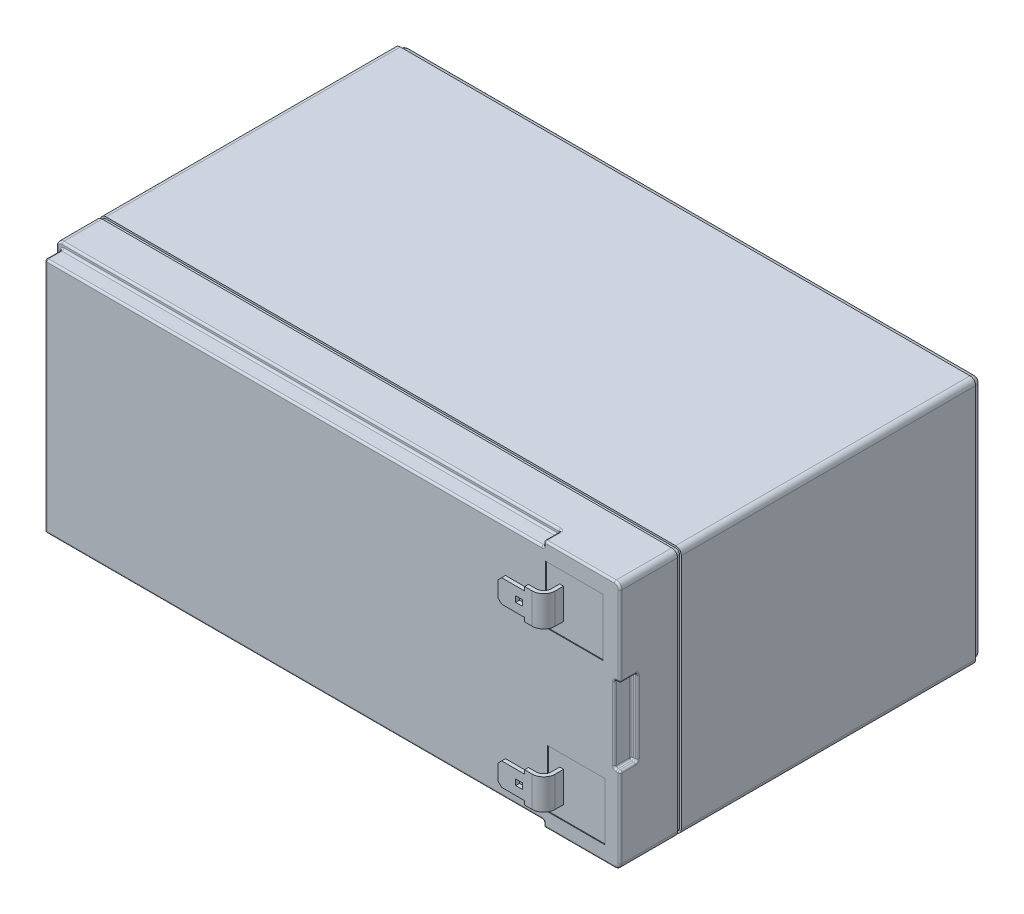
ISO-10303-21;
HEADER;
FILE_DESCRIPTION(('STEP AP214'),'2;1');
FILE_NAME('part.step','',(''),(''),'','','');
FILE_SCHEMA(('AUTOMOTIVE_DESIGN { 1 0 10303 214 1 1 1 1 }'));
ENDSEC;
DATA;
#1=APPLICATION_CONTEXT('core data for automotive mechanical design processes');
#2=APPLICATION_PROTOCOL_DEFINITION('international standard','automotive_design',2000,#1);
#3=PRODUCT_CONTEXT('',#1,'mechanical');
#4=PRODUCT('Part','Part','',(#3));
#5=PRODUCT_RELATED_PRODUCT_CATEGORY('part','',(#4));
#6=PRODUCT_DEFINITION_FORMATION('','',#4);
#7=PRODUCT_DEFINITION_CONTEXT('part definition',#1,'design');
#8=PRODUCT_DEFINITION('design','',#6,#7);
#9=PRODUCT_DEFINITION_SHAPE('','',#8);
#10=(LENGTH_UNIT() NAMED_UNIT(*) SI_UNIT(.MILLI.,.METRE.));
#11=(NAMED_UNIT(*) PLANE_ANGLE_UNIT() SI_UNIT($,.RADIAN.));
#12=(NAMED_UNIT(*) SI_UNIT($,.STERADIAN.) SOLID_ANGLE_UNIT());
#13=UNCERTAINTY_MEASURE_WITH_UNIT(LENGTH_MEASURE(1.E-05),#10,'distance_accuracy_value','');
#14=(GEOMETRIC_REPRESENTATION_CONTEXT(3) GLOBAL_UNCERTAINTY_ASSIGNED_CONTEXT((#13)) GLOBAL_UNIT_ASSIGNED_CONTEXT((#10,
#11,#12)) REPRESENTATION_CONTEXT('',''));
#15=CARTESIAN_POINT('',(0.,0.,0.));
#16=DIRECTION('',(0.,0.,1.));
#17=DIRECTION('',(1.,0.,0.));
#18=AXIS2_PLACEMENT_3D('',#15,#16,#17);
#19=CARTESIAN_POINT('',(147.5,45.5,94.8));
#20=DIRECTION('',(0.,0.,-1.));
#21=DIRECTION('',(-1.,0.,0.));
#22=AXIS2_PLACEMENT_3D('',#19,#20,#21);
#23=PLANE('',#22);
#24=DIRECTION('',(0.,1.,0.));
#25=VECTOR('',#24,1.);
#26=CARTESIAN_POINT('',(147.5,60.5,94.8));
#27=LINE('',#26,#25);
#28=CARTESIAN_POINT('',(147.5,45.5,94.8));
#29=VERTEX_POINT('',#28);
#30=CARTESIAN_POINT('',(147.5,60.5,94.8));
#31=VERTEX_POINT('',#30);
#32=EDGE_CURVE('E1032',#29,#31,#27,.T.);
#33=ORIENTED_EDGE('',*,*,#32,.T.);
#34=DIRECTION('',(-1.,0.,0.));
#35=VECTOR('',#34,1.);
#36=CARTESIAN_POINT('',(147.5,60.5,94.8));
#37=LINE('',#36,#35);
#38=CARTESIAN_POINT('',(132.5,60.5,94.8));
#39=VERTEX_POINT('',#38);
#40=EDGE_CURVE('E1035',#31,#39,#37,.T.);
#41=ORIENTED_EDGE('',*,*,#40,.T.);
#42=DIRECTION('',(0.,-1.,0.));
#43=VECTOR('',#42,1.);
#44=CARTESIAN_POINT('',(132.5,60.5,94.8));
#45=LINE('',#44,#43);
#46=CARTESIAN_POINT('',(132.5,45.5,94.8));
#47=VERTEX_POINT('',#46);
#48=EDGE_CURVE('E1038',#39,#47,#45,.T.);
#49=ORIENTED_EDGE('',*,*,#48,.T.);
#50=DIRECTION('',(1.,0.,0.));
#51=VECTOR('',#50,1.);
#52=CARTESIAN_POINT('',(147.5,45.5,94.8));
#53=LINE('',#52,#51);
#54=EDGE_CURVE('E1041',#47,#29,#53,.T.);
#55=ORIENTED_EDGE('',*,*,#54,.T.);
#56=EDGE_LOOP('',(#33,#41,#49,#55));
#57=FACE_BOUND('',#56,.T.);
#58=DIRECTION('',(0.,1.,0.));
#59=VECTOR('',#58,1.);
#60=CARTESIAN_POINT('',(137.,57.,94.8));
#61=LINE('',#60,#59);
#62=CARTESIAN_POINT('',(137.,49.,94.8));
#63=VERTEX_POINT('',#62);
#64=CARTESIAN_POINT('',(137.,57.,94.8));
#65=VERTEX_POINT('',#64);
#66=EDGE_CURVE('E829',#63,#65,#61,.T.);
#67=ORIENTED_EDGE('',*,*,#66,.F.);
#68=DIRECTION('',(1.,0.,0.));
#69=VECTOR('',#68,1.);
#70=CARTESIAN_POINT('',(137.,49.,94.8));
#71=LINE('',#70,#69);
#72=CARTESIAN_POINT('',(136.,49.,94.8));
#73=VERTEX_POINT('',#72);
#74=EDGE_CURVE('E839',#73,#63,#71,.T.);
#75=ORIENTED_EDGE('',*,*,#74,.F.);
#76=DIRECTION('',(0.,-1.,0.));
#77=VECTOR('',#76,1.);
#78=CARTESIAN_POINT('',(136.,57.,94.8));
#79=LINE('',#78,#77);
#80=CARTESIAN_POINT('',(136.,57.,94.8));
#81=VERTEX_POINT('',#80);
#82=EDGE_CURVE('E836',#81,#73,#79,.T.);
#83=ORIENTED_EDGE('',*,*,#82,.F.);
#84=DIRECTION('',(-1.,0.,0.));
#85=VECTOR('',#84,1.);
#86=CARTESIAN_POINT('',(137.,57.,94.8));
#87=LINE('',#86,#85);
#88=EDGE_CURVE('E833',#65,#81,#87,.T.);
#89=ORIENTED_EDGE('',*,*,#88,.F.);
#90=EDGE_LOOP('',(#67,#75,#83,#89));
#91=FACE_BOUND('',#90,.T.);
#92=ADVANCED_FACE('F36',(#57,#91),#23,.F.);
#93=CARTESIAN_POINT('',(148.,4.,94.8));
#94=DIRECTION('',(0.,0.,1.));
#95=DIRECTION('',(1.,0.,0.));
#96=AXIS2_PLACEMENT_3D('',#93,#94,#95);
#97=PLANE('',#96);
#98=DIRECTION('',(0.,1.,0.));
#99=VECTOR('',#98,1.);
#100=CARTESIAN_POINT('',(148.,4.,94.8));
#101=LINE('',#100,#99);
#102=CARTESIAN_POINT('',(148.,4.,94.8));
#103=VERTEX_POINT('',#102);
#104=CARTESIAN_POINT('',(148.,19.,94.8));
#105=VERTEX_POINT('',#104);
#106=EDGE_CURVE('E1064',#103,#105,#101,.T.);
#107=ORIENTED_EDGE('',*,*,#106,.T.);
#108=DIRECTION('',(-1.,0.,0.));
#109=VECTOR('',#108,1.);
#110=CARTESIAN_POINT('',(148.,19.,94.8));
#111=LINE('',#110,#109);
#112=CARTESIAN_POINT('',(133.,19.,94.8));
#113=VERTEX_POINT('',#112);
#114=EDGE_CURVE('E1067',#105,#113,#111,.T.);
#115=ORIENTED_EDGE('',*,*,#114,.T.);
#116=DIRECTION('',(0.,-1.,0.));
#117=VECTOR('',#116,1.);
#118=CARTESIAN_POINT('',(133.,4.,94.8));
#119=LINE('',#118,#117);
#120=CARTESIAN_POINT('',(133.,4.,94.8));
#121=VERTEX_POINT('',#120);
#122=EDGE_CURVE('E1070',#113,#121,#119,.T.);
#123=ORIENTED_EDGE('',*,*,#122,.T.);
#124=DIRECTION('',(1.,0.,0.));
#125=VECTOR('',#124,1.);
#126=CARTESIAN_POINT('',(148.,4.,94.8));
#127=LINE('',#126,#125);
#128=EDGE_CURVE('E1073',#121,#103,#127,.T.);
#129=ORIENTED_EDGE('',*,*,#128,.T.);
#130=EDGE_LOOP('',(#107,#115,#123,#129));
#131=FACE_BOUND('',#130,.T.);
#132=DIRECTION('',(-1.,0.,0.));
#133=VECTOR('',#132,1.);
#134=CARTESIAN_POINT('',(137.,15.5,94.8));
#135=LINE('',#134,#133);
#136=CARTESIAN_POINT('',(137.,15.5,94.8));
#137=VERTEX_POINT('',#136);
#138=CARTESIAN_POINT('',(136.,15.5,94.8));
#139=VERTEX_POINT('',#138);
#140=EDGE_CURVE('E962',#137,#139,#135,.T.);
#141=ORIENTED_EDGE('',*,*,#140,.F.);
#142=DIRECTION('',(0.,1.,0.));
#143=VECTOR('',#142,1.);
#144=CARTESIAN_POINT('',(137.,15.5,94.8));
#145=LINE('',#144,#143);
#146=CARTESIAN_POINT('',(137.,7.5,94.8));
#147=VERTEX_POINT('',#146);
#148=EDGE_CURVE('E958',#147,#137,#145,.T.);
#149=ORIENTED_EDGE('',*,*,#148,.F.);
#150=DIRECTION('',(1.,0.,0.));
#151=VECTOR('',#150,1.);
#152=CARTESIAN_POINT('',(137.,7.5,94.8));
#153=LINE('',#152,#151);
#154=CARTESIAN_POINT('',(136.,7.5,94.8));
#155=VERTEX_POINT('',#154);
#156=EDGE_CURVE('E967',#155,#147,#153,.T.);
#157=ORIENTED_EDGE('',*,*,#156,.F.);
#158=DIRECTION('',(0.,-1.,0.));
#159=VECTOR('',#158,1.);
#160=CARTESIAN_POINT('',(136.,15.5,94.8));
#161=LINE('',#160,#159);
#162=EDGE_CURVE('E964',#139,#155,#161,.T.);
#163=ORIENTED_EDGE('',*,*,#162,.F.);
#164=EDGE_LOOP('',(#141,#149,#157,#163));
#165=FACE_BOUND('',#164,.T.);
#166=ADVANCED_FACE('F1790',(#131,#165),#97,.T.);
#167=CARTESIAN_POINT('',(1.5,63.5,95.));
#168=DIRECTION('',(0.,0.,-1.));
#169=DIRECTION('',(-1.,0.,0.));
#170=AXIS2_PLACEMENT_3D('',#167,#168,#169);
#171=CYLINDRICAL_SURFACE('',#170,1.5);
#172=DIRECTION('',(0.,0.,-1.));
#173=VECTOR('',#172,1.);
#174=CARTESIAN_POINT('',(0.,63.5,95.));
#175=LINE('',#174,#173);
#176=CARTESIAN_POINT('',(0.,63.5,90.));
#177=VERTEX_POINT('',#176);
#178=CARTESIAN_POINT('',(0.,63.5,80.));
#179=VERTEX_POINT('',#178);
#180=EDGE_CURVE('E1514',#177,#179,#175,.T.);
#181=ORIENTED_EDGE('',*,*,#180,.F.);
#182=CARTESIAN_POINT('',(1.5,63.5,90.));
#183=DIRECTION('',(0.,0.,1.));
#184=DIRECTION('',(1.,0.,0.));
#185=AXIS2_PLACEMENT_3D('',#182,#183,#184);
#186=CIRCLE('',#185,1.5);
#187=CARTESIAN_POINT('',(1.5,65.,90.));
#188=VERTEX_POINT('',#187);
#189=EDGE_CURVE('E1592',#177,#188,#186,.F.);
#190=ORIENTED_EDGE('',*,*,#189,.T.);
#191=DIRECTION('',(0.,0.,-1.));
#192=VECTOR('',#191,1.);
#193=CARTESIAN_POINT('',(1.5,65.,95.));
#194=LINE('',#193,#192);
#195=CARTESIAN_POINT('',(1.5,65.,80.));
#196=VERTEX_POINT('',#195);
#197=EDGE_CURVE('E1480',#196,#188,#194,.F.);
#198=ORIENTED_EDGE('',*,*,#197,.F.);
#199=CARTESIAN_POINT('',(1.5,63.5,80.));
#200=DIRECTION('',(0.,0.,1.));
#201=DIRECTION('',(1.,0.,0.));
#202=AXIS2_PLACEMENT_3D('',#199,#200,#201);
#203=CIRCLE('',#202,1.5);
#204=EDGE_CURVE('E1357',#196,#179,#203,.T.);
#205=ORIENTED_EDGE('',*,*,#204,.T.);
#206=EDGE_LOOP('',(#181,#190,#198,#205));
#207=FACE_BOUND('',#206,.T.);
#208=ADVANCED_FACE('F1796',(#207),#171,.T.);
#209=CARTESIAN_POINT('',(1.5,1.5,95.));
#210=DIRECTION('',(0.,0.,-1.));
#211=DIRECTION('',(-1.,0.,0.));
#212=AXIS2_PLACEMENT_3D('',#209,#210,#211);
#213=CYLINDRICAL_SURFACE('',#212,1.5);
#214=DIRECTION('',(0.,0.,-1.));
#215=VECTOR('',#214,1.);
#216=CARTESIAN_POINT('',(1.5,0.,95.));
#217=LINE('',#216,#215);
#218=CARTESIAN_POINT('',(1.5,0.,90.));
#219=VERTEX_POINT('',#218);
#220=CARTESIAN_POINT('',(1.5,0.,80.));
#221=VERTEX_POINT('',#220);
#222=EDGE_CURVE('E1503',#219,#221,#217,.T.);
#223=ORIENTED_EDGE('',*,*,#222,.F.);
#224=CARTESIAN_POINT('',(1.5,1.5,90.));
#225=DIRECTION('',(0.,0.,1.));
#226=DIRECTION('',(1.,0.,0.));
#227=AXIS2_PLACEMENT_3D('',#224,#225,#226);
#228=CIRCLE('',#227,1.5);
#229=CARTESIAN_POINT('',(0.,1.5,90.));
#230=VERTEX_POINT('',#229);
#231=EDGE_CURVE('E1588',#219,#230,#228,.F.);
#232=ORIENTED_EDGE('',*,*,#231,.T.);
#233=DIRECTION('',(0.,0.,-1.));
#234=VECTOR('',#233,1.);
#235=CARTESIAN_POINT('',(0.,1.5,95.));
#236=LINE('',#235,#234);
#237=CARTESIAN_POINT('',(0.,1.5,80.));
#238=VERTEX_POINT('',#237);
#239=EDGE_CURVE('E1509',#238,#230,#236,.F.);
#240=ORIENTED_EDGE('',*,*,#239,.F.);
#241=CARTESIAN_POINT('',(1.5,1.5,80.));
#242=DIRECTION('',(0.,0.,1.));
#243=DIRECTION('',(1.,0.,0.));
#244=AXIS2_PLACEMENT_3D('',#241,#242,#243);
#245=CIRCLE('',#244,1.5);
#246=EDGE_CURVE('E1363',#238,#221,#245,.T.);
#247=ORIENTED_EDGE('',*,*,#246,.T.);
#248=EDGE_LOOP('',(#223,#232,#240,#247));
#249=FACE_BOUND('',#248,.T.);
#250=ADVANCED_FACE('F2151',(#249),#213,.T.);
#251=CARTESIAN_POINT('',(0.,0.,95.));
#252=DIRECTION('',(1.,0.,0.));
#253=DIRECTION('',(0.,0.,-1.));
#254=AXIS2_PLACEMENT_3D('',#251,#252,#253);
#255=PLANE('',#254);
#256=ORIENTED_EDGE('',*,*,#239,.T.);
#257=DIRECTION('',(0.,-1.,0.));
#258=VECTOR('',#257,1.);
#259=CARTESIAN_POINT('',(0.,63.5,90.));
#260=LINE('',#259,#258);
#261=EDGE_CURVE('E1590',#230,#177,#260,.F.);
#262=ORIENTED_EDGE('',*,*,#261,.T.);
#263=ORIENTED_EDGE('',*,*,#180,.T.);
#264=DIRECTION('',(0.,-1.,0.));
#265=VECTOR('',#264,1.);
#266=CARTESIAN_POINT('',(0.,63.5,80.));
#267=LINE('',#266,#265);
#268=EDGE_CURVE('E1360',#179,#238,#267,.T.);
#269=ORIENTED_EDGE('',*,*,#268,.T.);
#270=EDGE_LOOP('',(#256,#262,#263,#269));
#271=FACE_BOUND('',#270,.T.);
#272=ADVANCED_FACE('F38',(#271),#255,.F.);
#273=DIRECTION('',(0.,-1.,0.));
#274=VECTOR('',#273,1.);
#275=CARTESIAN_POINT('',(0.,63.5,79.));
#276=LINE('',#275,#274);
#277=CARTESIAN_POINT('',(0.,63.5,79.));
#278=VERTEX_POINT('',#277);
#279=CARTESIAN_POINT('',(0.,1.5,79.));
#280=VERTEX_POINT('',#279);
#281=EDGE_CURVE('E1380',#278,#280,#276,.T.);
#282=ORIENTED_EDGE('',*,*,#281,.F.);
#283=CARTESIAN_POINT('',(0.,63.5,2.));
#284=VERTEX_POINT('',#283);
#285=EDGE_CURVE('E1513',#278,#284,#175,.T.);
#286=ORIENTED_EDGE('',*,*,#285,.T.);
#287=DIRECTION('',(0.,1.,0.));
#288=VECTOR('',#287,1.);
#289=CARTESIAN_POINT('',(0.,0.,2.));
#290=LINE('',#289,#288);
#291=CARTESIAN_POINT('',(0.,1.5,2.));
#292=VERTEX_POINT('',#291);
#293=EDGE_CURVE('E1411',#292,#284,#290,.T.);
#294=ORIENTED_EDGE('',*,*,#293,.F.);
#295=EDGE_CURVE('E1510',#292,#280,#236,.F.);
#296=ORIENTED_EDGE('',*,*,#295,.T.);
#297=EDGE_LOOP('',(#282,#286,#294,#296));
#298=FACE_BOUND('',#297,.T.);
#299=ADVANCED_FACE('F2259',(#298),#255,.F.);
#300=CARTESIAN_POINT('',(0.,0.,95.));
#301=DIRECTION('',(0.,1.,0.));
#302=DIRECTION('',(0.,0.,1.));
#303=AXIS2_PLACEMENT_3D('',#300,#301,#302);
#304=PLANE('',#303);
#305=DIRECTION('',(1.,0.,0.));
#306=VECTOR('',#305,1.);
#307=CARTESIAN_POINT('',(1.5,0.,79.));
#308=LINE('',#307,#306);
#309=CARTESIAN_POINT('',(1.5,0.,79.));
#310=VERTEX_POINT('',#309);
#311=CARTESIAN_POINT('',(150.5,0.,79.));
#312=VERTEX_POINT('',#311);
#313=EDGE_CURVE('E1384',#310,#312,#308,.T.);
#314=ORIENTED_EDGE('',*,*,#313,.F.);
#315=CARTESIAN_POINT('',(1.5,0.,2.));
#316=VERTEX_POINT('',#315);
#317=EDGE_CURVE('E1502',#310,#316,#217,.T.);
#318=ORIENTED_EDGE('',*,*,#317,.T.);
#319=DIRECTION('',(-1.,0.,0.));
#320=VECTOR('',#319,1.);
#321=CARTESIAN_POINT('',(152.,0.,2.));
#322=LINE('',#321,#320);
#323=CARTESIAN_POINT('',(150.5,0.,2.));
#324=VERTEX_POINT('',#323);
#325=EDGE_CURVE('E1408',#324,#316,#322,.T.);
#326=ORIENTED_EDGE('',*,*,#325,.F.);
#327=DIRECTION('',(0.,0.,-1.));
#328=VECTOR('',#327,1.);
#329=CARTESIAN_POINT('',(150.5,0.,95.));
#330=LINE('',#329,#328);
#331=EDGE_CURVE('E1506',#324,#312,#330,.F.);
#332=ORIENTED_EDGE('',*,*,#331,.T.);
#333=EDGE_LOOP('',(#314,#318,#326,#332));
#334=FACE_BOUND('',#333,.T.);
#335=ADVANCED_FACE('F2255',(#334),#304,.F.);
#336=CARTESIAN_POINT('',(152.,0.,95.));
#337=DIRECTION('',(-1.,0.,0.));
#338=DIRECTION('',(0.,0.,1.));
#339=AXIS2_PLACEMENT_3D('',#336,#337,#338);
#340=PLANE('',#339);
#341=DIRECTION('',(0.,1.,0.));
#342=VECTOR('',#341,1.);
#343=CARTESIAN_POINT('',(152.,1.5,79.));
#344=LINE('',#343,#342);
#345=CARTESIAN_POINT('',(152.,1.5,79.));
#346=VERTEX_POINT('',#345);
#347=CARTESIAN_POINT('',(152.,63.5,79.));
#348=VERTEX_POINT('',#347);
#349=EDGE_CURVE('E1372',#346,#348,#344,.T.);
#350=ORIENTED_EDGE('',*,*,#349,.F.);
#351=DIRECTION('',(0.,0.,-1.));
#352=VECTOR('',#351,1.);
#353=CARTESIAN_POINT('',(152.,1.5,95.));
#354=LINE('',#353,#352);
#355=CARTESIAN_POINT('',(152.,1.5,2.));
#356=VERTEX_POINT('',#355);
#357=EDGE_CURVE('E1495',#346,#356,#354,.T.);
#358=ORIENTED_EDGE('',*,*,#357,.T.);
#359=DIRECTION('',(0.,-1.,0.));
#360=VECTOR('',#359,1.);
#361=CARTESIAN_POINT('',(152.,65.,2.));
#362=LINE('',#361,#360);
#363=CARTESIAN_POINT('',(152.,63.5,2.));
#364=VERTEX_POINT('',#363);
#365=EDGE_CURVE('E1417',#364,#356,#362,.T.);
#366=ORIENTED_EDGE('',*,*,#365,.F.);
#367=DIRECTION('',(0.,0.,-1.));
#368=VECTOR('',#367,1.);
#369=CARTESIAN_POINT('',(152.,63.5,95.));
#370=LINE('',#369,#368);
#371=EDGE_CURVE('E1499',#364,#348,#370,.F.);
#372=ORIENTED_EDGE('',*,*,#371,.T.);
#373=EDGE_LOOP('',(#350,#358,#366,#372));
#374=FACE_BOUND('',#373,.T.);
#375=ADVANCED_FACE('F2252',(#374),#340,.F.);
#376=CARTESIAN_POINT('',(0.,65.,95.));
#377=DIRECTION('',(0.,-1.,0.));
#378=DIRECTION('',(0.,0.,-1.));
#379=AXIS2_PLACEMENT_3D('',#376,#377,#378);
#380=PLANE('',#379);
#381=DIRECTION('',(-1.,0.,0.));
#382=VECTOR('',#381,1.);
#383=CARTESIAN_POINT('',(150.5,65.,79.));
#384=LINE('',#383,#382);
#385=CARTESIAN_POINT('',(150.5,65.,79.));
#386=VERTEX_POINT('',#385);
#387=CARTESIAN_POINT('',(1.5,65.,79.));
#388=VERTEX_POINT('',#387);
#389=EDGE_CURVE('E1376',#386,#388,#384,.T.);
#390=ORIENTED_EDGE('',*,*,#389,.F.);
#391=DIRECTION('',(0.,0.,-1.));
#392=VECTOR('',#391,1.);
#393=CARTESIAN_POINT('',(150.5,65.,95.));
#394=LINE('',#393,#392);
#395=CARTESIAN_POINT('',(150.5,65.,2.));
#396=VERTEX_POINT('',#395);
#397=EDGE_CURVE('E1484',#386,#396,#394,.T.);
#398=ORIENTED_EDGE('',*,*,#397,.T.);
#399=DIRECTION('',(1.,0.,0.));
#400=VECTOR('',#399,1.);
#401=CARTESIAN_POINT('',(0.,65.,2.));
#402=LINE('',#401,#400);
#403=CARTESIAN_POINT('',(1.5,65.,2.));
#404=VERTEX_POINT('',#403);
#405=EDGE_CURVE('E1414',#404,#396,#402,.T.);
#406=ORIENTED_EDGE('',*,*,#405,.F.);
#407=EDGE_CURVE('E1481',#404,#388,#194,.F.);
#408=ORIENTED_EDGE('',*,*,#407,.T.);
#409=EDGE_LOOP('',(#390,#398,#406,#408));
#410=FACE_BOUND('',#409,.T.);
#411=ADVANCED_FACE('F2249',(#410),#380,.F.);
#412=CARTESIAN_POINT('',(150.5,63.5,95.));
#413=DIRECTION('',(0.,0.,-1.));
#414=DIRECTION('',(-1.,0.,0.));
#415=AXIS2_PLACEMENT_3D('',#412,#413,#414);
#416=CYLINDRICAL_SURFACE('',#415,1.5);
#417=ORIENTED_EDGE('',*,*,#397,.F.);
#418=CARTESIAN_POINT('',(150.5,63.5,79.));
#419=DIRECTION('',(0.,0.,1.));
#420=DIRECTION('',(1.,0.,0.));
#421=AXIS2_PLACEMENT_3D('',#418,#419,#420);
#422=CIRCLE('',#421,1.5);
#423=EDGE_CURVE('E1374',#348,#386,#422,.T.);
#424=ORIENTED_EDGE('',*,*,#423,.F.);
#425=ORIENTED_EDGE('',*,*,#371,.F.);
#426=CARTESIAN_POINT('',(150.5,63.5,2.));
#427=DIRECTION('',(0.,0.,-1.));
#428=DIRECTION('',(-1.,0.,0.));
#429=AXIS2_PLACEMENT_3D('',#426,#427,#428);
#430=CIRCLE('',#429,1.5);
#431=EDGE_CURVE('E1493',#396,#364,#430,.T.);
#432=ORIENTED_EDGE('',*,*,#431,.F.);
#433=EDGE_LOOP('',(#417,#424,#425,#432));
#434=FACE_BOUND('',#433,.T.);
#435=ADVANCED_FACE('F2171',(#434),#416,.T.);
#436=CARTESIAN_POINT('',(150.5,1.5,95.));
#437=DIRECTION('',(0.,0.,-1.));
#438=DIRECTION('',(-1.,0.,0.));
#439=AXIS2_PLACEMENT_3D('',#436,#437,#438);
#440=CYLINDRICAL_SURFACE('',#439,1.5);
#441=ORIENTED_EDGE('',*,*,#357,.F.);
#442=CARTESIAN_POINT('',(150.5,1.5,79.));
#443=DIRECTION('',(0.,0.,1.));
#444=DIRECTION('',(1.,0.,0.));
#445=AXIS2_PLACEMENT_3D('',#442,#443,#444);
#446=CIRCLE('',#445,1.5);
#447=EDGE_CURVE('E1370',#312,#346,#446,.T.);
#448=ORIENTED_EDGE('',*,*,#447,.F.);
#449=ORIENTED_EDGE('',*,*,#331,.F.);
#450=CARTESIAN_POINT('',(150.5,1.5,2.));
#451=DIRECTION('',(0.,0.,-1.));
#452=DIRECTION('',(-1.,0.,0.));
#453=AXIS2_PLACEMENT_3D('',#450,#451,#452);
#454=CIRCLE('',#453,1.5);
#455=EDGE_CURVE('E1491',#356,#324,#454,.T.);
#456=ORIENTED_EDGE('',*,*,#455,.F.);
#457=EDGE_LOOP('',(#441,#448,#449,#456));
#458=FACE_BOUND('',#457,.T.);
#459=ADVANCED_FACE('F2166',(#458),#440,.T.);
#460=ORIENTED_EDGE('',*,*,#285,.F.);
#461=CARTESIAN_POINT('',(1.5,63.5,79.));
#462=DIRECTION('',(0.,0.,1.));
#463=DIRECTION('',(1.,0.,0.));
#464=AXIS2_PLACEMENT_3D('',#461,#462,#463);
#465=CIRCLE('',#464,1.5);
#466=EDGE_CURVE('E1378',#388,#278,#465,.T.);
#467=ORIENTED_EDGE('',*,*,#466,.F.);
#468=ORIENTED_EDGE('',*,*,#407,.F.);
#469=CARTESIAN_POINT('',(1.5,63.5,2.));
#470=DIRECTION('',(0.,0.,-1.));
#471=DIRECTION('',(-1.,0.,0.));
#472=AXIS2_PLACEMENT_3D('',#469,#470,#471);
#473=CIRCLE('',#472,1.5);
#474=EDGE_CURVE('E1489',#284,#404,#473,.T.);
#475=ORIENTED_EDGE('',*,*,#474,.F.);
#476=EDGE_LOOP('',(#460,#467,#468,#475));
#477=FACE_BOUND('',#476,.T.);
#478=ADVANCED_FACE('F2159',(#477),#171,.T.);
#479=ORIENTED_EDGE('',*,*,#317,.F.);
#480=CARTESIAN_POINT('',(1.5,1.5,79.));
#481=DIRECTION('',(0.,0.,1.));
#482=DIRECTION('',(1.,0.,0.));
#483=AXIS2_PLACEMENT_3D('',#480,#481,#482);
#484=CIRCLE('',#483,1.5);
#485=EDGE_CURVE('E1382',#280,#310,#484,.T.);
#486=ORIENTED_EDGE('',*,*,#485,.F.);
#487=ORIENTED_EDGE('',*,*,#295,.F.);
#488=CARTESIAN_POINT('',(1.5,1.5,2.));
#489=DIRECTION('',(0.,0.,-1.));
#490=DIRECTION('',(-1.,0.,0.));
#491=AXIS2_PLACEMENT_3D('',#488,#489,#490);
#492=CIRCLE('',#491,1.5);
#493=EDGE_CURVE('E1487',#316,#292,#492,.T.);
#494=ORIENTED_EDGE('',*,*,#493,.F.);
#495=EDGE_LOOP('',(#479,#486,#487,#494));
#496=FACE_BOUND('',#495,.T.);
#497=ADVANCED_FACE('F2155',(#496),#213,.T.);
#498=CARTESIAN_POINT('',(0.,0.,2.));
#499=DIRECTION('',(0.,0.,-1.));
#500=DIRECTION('',(-1.,0.,0.));
#501=AXIS2_PLACEMENT_3D('',#498,#499,#500);
#502=PLANE('',#501);
#503=DIRECTION('',(0.,-1.,0.));
#504=VECTOR('',#503,1.);
#505=CARTESIAN_POINT('',(151.5,64.5,2.));
#506=LINE('',#505,#504);
#507=CARTESIAN_POINT('',(151.5,63.,2.));
#508=VERTEX_POINT('',#507);
#509=CARTESIAN_POINT('',(151.5,2.,2.));
#510=VERTEX_POINT('',#509);
#511=EDGE_CURVE('E1405',#508,#510,#506,.T.);
#512=ORIENTED_EDGE('',*,*,#511,.F.);
#513=CARTESIAN_POINT('',(150.,63.,2.));
#514=DIRECTION('',(0.,0.,-1.));
#515=DIRECTION('',(-1.,0.,0.));
#516=AXIS2_PLACEMENT_3D('',#513,#514,#515);
#517=CIRCLE('',#516,1.5);
#518=CARTESIAN_POINT('',(150.,64.5,2.));
#519=VERTEX_POINT('',#518);
#520=EDGE_CURVE('E1522',#508,#519,#517,.F.);
#521=ORIENTED_EDGE('',*,*,#520,.T.);
#522=DIRECTION('',(1.,0.,0.));
#523=VECTOR('',#522,1.);
#524=CARTESIAN_POINT('',(0.5,64.5,2.));
#525=LINE('',#524,#523);
#526=CARTESIAN_POINT('',(2.,64.5,2.));
#527=VERTEX_POINT('',#526);
#528=EDGE_CURVE('E1402',#527,#519,#525,.T.);
#529=ORIENTED_EDGE('',*,*,#528,.F.);
#530=CARTESIAN_POINT('',(2.,63.,2.));
#531=DIRECTION('',(0.,0.,-1.));
#532=DIRECTION('',(-1.,0.,0.));
#533=AXIS2_PLACEMENT_3D('',#530,#531,#532);
#534=CIRCLE('',#533,1.5);
#535=CARTESIAN_POINT('',(0.5,63.,2.));
#536=VERTEX_POINT('',#535);
#537=EDGE_CURVE('E1516',#527,#536,#534,.F.);
#538=ORIENTED_EDGE('',*,*,#537,.T.);
#539=DIRECTION('',(0.,1.,0.));
#540=VECTOR('',#539,1.);
#541=CARTESIAN_POINT('',(0.5,0.5,2.));
#542=LINE('',#541,#540);
#543=CARTESIAN_POINT('',(0.5,2.,2.));
#544=VERTEX_POINT('',#543);
#545=EDGE_CURVE('E1399',#544,#536,#542,.T.);
#546=ORIENTED_EDGE('',*,*,#545,.F.);
#547=CARTESIAN_POINT('',(2.,2.,2.));
#548=DIRECTION('',(0.,0.,-1.));
#549=DIRECTION('',(-1.,0.,0.));
#550=AXIS2_PLACEMENT_3D('',#547,#548,#549);
#551=CIRCLE('',#550,1.5);
#552=CARTESIAN_POINT('',(2.,0.5,2.));
#553=VERTEX_POINT('',#552);
#554=EDGE_CURVE('E1518',#544,#553,#551,.F.);
#555=ORIENTED_EDGE('',*,*,#554,.T.);
#556=DIRECTION('',(-1.,0.,0.));
#557=VECTOR('',#556,1.);
#558=CARTESIAN_POINT('',(151.5,0.5,2.));
#559=LINE('',#558,#557);
#560=CARTESIAN_POINT('',(150.,0.5,2.));
#561=VERTEX_POINT('',#560);
#562=EDGE_CURVE('E1396',#561,#553,#559,.T.);
#563=ORIENTED_EDGE('',*,*,#562,.F.);
#564=CARTESIAN_POINT('',(150.,2.,2.));
#565=DIRECTION('',(0.,0.,-1.));
#566=DIRECTION('',(-1.,0.,0.));
#567=AXIS2_PLACEMENT_3D('',#564,#565,#566);
#568=CIRCLE('',#567,1.5);
#569=EDGE_CURVE('E1520',#561,#510,#568,.F.);
#570=ORIENTED_EDGE('',*,*,#569,.T.);
#571=EDGE_LOOP('',(#512,#521,#529,#538,#546,#555,#563,#570));
#572=FACE_BOUND('',#571,.T.);
#573=ORIENTED_EDGE('',*,*,#405,.T.);
#574=ORIENTED_EDGE('',*,*,#431,.T.);
#575=ORIENTED_EDGE('',*,*,#365,.T.);
#576=ORIENTED_EDGE('',*,*,#455,.T.);
#577=ORIENTED_EDGE('',*,*,#325,.T.);
#578=ORIENTED_EDGE('',*,*,#493,.T.);
#579=ORIENTED_EDGE('',*,*,#293,.T.);
#580=ORIENTED_EDGE('',*,*,#474,.T.);
#581=EDGE_LOOP('',(#573,#574,#575,#576,#577,#578,#579,#580));
#582=FACE_BOUND('',#581,.T.);
#583=ADVANCED_FACE('F2235',(#572,#582),#502,.T.);
#584=CARTESIAN_POINT('',(151.5,0.5,2.));
#585=DIRECTION('',(0.,-1.,0.));
#586=DIRECTION('',(0.,0.,-1.));
#587=AXIS2_PLACEMENT_3D('',#584,#585,#586);
#588=PLANE('',#587);
#589=ORIENTED_EDGE('',*,*,#562,.T.);
#590=DIRECTION('',(0.,0.,-1.));
#591=VECTOR('',#590,1.);
#592=CARTESIAN_POINT('',(2.,0.5,2.));
#593=LINE('',#592,#591);
#594=CARTESIAN_POINT('',(2.,0.5,1.5));
#595=VERTEX_POINT('',#594);
#596=EDGE_CURVE('E1474',#553,#595,#593,.T.);
#597=ORIENTED_EDGE('',*,*,#596,.T.);
#598=DIRECTION('',(-1.,0.,0.));
#599=VECTOR('',#598,1.);
#600=CARTESIAN_POINT('',(151.5,0.5,1.5));
#601=LINE('',#600,#599);
#602=CARTESIAN_POINT('',(150.,0.5,1.5));
#603=VERTEX_POINT('',#602);
#604=EDGE_CURVE('E1438',#595,#603,#601,.F.);
#605=ORIENTED_EDGE('',*,*,#604,.T.);
#606=DIRECTION('',(0.,0.,-1.));
#607=VECTOR('',#606,1.);
#608=CARTESIAN_POINT('',(150.,0.5,2.));
#609=LINE('',#608,#607);
#610=EDGE_CURVE('E1472',#603,#561,#609,.F.);
#611=ORIENTED_EDGE('',*,*,#610,.T.);
#612=EDGE_LOOP('',(#589,#597,#605,#611));
#613=FACE_BOUND('',#612,.T.);
#614=ADVANCED_FACE('F2224',(#613),#588,.T.);
#615=CARTESIAN_POINT('',(151.5,64.5,2.));
#616=DIRECTION('',(1.,0.,0.));
#617=DIRECTION('',(0.,0.,-1.));
#618=AXIS2_PLACEMENT_3D('',#615,#616,#617);
#619=PLANE('',#618);
#620=ORIENTED_EDGE('',*,*,#511,.T.);
#621=DIRECTION('',(0.,0.,-1.));
#622=VECTOR('',#621,1.);
#623=CARTESIAN_POINT('',(151.5,2.,2.));
#624=LINE('',#623,#622);
#625=CARTESIAN_POINT('',(151.5,2.,1.5));
#626=VERTEX_POINT('',#625);
#627=EDGE_CURVE('E1478',#510,#626,#624,.T.);
#628=ORIENTED_EDGE('',*,*,#627,.T.);
#629=DIRECTION('',(0.,-1.,0.));
#630=VECTOR('',#629,1.);
#631=CARTESIAN_POINT('',(151.5,64.5,1.5));
#632=LINE('',#631,#630);
#633=CARTESIAN_POINT('',(151.5,63.,1.5));
#634=VERTEX_POINT('',#633);
#635=EDGE_CURVE('E1441',#626,#634,#632,.F.);
#636=ORIENTED_EDGE('',*,*,#635,.T.);
#637=DIRECTION('',(0.,0.,-1.));
#638=VECTOR('',#637,1.);
#639=CARTESIAN_POINT('',(151.5,63.,2.));
#640=LINE('',#639,#638);
#641=EDGE_CURVE('E1476',#634,#508,#640,.F.);
#642=ORIENTED_EDGE('',*,*,#641,.T.);
#643=EDGE_LOOP('',(#620,#628,#636,#642));
#644=FACE_BOUND('',#643,.T.);
#645=ADVANCED_FACE('F2220',(#644),#619,.T.);
#646=CARTESIAN_POINT('',(0.5,64.5,2.));
#647=DIRECTION('',(0.,1.,0.));
#648=DIRECTION('',(0.,0.,1.));
#649=AXIS2_PLACEMENT_3D('',#646,#647,#648);
#650=PLANE('',#649);
#651=DIRECTION('',(1.,0.,0.));
#652=VECTOR('',#651,1.);
#653=CARTESIAN_POINT('',(0.5,64.5,1.5));
#654=LINE('',#653,#652);
#655=CARTESIAN_POINT('',(150.,64.5,1.5));
#656=VERTEX_POINT('',#655);
#657=CARTESIAN_POINT('',(2.,64.5,1.5));
#658=VERTEX_POINT('',#657);
#659=EDGE_CURVE('E1432',#656,#658,#654,.F.);
#660=ORIENTED_EDGE('',*,*,#659,.T.);
#661=DIRECTION('',(0.,0.,-1.));
#662=VECTOR('',#661,1.);
#663=CARTESIAN_POINT('',(2.,64.5,2.));
#664=LINE('',#663,#662);
#665=EDGE_CURVE('E1470',#658,#527,#664,.F.);
#666=ORIENTED_EDGE('',*,*,#665,.T.);
#667=ORIENTED_EDGE('',*,*,#528,.T.);
#668=DIRECTION('',(0.,0.,-1.));
#669=VECTOR('',#668,1.);
#670=CARTESIAN_POINT('',(150.,64.5,2.));
#671=LINE('',#670,#669);
#672=EDGE_CURVE('E1468',#519,#656,#671,.T.);
#673=ORIENTED_EDGE('',*,*,#672,.T.);
#674=EDGE_LOOP('',(#660,#666,#667,#673));
#675=FACE_BOUND('',#674,.T.);
#676=ADVANCED_FACE('F2223',(#675),#650,.T.);
#677=CARTESIAN_POINT('',(0.5,0.5,2.));
#678=DIRECTION('',(-1.,0.,0.));
#679=DIRECTION('',(0.,0.,1.));
#680=AXIS2_PLACEMENT_3D('',#677,#678,#679);
#681=PLANE('',#680);
#682=ORIENTED_EDGE('',*,*,#545,.T.);
#683=DIRECTION('',(0.,0.,-1.));
#684=VECTOR('',#683,1.);
#685=CARTESIAN_POINT('',(0.5,63.,2.));
#686=LINE('',#685,#684);
#687=CARTESIAN_POINT('',(0.5,63.,1.5));
#688=VERTEX_POINT('',#687);
#689=EDGE_CURVE('E1466',#536,#688,#686,.T.);
#690=ORIENTED_EDGE('',*,*,#689,.T.);
#691=DIRECTION('',(0.,1.,0.));
#692=VECTOR('',#691,1.);
#693=CARTESIAN_POINT('',(0.5,0.5,1.5));
#694=LINE('',#693,#692);
#695=CARTESIAN_POINT('',(0.5,2.,1.5));
#696=VERTEX_POINT('',#695);
#697=EDGE_CURVE('E1435',#688,#696,#694,.F.);
#698=ORIENTED_EDGE('',*,*,#697,.T.);
#699=DIRECTION('',(0.,0.,-1.));
#700=VECTOR('',#699,1.);
#701=CARTESIAN_POINT('',(0.5,2.,2.));
#702=LINE('',#701,#700);
#703=EDGE_CURVE('E1464',#696,#544,#702,.F.);
#704=ORIENTED_EDGE('',*,*,#703,.T.);
#705=EDGE_LOOP('',(#682,#690,#698,#704));
#706=FACE_BOUND('',#705,.T.);
#707=ADVANCED_FACE('F2228',(#706),#681,.T.);
#708=CARTESIAN_POINT('',(0.,65.,0.));
#709=DIRECTION('',(0.,0.,-1.));
#710=DIRECTION('',(-1.,0.,0.));
#711=AXIS2_PLACEMENT_3D('',#708,#709,#710);
#712=PLANE('',#711);
#713=DIRECTION('',(0.,1.,0.));
#714=VECTOR('',#713,1.);
#715=CARTESIAN_POINT('',(2.,65.,0.));
#716=LINE('',#715,#714);
#717=CARTESIAN_POINT('',(2.,2.,0.));
#718=VERTEX_POINT('',#717);
#719=CARTESIAN_POINT('',(2.,63.,0.));
#720=VERTEX_POINT('',#719);
#721=EDGE_CURVE('E1426',#718,#720,#716,.T.);
#722=ORIENTED_EDGE('',*,*,#721,.T.);
#723=DIRECTION('',(1.,0.,0.));
#724=VECTOR('',#723,1.);
#725=CARTESIAN_POINT('',(0.,63.,0.));
#726=LINE('',#725,#724);
#727=CARTESIAN_POINT('',(150.,63.,0.));
#728=VERTEX_POINT('',#727);
#729=EDGE_CURVE('E1429',#720,#728,#726,.T.);
#730=ORIENTED_EDGE('',*,*,#729,.T.);
#731=DIRECTION('',(0.,-1.,0.));
#732=VECTOR('',#731,1.);
#733=CARTESIAN_POINT('',(150.,65.,0.));
#734=LINE('',#733,#732);
#735=CARTESIAN_POINT('',(150.,2.,0.));
#736=VERTEX_POINT('',#735);
#737=EDGE_CURVE('E1420',#728,#736,#734,.T.);
#738=ORIENTED_EDGE('',*,*,#737,.T.);
#739=DIRECTION('',(-1.,0.,0.));
#740=VECTOR('',#739,1.);
#741=CARTESIAN_POINT('',(0.,2.,0.));
#742=LINE('',#741,#740);
#743=EDGE_CURVE('E1423',#736,#718,#742,.T.);
#744=ORIENTED_EDGE('',*,*,#743,.T.);
#745=EDGE_LOOP('',(#722,#730,#738,#744));
#746=FACE_BOUND('',#745,.T.);
#747=ADVANCED_FACE('F2218',(#746),#712,.T.);
#748=CARTESIAN_POINT('',(0.,2.,1.5));
#749=DIRECTION('',(-1.,0.,0.));
#750=DIRECTION('',(0.,0.,1.));
#751=AXIS2_PLACEMENT_3D('',#748,#749,#750);
#752=CYLINDRICAL_SURFACE('',#751,1.5);
#753=ORIENTED_EDGE('',*,*,#604,.F.);
#754=CARTESIAN_POINT('',(2.,2.,1.5));
#755=DIRECTION('',(-1.,0.,0.));
#756=DIRECTION('',(0.,0.,1.));
#757=AXIS2_PLACEMENT_3D('',#754,#755,#756);
#758=CIRCLE('',#757,1.5);
#759=EDGE_CURVE('E1457',#595,#718,#758,.F.);
#760=ORIENTED_EDGE('',*,*,#759,.T.);
#761=ORIENTED_EDGE('',*,*,#743,.F.);
#762=CARTESIAN_POINT('',(150.,2.,1.5));
#763=DIRECTION('',(-1.,0.,0.));
#764=DIRECTION('',(0.,0.,1.));
#765=AXIS2_PLACEMENT_3D('',#762,#763,#764);
#766=CIRCLE('',#765,1.5);
#767=EDGE_CURVE('E1455',#736,#603,#766,.T.);
#768=ORIENTED_EDGE('',*,*,#767,.T.);
#769=EDGE_LOOP('',(#753,#760,#761,#768));
#770=FACE_BOUND('',#769,.T.);
#771=ADVANCED_FACE('F2214',(#770),#752,.T.);
#772=CARTESIAN_POINT('',(2.,65.,1.5));
#773=DIRECTION('',(0.,1.,0.));
#774=DIRECTION('',(0.,0.,1.));
#775=AXIS2_PLACEMENT_3D('',#772,#773,#774);
#776=CYLINDRICAL_SURFACE('',#775,1.5);
#777=ORIENTED_EDGE('',*,*,#697,.F.);
#778=CARTESIAN_POINT('',(2.,63.,1.5));
#779=DIRECTION('',(0.,1.,0.));
#780=DIRECTION('',(0.,0.,1.));
#781=AXIS2_PLACEMENT_3D('',#778,#779,#780);
#782=CIRCLE('',#781,1.5);
#783=EDGE_CURVE('E1453',#688,#720,#782,.F.);
#784=ORIENTED_EDGE('',*,*,#783,.T.);
#785=ORIENTED_EDGE('',*,*,#721,.F.);
#786=CARTESIAN_POINT('',(2.,2.,1.5));
#787=DIRECTION('',(0.,1.,0.));
#788=DIRECTION('',(0.,0.,1.));
#789=AXIS2_PLACEMENT_3D('',#786,#787,#788);
#790=CIRCLE('',#789,1.5);
#791=EDGE_CURVE('E1450',#718,#696,#790,.T.);
#792=ORIENTED_EDGE('',*,*,#791,.T.);
#793=EDGE_LOOP('',(#777,#784,#785,#792));
#794=FACE_BOUND('',#793,.T.);
#795=ADVANCED_FACE('F2210',(#794),#776,.T.);
#796=CARTESIAN_POINT('',(150.,65.,1.5));
#797=DIRECTION('',(0.,-1.,0.));
#798=DIRECTION('',(0.,0.,-1.));
#799=AXIS2_PLACEMENT_3D('',#796,#797,#798);
#800=CYLINDRICAL_SURFACE('',#799,1.5);
#801=ORIENTED_EDGE('',*,*,#635,.F.);
#802=CARTESIAN_POINT('',(150.,2.,1.5));
#803=DIRECTION('',(0.,-1.,0.));
#804=DIRECTION('',(0.,0.,-1.));
#805=AXIS2_PLACEMENT_3D('',#802,#803,#804);
#806=CIRCLE('',#805,1.5);
#807=EDGE_CURVE('E1461',#626,#736,#806,.F.);
#808=ORIENTED_EDGE('',*,*,#807,.T.);
#809=ORIENTED_EDGE('',*,*,#737,.F.);
#810=CARTESIAN_POINT('',(150.,63.,1.5));
#811=DIRECTION('',(0.,-1.,0.));
#812=DIRECTION('',(0.,0.,-1.));
#813=AXIS2_PLACEMENT_3D('',#810,#811,#812);
#814=CIRCLE('',#813,1.5);
#815=EDGE_CURVE('E1459',#728,#634,#814,.T.);
#816=ORIENTED_EDGE('',*,*,#815,.T.);
#817=EDGE_LOOP('',(#801,#808,#809,#816));
#818=FACE_BOUND('',#817,.T.);
#819=ADVANCED_FACE('F2206',(#818),#800,.T.);
#820=CARTESIAN_POINT('',(0.,63.,1.5));
#821=DIRECTION('',(1.,0.,0.));
#822=DIRECTION('',(0.,0.,-1.));
#823=AXIS2_PLACEMENT_3D('',#820,#821,#822);
#824=CYLINDRICAL_SURFACE('',#823,1.5);
#825=ORIENTED_EDGE('',*,*,#729,.F.);
#826=CARTESIAN_POINT('',(2.,63.,1.5));
#827=DIRECTION('',(1.,0.,0.));
#828=DIRECTION('',(0.,0.,-1.));
#829=AXIS2_PLACEMENT_3D('',#826,#827,#828);
#830=CIRCLE('',#829,1.5);
#831=EDGE_CURVE('E1447',#720,#658,#830,.T.);
#832=ORIENTED_EDGE('',*,*,#831,.T.);
#833=ORIENTED_EDGE('',*,*,#659,.F.);
#834=CARTESIAN_POINT('',(150.,63.,1.5));
#835=DIRECTION('',(1.,0.,0.));
#836=DIRECTION('',(0.,0.,-1.));
#837=AXIS2_PLACEMENT_3D('',#834,#835,#836);
#838=CIRCLE('',#837,1.5);
#839=EDGE_CURVE('E1444',#656,#728,#838,.F.);
#840=ORIENTED_EDGE('',*,*,#839,.T.);
#841=EDGE_LOOP('',(#825,#832,#833,#840));
#842=FACE_BOUND('',#841,.T.);
#843=ADVANCED_FACE('F2202',(#842),#824,.T.);
#844=CARTESIAN_POINT('',(2.,63.,2.));
#845=DIRECTION('',(0.,0.,-1.));
#846=DIRECTION('',(-1.,0.,0.));
#847=AXIS2_PLACEMENT_3D('',#844,#845,#846);
#848=CYLINDRICAL_SURFACE('',#847,1.5);
#849=ORIENTED_EDGE('',*,*,#537,.F.);
#850=ORIENTED_EDGE('',*,*,#665,.F.);
#851=CARTESIAN_POINT('',(2.,63.,1.5));
#852=DIRECTION('',(0.,0.,-1.));
#853=DIRECTION('',(-1.,0.,0.));
#854=AXIS2_PLACEMENT_3D('',#851,#852,#853);
#855=CIRCLE('',#854,1.5);
#856=EDGE_CURVE('E1394',#688,#658,#855,.T.);
#857=ORIENTED_EDGE('',*,*,#856,.F.);
#858=ORIENTED_EDGE('',*,*,#689,.F.);
#859=EDGE_LOOP('',(#849,#850,#857,#858));
#860=FACE_BOUND('',#859,.T.);
#861=ADVANCED_FACE('F2198',(#860),#848,.T.);
#862=CARTESIAN_POINT('',(2.,63.,1.5));
#863=DIRECTION('',(0.,0.,1.));
#864=DIRECTION('',(1.,0.,0.));
#865=AXIS2_PLACEMENT_3D('',#862,#863,#864);
#866=SPHERICAL_SURFACE('',#865,1.5);
#867=ORIENTED_EDGE('',*,*,#831,.F.);
#868=ORIENTED_EDGE('',*,*,#783,.F.);
#869=ORIENTED_EDGE('',*,*,#856,.T.);
#870=EDGE_LOOP('',(#867,#868,#869));
#871=FACE_BOUND('',#870,.T.);
#872=ADVANCED_FACE('F2194',(#871),#866,.T.);
#873=CARTESIAN_POINT('',(2.,2.,2.));
#874=DIRECTION('',(0.,0.,-1.));
#875=DIRECTION('',(-1.,0.,0.));
#876=AXIS2_PLACEMENT_3D('',#873,#874,#875);
#877=CYLINDRICAL_SURFACE('',#876,1.5);
#878=ORIENTED_EDGE('',*,*,#554,.F.);
#879=ORIENTED_EDGE('',*,*,#703,.F.);
#880=CARTESIAN_POINT('',(2.,2.,1.5));
#881=DIRECTION('',(0.,0.,-1.));
#882=DIRECTION('',(-1.,0.,0.));
#883=AXIS2_PLACEMENT_3D('',#880,#881,#882);
#884=CIRCLE('',#883,1.5);
#885=EDGE_CURVE('E1392',#595,#696,#884,.T.);
#886=ORIENTED_EDGE('',*,*,#885,.F.);
#887=ORIENTED_EDGE('',*,*,#596,.F.);
#888=EDGE_LOOP('',(#878,#879,#886,#887));
#889=FACE_BOUND('',#888,.T.);
#890=ADVANCED_FACE('F2190',(#889),#877,.T.);
#891=CARTESIAN_POINT('',(2.,2.,1.5));
#892=DIRECTION('',(0.,0.,1.));
#893=DIRECTION('',(1.,0.,0.));
#894=AXIS2_PLACEMENT_3D('',#891,#892,#893);
#895=SPHERICAL_SURFACE('',#894,1.5);
#896=ORIENTED_EDGE('',*,*,#791,.F.);
#897=ORIENTED_EDGE('',*,*,#759,.F.);
#898=ORIENTED_EDGE('',*,*,#885,.T.);
#899=EDGE_LOOP('',(#896,#897,#898));
#900=FACE_BOUND('',#899,.T.);
#901=ADVANCED_FACE('F2186',(#900),#895,.T.);
#902=CARTESIAN_POINT('',(150.,2.,2.));
#903=DIRECTION('',(0.,0.,-1.));
#904=DIRECTION('',(-1.,0.,0.));
#905=AXIS2_PLACEMENT_3D('',#902,#903,#904);
#906=CYLINDRICAL_SURFACE('',#905,1.5);
#907=ORIENTED_EDGE('',*,*,#569,.F.);
#908=ORIENTED_EDGE('',*,*,#610,.F.);
#909=CARTESIAN_POINT('',(150.,2.,1.5));
#910=DIRECTION('',(0.,0.,-1.));
#911=DIRECTION('',(-1.,0.,0.));
#912=AXIS2_PLACEMENT_3D('',#909,#910,#911);
#913=CIRCLE('',#912,1.5);
#914=EDGE_CURVE('E1389',#626,#603,#913,.T.);
#915=ORIENTED_EDGE('',*,*,#914,.F.);
#916=ORIENTED_EDGE('',*,*,#627,.F.);
#917=EDGE_LOOP('',(#907,#908,#915,#916));
#918=FACE_BOUND('',#917,.T.);
#919=ADVANCED_FACE('F2182',(#918),#906,.T.);
#920=CARTESIAN_POINT('',(150.,2.,1.5));
#921=DIRECTION('',(0.,0.,1.));
#922=DIRECTION('',(1.,0.,0.));
#923=AXIS2_PLACEMENT_3D('',#920,#921,#922);
#924=SPHERICAL_SURFACE('',#923,1.5);
#925=ORIENTED_EDGE('',*,*,#914,.T.);
#926=ORIENTED_EDGE('',*,*,#767,.F.);
#927=ORIENTED_EDGE('',*,*,#807,.F.);
#928=EDGE_LOOP('',(#925,#926,#927));
#929=FACE_BOUND('',#928,.T.);
#930=ADVANCED_FACE('F2178',(#929),#924,.T.);
#931=CARTESIAN_POINT('',(150.,63.,2.));
#932=DIRECTION('',(0.,0.,-1.));
#933=DIRECTION('',(-1.,0.,0.));
#934=AXIS2_PLACEMENT_3D('',#931,#932,#933);
#935=CYLINDRICAL_SURFACE('',#934,1.5);
#936=ORIENTED_EDGE('',*,*,#520,.F.);
#937=ORIENTED_EDGE('',*,*,#641,.F.);
#938=CARTESIAN_POINT('',(150.,63.,1.5));
#939=DIRECTION('',(0.,0.,-1.));
#940=DIRECTION('',(-1.,0.,0.));
#941=AXIS2_PLACEMENT_3D('',#938,#939,#940);
#942=CIRCLE('',#941,1.5);
#943=EDGE_CURVE('E1386',#656,#634,#942,.T.);
#944=ORIENTED_EDGE('',*,*,#943,.F.);
#945=ORIENTED_EDGE('',*,*,#672,.F.);
#946=EDGE_LOOP('',(#936,#937,#944,#945));
#947=FACE_BOUND('',#946,.T.);
#948=ADVANCED_FACE('F2174',(#947),#935,.T.);
#949=CARTESIAN_POINT('',(150.,63.,1.5));
#950=DIRECTION('',(0.,0.,1.));
#951=DIRECTION('',(1.,0.,0.));
#952=AXIS2_PLACEMENT_3D('',#949,#950,#951);
#953=SPHERICAL_SURFACE('',#952,1.5);
#954=ORIENTED_EDGE('',*,*,#943,.T.);
#955=ORIENTED_EDGE('',*,*,#815,.F.);
#956=ORIENTED_EDGE('',*,*,#839,.F.);
#957=EDGE_LOOP('',(#954,#955,#956));
#958=FACE_BOUND('',#957,.T.);
#959=ADVANCED_FACE('F2149',(#958),#953,.T.);
#960=CARTESIAN_POINT('',(150.5,1.5,79.));
#961=DIRECTION('',(0.,0.,1.));
#962=DIRECTION('',(1.,0.,0.));
#963=AXIS2_PLACEMENT_3D('',#960,#961,#962);
#964=PLANE('',#963);
#965=DIRECTION('',(1.,0.,0.));
#966=VECTOR('',#965,1.);
#967=CARTESIAN_POINT('',(1.5,0.5,79.));
#968=LINE('',#967,#966);
#969=CARTESIAN_POINT('',(1.5,0.5,79.));
#970=VERTEX_POINT('',#969);
#971=CARTESIAN_POINT('',(150.5,0.5,79.));
#972=VERTEX_POINT('',#971);
#973=EDGE_CURVE('E1324',#970,#972,#968,.T.);
#974=ORIENTED_EDGE('',*,*,#973,.F.);
#975=CARTESIAN_POINT('',(1.5,1.5,79.));
#976=DIRECTION('',(0.,0.,1.));
#977=DIRECTION('',(1.,0.,0.));
#978=AXIS2_PLACEMENT_3D('',#975,#976,#977);
#979=CIRCLE('',#978,1.);
#980=CARTESIAN_POINT('',(0.5,1.5,79.));
#981=VERTEX_POINT('',#980);
#982=EDGE_CURVE('E1321',#981,#970,#979,.T.);
#983=ORIENTED_EDGE('',*,*,#982,.F.);
#984=DIRECTION('',(0.,-1.,0.));
#985=VECTOR('',#984,1.);
#986=CARTESIAN_POINT('',(0.499999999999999,63.5,79.));
#987=LINE('',#986,#985);
#988=CARTESIAN_POINT('',(0.499999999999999,63.5,79.));
#989=VERTEX_POINT('',#988);
#990=EDGE_CURVE('E1318',#989,#981,#987,.T.);
#991=ORIENTED_EDGE('',*,*,#990,.F.);
#992=CARTESIAN_POINT('',(1.5,63.5,79.));
#993=DIRECTION('',(0.,0.,1.));
#994=DIRECTION('',(1.,0.,0.));
#995=AXIS2_PLACEMENT_3D('',#992,#993,#994);
#996=CIRCLE('',#995,1.);
#997=CARTESIAN_POINT('',(1.5,64.5,79.));
#998=VERTEX_POINT('',#997);
#999=EDGE_CURVE('E1315',#998,#989,#996,.T.);
#1000=ORIENTED_EDGE('',*,*,#999,.F.);
#1001=DIRECTION('',(-1.,0.,0.));
#1002=VECTOR('',#1001,1.);
#1003=CARTESIAN_POINT('',(150.5,64.5,79.));
#1004=LINE('',#1003,#1002);
#1005=CARTESIAN_POINT('',(150.5,64.5,79.));
#1006=VERTEX_POINT('',#1005);
#1007=EDGE_CURVE('E1312',#1006,#998,#1004,.T.);
#1008=ORIENTED_EDGE('',*,*,#1007,.F.);
#1009=CARTESIAN_POINT('',(150.5,63.5,79.));
#1010=DIRECTION('',(0.,0.,1.));
#1011=DIRECTION('',(1.,0.,0.));
#1012=AXIS2_PLACEMENT_3D('',#1009,#1010,#1011);
#1013=CIRCLE('',#1012,1.);
#1014=CARTESIAN_POINT('',(151.5,63.5,79.));
#1015=VERTEX_POINT('',#1014);
#1016=EDGE_CURVE('E1309',#1015,#1006,#1013,.T.);
#1017=ORIENTED_EDGE('',*,*,#1016,.F.);
#1018=DIRECTION('',(0.,1.,0.));
#1019=VECTOR('',#1018,1.);
#1020=CARTESIAN_POINT('',(151.5,1.5,79.));
#1021=LINE('',#1020,#1019);
#1022=CARTESIAN_POINT('',(151.5,1.5,79.));
#1023=VERTEX_POINT('',#1022);
#1024=EDGE_CURVE('E1306',#1023,#1015,#1021,.T.);
#1025=ORIENTED_EDGE('',*,*,#1024,.F.);
#1026=CARTESIAN_POINT('',(150.5,1.5,79.));
#1027=DIRECTION('',(0.,0.,1.));
#1028=DIRECTION('',(1.,0.,0.));
#1029=AXIS2_PLACEMENT_3D('',#1026,#1027,#1028);
#1030=CIRCLE('',#1029,1.);
#1031=EDGE_CURVE('E1303',#972,#1023,#1030,.T.);
#1032=ORIENTED_EDGE('',*,*,#1031,.F.);
#1033=EDGE_LOOP('',(#974,#983,#991,#1000,#1008,#1017,#1025,#1032));
#1034=FACE_BOUND('',#1033,.T.);
#1035=ORIENTED_EDGE('',*,*,#447,.T.);
#1036=ORIENTED_EDGE('',*,*,#349,.T.);
#1037=ORIENTED_EDGE('',*,*,#423,.T.);
#1038=ORIENTED_EDGE('',*,*,#389,.T.);
#1039=ORIENTED_EDGE('',*,*,#466,.T.);
#1040=ORIENTED_EDGE('',*,*,#281,.T.);
#1041=ORIENTED_EDGE('',*,*,#485,.T.);
#1042=ORIENTED_EDGE('',*,*,#313,.T.);
#1043=EDGE_LOOP('',(#1035,#1036,#1037,#1038,#1039,#1040,#1041,#1042));
#1044=FACE_BOUND('',#1043,.T.);
#1045=ADVANCED_FACE('F2145',(#1034,#1044),#964,.T.);
#1046=CARTESIAN_POINT('',(150.5,1.5,80.));
#1047=DIRECTION('',(0.,0.,1.));
#1048=DIRECTION('',(1.,0.,0.));
#1049=AXIS2_PLACEMENT_3D('',#1046,#1047,#1048);
#1050=PLANE('',#1049);
#1051=CARTESIAN_POINT('',(150.5,1.5,80.));
#1052=DIRECTION('',(0.,0.,1.));
#1053=DIRECTION('',(1.,0.,0.));
#1054=AXIS2_PLACEMENT_3D('',#1051,#1052,#1053);
#1055=CIRCLE('',#1054,1.);
#1056=CARTESIAN_POINT('',(150.5,0.5,80.));
#1057=VERTEX_POINT('',#1056);
#1058=CARTESIAN_POINT('',(151.5,1.5,80.));
#1059=VERTEX_POINT('',#1058);
#1060=EDGE_CURVE('E1280',#1057,#1059,#1055,.T.);
#1061=ORIENTED_EDGE('',*,*,#1060,.T.);
#1062=DIRECTION('',(0.,1.,0.));
#1063=VECTOR('',#1062,1.);
#1064=CARTESIAN_POINT('',(151.5,1.5,80.));
#1065=LINE('',#1064,#1063);
#1066=CARTESIAN_POINT('',(151.5,63.5,80.));
#1067=VERTEX_POINT('',#1066);
#1068=EDGE_CURVE('E1282',#1059,#1067,#1065,.T.);
#1069=ORIENTED_EDGE('',*,*,#1068,.T.);
#1070=CARTESIAN_POINT('',(150.5,63.5,80.));
#1071=DIRECTION('',(0.,0.,1.));
#1072=DIRECTION('',(1.,0.,0.));
#1073=AXIS2_PLACEMENT_3D('',#1070,#1071,#1072);
#1074=CIRCLE('',#1073,1.);
#1075=CARTESIAN_POINT('',(150.5,64.5,80.));
#1076=VERTEX_POINT('',#1075);
#1077=EDGE_CURVE('E1285',#1067,#1076,#1074,.T.);
#1078=ORIENTED_EDGE('',*,*,#1077,.T.);
#1079=DIRECTION('',(-1.,0.,0.));
#1080=VECTOR('',#1079,1.);
#1081=CARTESIAN_POINT('',(150.5,64.5,80.));
#1082=LINE('',#1081,#1080);
#1083=CARTESIAN_POINT('',(1.5,64.5,80.));
#1084=VERTEX_POINT('',#1083);
#1085=EDGE_CURVE('E1288',#1076,#1084,#1082,.T.);
#1086=ORIENTED_EDGE('',*,*,#1085,.T.);
#1087=CARTESIAN_POINT('',(1.5,63.5,80.));
#1088=DIRECTION('',(0.,0.,1.));
#1089=DIRECTION('',(1.,0.,0.));
#1090=AXIS2_PLACEMENT_3D('',#1087,#1088,#1089);
#1091=CIRCLE('',#1090,1.);
#1092=CARTESIAN_POINT('',(0.499999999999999,63.5,80.));
#1093=VERTEX_POINT('',#1092);
#1094=EDGE_CURVE('E1291',#1084,#1093,#1091,.T.);
#1095=ORIENTED_EDGE('',*,*,#1094,.T.);
#1096=DIRECTION('',(0.,-1.,0.));
#1097=VECTOR('',#1096,1.);
#1098=CARTESIAN_POINT('',(0.499999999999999,63.5,80.));
#1099=LINE('',#1098,#1097);
#1100=CARTESIAN_POINT('',(0.5,1.5,80.));
#1101=VERTEX_POINT('',#1100);
#1102=EDGE_CURVE('E1294',#1093,#1101,#1099,.T.);
#1103=ORIENTED_EDGE('',*,*,#1102,.T.);
#1104=CARTESIAN_POINT('',(1.5,1.5,80.));
#1105=DIRECTION('',(0.,0.,1.));
#1106=DIRECTION('',(1.,0.,0.));
#1107=AXIS2_PLACEMENT_3D('',#1104,#1105,#1106);
#1108=CIRCLE('',#1107,1.);
#1109=CARTESIAN_POINT('',(1.5,0.5,80.));
#1110=VERTEX_POINT('',#1109);
#1111=EDGE_CURVE('E1297',#1101,#1110,#1108,.T.);
#1112=ORIENTED_EDGE('',*,*,#1111,.T.);
#1113=DIRECTION('',(1.,0.,0.));
#1114=VECTOR('',#1113,1.);
#1115=CARTESIAN_POINT('',(1.5,0.5,80.));
#1116=LINE('',#1115,#1114);
#1117=EDGE_CURVE('E1300',#1110,#1057,#1116,.T.);
#1118=ORIENTED_EDGE('',*,*,#1117,.T.);
#1119=EDGE_LOOP('',(#1061,#1069,#1078,#1086,#1095,#1103,#1112,#1118));
#1120=FACE_BOUND('',#1119,.T.);
#1121=CARTESIAN_POINT('',(150.5,1.5,80.));
#1122=DIRECTION('',(0.,0.,1.));
#1123=DIRECTION('',(1.,0.,0.));
#1124=AXIS2_PLACEMENT_3D('',#1121,#1122,#1123);
#1125=CIRCLE('',#1124,1.5);
#1126=CARTESIAN_POINT('',(150.5,0.,80.));
#1127=VERTEX_POINT('',#1126);
#1128=CARTESIAN_POINT('',(152.,1.5,80.));
#1129=VERTEX_POINT('',#1128);
#1130=EDGE_CURVE('E1330',#1127,#1129,#1125,.T.);
#1131=ORIENTED_EDGE('',*,*,#1130,.F.);
#1132=DIRECTION('',(1.,0.,0.));
#1133=VECTOR('',#1132,1.);
#1134=CARTESIAN_POINT('',(1.5,0.,80.));
#1135=LINE('',#1134,#1133);
#1136=EDGE_CURVE('E1366',#221,#1127,#1135,.T.);
#1137=ORIENTED_EDGE('',*,*,#1136,.F.);
#1138=ORIENTED_EDGE('',*,*,#246,.F.);
#1139=ORIENTED_EDGE('',*,*,#268,.F.);
#1140=ORIENTED_EDGE('',*,*,#204,.F.);
#1141=DIRECTION('',(-1.,0.,0.));
#1142=VECTOR('',#1141,1.);
#1143=CARTESIAN_POINT('',(150.5,65.,80.));
#1144=LINE('',#1143,#1142);
#1145=CARTESIAN_POINT('',(150.5,65.,80.));
#1146=VERTEX_POINT('',#1145);
#1147=EDGE_CURVE('E1354',#1146,#196,#1144,.T.);
#1148=ORIENTED_EDGE('',*,*,#1147,.F.);
#1149=CARTESIAN_POINT('',(150.5,63.5,80.));
#1150=DIRECTION('',(0.,0.,1.));
#1151=DIRECTION('',(1.,0.,0.));
#1152=AXIS2_PLACEMENT_3D('',#1149,#1150,#1151);
#1153=CIRCLE('',#1152,1.5);
#1154=CARTESIAN_POINT('',(152.,63.5,80.));
#1155=VERTEX_POINT('',#1154);
#1156=EDGE_CURVE('E1351',#1155,#1146,#1153,.T.);
#1157=ORIENTED_EDGE('',*,*,#1156,.F.);
#1158=DIRECTION('',(0.,1.,0.));
#1159=VECTOR('',#1158,1.);
#1160=CARTESIAN_POINT('',(152.,1.5,80.));
#1161=LINE('',#1160,#1159);
#1162=EDGE_CURVE('E1347',#1129,#1155,#1161,.T.);
#1163=ORIENTED_EDGE('',*,*,#1162,.F.);
#1164=EDGE_LOOP('',(#1131,#1137,#1138,#1139,#1140,#1148,#1157,#1163));
#1165=FACE_BOUND('',#1164,.T.);
#1166=ADVANCED_FACE('F2141',(#1120,#1165),#1050,.F.);
#1167=CARTESIAN_POINT('',(150.5,1.5,79.));
#1168=DIRECTION('',(0.,0.,1.));
#1169=DIRECTION('',(1.,0.,0.));
#1170=AXIS2_PLACEMENT_3D('',#1167,#1168,#1169);
#1171=CYLINDRICAL_SURFACE('',#1170,1.);
#1172=ORIENTED_EDGE('',*,*,#1060,.F.);
#1173=DIRECTION('',(0.,0.,1.));
#1174=VECTOR('',#1173,1.);
#1175=CARTESIAN_POINT('',(150.5,0.5,79.));
#1176=LINE('',#1175,#1174);
#1177=EDGE_CURVE('E1328',#972,#1057,#1176,.T.);
#1178=ORIENTED_EDGE('',*,*,#1177,.F.);
#1179=ORIENTED_EDGE('',*,*,#1031,.T.);
#1180=DIRECTION('',(0.,0.,1.));
#1181=VECTOR('',#1180,1.);
#1182=CARTESIAN_POINT('',(151.5,1.5,79.));
#1183=LINE('',#1182,#1181);
#1184=EDGE_CURVE('E1327',#1023,#1059,#1183,.T.);
#1185=ORIENTED_EDGE('',*,*,#1184,.T.);
#1186=EDGE_LOOP('',(#1172,#1178,#1179,#1185));
#1187=FACE_BOUND('',#1186,.T.);
#1188=ADVANCED_FACE('F2113',(#1187),#1171,.T.);
#1189=CARTESIAN_POINT('',(1.5,0.5,79.));
#1190=DIRECTION('',(0.,-1.,0.));
#1191=DIRECTION('',(0.,0.,-1.));
#1192=AXIS2_PLACEMENT_3D('',#1189,#1190,#1191);
#1193=PLANE('',#1192);
#1194=ORIENTED_EDGE('',*,*,#1117,.F.);
#1195=DIRECTION('',(0.,0.,1.));
#1196=VECTOR('',#1195,1.);
#1197=CARTESIAN_POINT('',(1.5,0.5,79.));
#1198=LINE('',#1197,#1196);
#1199=EDGE_CURVE('E1331',#970,#1110,#1198,.T.);
#1200=ORIENTED_EDGE('',*,*,#1199,.F.);
#1201=ORIENTED_EDGE('',*,*,#973,.T.);
#1202=ORIENTED_EDGE('',*,*,#1177,.T.);
#1203=EDGE_LOOP('',(#1194,#1200,#1201,#1202));
#1204=FACE_BOUND('',#1203,.T.);
#1205=ADVANCED_FACE('F2109',(#1204),#1193,.T.);
#1206=CARTESIAN_POINT('',(1.5,1.5,79.));
#1207=DIRECTION('',(0.,0.,1.));
#1208=DIRECTION('',(1.,0.,0.));
#1209=AXIS2_PLACEMENT_3D('',#1206,#1207,#1208);
#1210=CYLINDRICAL_SURFACE('',#1209,1.);
#1211=ORIENTED_EDGE('',*,*,#1111,.F.);
#1212=DIRECTION('',(0.,0.,1.));
#1213=VECTOR('',#1212,1.);
#1214=CARTESIAN_POINT('',(0.5,1.5,79.));
#1215=LINE('',#1214,#1213);
#1216=EDGE_CURVE('E1333',#981,#1101,#1215,.T.);
#1217=ORIENTED_EDGE('',*,*,#1216,.F.);
#1218=ORIENTED_EDGE('',*,*,#982,.T.);
#1219=ORIENTED_EDGE('',*,*,#1199,.T.);
#1220=EDGE_LOOP('',(#1211,#1217,#1218,#1219));
#1221=FACE_BOUND('',#1220,.T.);
#1222=ADVANCED_FACE('F2112',(#1221),#1210,.T.);
#1223=CARTESIAN_POINT('',(0.499999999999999,63.5,79.));
#1224=DIRECTION('',(-1.,0.,0.));
#1225=DIRECTION('',(0.,-1.,0.));
#1226=AXIS2_PLACEMENT_3D('',#1223,#1224,#1225);
#1227=PLANE('',#1226);
#1228=ORIENTED_EDGE('',*,*,#1102,.F.);
#1229=DIRECTION('',(0.,0.,1.));
#1230=VECTOR('',#1229,1.);
#1231=CARTESIAN_POINT('',(0.499999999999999,63.5,79.));
#1232=LINE('',#1231,#1230);
#1233=EDGE_CURVE('E1335',#989,#1093,#1232,.T.);
#1234=ORIENTED_EDGE('',*,*,#1233,.F.);
#1235=ORIENTED_EDGE('',*,*,#990,.T.);
#1236=ORIENTED_EDGE('',*,*,#1216,.T.);
#1237=EDGE_LOOP('',(#1228,#1234,#1235,#1236));
#1238=FACE_BOUND('',#1237,.T.);
#1239=ADVANCED_FACE('F2117',(#1238),#1227,.T.);
#1240=CARTESIAN_POINT('',(1.5,63.5,79.));
#1241=DIRECTION('',(0.,0.,1.));
#1242=DIRECTION('',(1.,0.,0.));
#1243=AXIS2_PLACEMENT_3D('',#1240,#1241,#1242);
#1244=CYLINDRICAL_SURFACE('',#1243,1.);
#1245=ORIENTED_EDGE('',*,*,#1094,.F.);
#1246=DIRECTION('',(0.,0.,1.));
#1247=VECTOR('',#1246,1.);
#1248=CARTESIAN_POINT('',(1.5,64.5,79.));
#1249=LINE('',#1248,#1247);
#1250=EDGE_CURVE('E1337',#998,#1084,#1249,.T.);
#1251=ORIENTED_EDGE('',*,*,#1250,.F.);
#1252=ORIENTED_EDGE('',*,*,#999,.T.);
#1253=ORIENTED_EDGE('',*,*,#1233,.T.);
#1254=EDGE_LOOP('',(#1245,#1251,#1252,#1253));
#1255=FACE_BOUND('',#1254,.T.);
#1256=ADVANCED_FACE('F2121',(#1255),#1244,.T.);
#1257=CARTESIAN_POINT('',(150.5,64.5,79.));
#1258=DIRECTION('',(0.,1.,0.));
#1259=DIRECTION('',(0.,0.,1.));
#1260=AXIS2_PLACEMENT_3D('',#1257,#1258,#1259);
#1261=PLANE('',#1260);
#1262=ORIENTED_EDGE('',*,*,#1085,.F.);
#1263=DIRECTION('',(0.,0.,1.));
#1264=VECTOR('',#1263,1.);
#1265=CARTESIAN_POINT('',(150.5,64.5,79.));
#1266=LINE('',#1265,#1264);
#1267=EDGE_CURVE('E1339',#1006,#1076,#1266,.T.);
#1268=ORIENTED_EDGE('',*,*,#1267,.F.);
#1269=ORIENTED_EDGE('',*,*,#1007,.T.);
#1270=ORIENTED_EDGE('',*,*,#1250,.T.);
#1271=EDGE_LOOP('',(#1262,#1268,#1269,#1270));
#1272=FACE_BOUND('',#1271,.T.);
#1273=ADVANCED_FACE('F2125',(#1272),#1261,.T.);
#1274=CARTESIAN_POINT('',(150.5,63.5,79.));
#1275=DIRECTION('',(0.,0.,1.));
#1276=DIRECTION('',(1.,0.,0.));
#1277=AXIS2_PLACEMENT_3D('',#1274,#1275,#1276);
#1278=CYLINDRICAL_SURFACE('',#1277,1.);
#1279=ORIENTED_EDGE('',*,*,#1077,.F.);
#1280=DIRECTION('',(0.,0.,1.));
#1281=VECTOR('',#1280,1.);
#1282=CARTESIAN_POINT('',(151.5,63.5,79.));
#1283=LINE('',#1282,#1281);
#1284=EDGE_CURVE('E1341',#1015,#1067,#1283,.T.);
#1285=ORIENTED_EDGE('',*,*,#1284,.F.);
#1286=ORIENTED_EDGE('',*,*,#1016,.T.);
#1287=ORIENTED_EDGE('',*,*,#1267,.T.);
#1288=EDGE_LOOP('',(#1279,#1285,#1286,#1287));
#1289=FACE_BOUND('',#1288,.T.);
#1290=ADVANCED_FACE('F2129',(#1289),#1278,.T.);
#1291=CARTESIAN_POINT('',(151.5,1.5,79.));
#1292=DIRECTION('',(1.,0.,0.));
#1293=DIRECTION('',(0.,0.,-1.));
#1294=AXIS2_PLACEMENT_3D('',#1291,#1292,#1293);
#1295=PLANE('',#1294);
#1296=ORIENTED_EDGE('',*,*,#1068,.F.);
#1297=ORIENTED_EDGE('',*,*,#1184,.F.);
#1298=ORIENTED_EDGE('',*,*,#1024,.T.);
#1299=ORIENTED_EDGE('',*,*,#1284,.T.);
#1300=EDGE_LOOP('',(#1296,#1297,#1298,#1299));
#1301=FACE_BOUND('',#1300,.T.);
#1302=ADVANCED_FACE('F2133',(#1301),#1295,.T.);
#1303=CARTESIAN_POINT('',(0.,65.,95.));
#1304=DIRECTION('',(0.,0.,-1.));
#1305=DIRECTION('',(-1.,0.,0.));
#1306=AXIS2_PLACEMENT_3D('',#1303,#1304,#1305);
#1307=PLANE('',#1306);
#1308=DIRECTION('',(-1.,0.,0.));
#1309=VECTOR('',#1308,1.);
#1310=CARTESIAN_POINT('',(147.5,60.5,95.));
#1311=LINE('',#1310,#1309);
#1312=CARTESIAN_POINT('',(147.5,60.5,95.));
#1313=VERTEX_POINT('',#1312);
#1314=CARTESIAN_POINT('',(132.5,60.5,95.));
#1315=VERTEX_POINT('',#1314);
#1316=EDGE_CURVE('E1023',#1313,#1315,#1311,.T.);
#1317=ORIENTED_EDGE('',*,*,#1316,.F.);
#1318=DIRECTION('',(0.,1.,0.));
#1319=VECTOR('',#1318,1.);
#1320=CARTESIAN_POINT('',(147.5,60.5,95.));
#1321=LINE('',#1320,#1319);
#1322=CARTESIAN_POINT('',(147.5,45.5,95.));
#1323=VERTEX_POINT('',#1322);
#1324=EDGE_CURVE('E1021',#1323,#1313,#1321,.T.);
#1325=ORIENTED_EDGE('',*,*,#1324,.F.);
#1326=DIRECTION('',(1.,0.,0.));
#1327=VECTOR('',#1326,1.);
#1328=CARTESIAN_POINT('',(147.5,45.5,95.));
#1329=LINE('',#1328,#1327);
#1330=CARTESIAN_POINT('',(132.5,45.5,95.));
#1331=VERTEX_POINT('',#1330);
#1332=EDGE_CURVE('E1029',#1331,#1323,#1329,.T.);
#1333=ORIENTED_EDGE('',*,*,#1332,.F.);
#1334=DIRECTION('',(0.,-1.,0.));
#1335=VECTOR('',#1334,1.);
#1336=CARTESIAN_POINT('',(132.5,60.5,95.));
#1337=LINE('',#1336,#1335);
#1338=EDGE_CURVE('E1026',#1315,#1331,#1337,.T.);
#1339=ORIENTED_EDGE('',*,*,#1338,.F.);
#1340=EDGE_LOOP('',(#1317,#1325,#1333,#1339));
#1341=FACE_BOUND('',#1340,.T.);
#1342=DIRECTION('',(-1.,0.,0.));
#1343=VECTOR('',#1342,1.);
#1344=CARTESIAN_POINT('',(148.,19.,95.));
#1345=LINE('',#1344,#1343);
#1346=CARTESIAN_POINT('',(148.,19.,95.));
#1347=VERTEX_POINT('',#1346);
#1348=CARTESIAN_POINT('',(133.,19.,95.));
#1349=VERTEX_POINT('',#1348);
#1350=EDGE_CURVE('E1055',#1347,#1349,#1345,.T.);
#1351=ORIENTED_EDGE('',*,*,#1350,.F.);
#1352=DIRECTION('',(0.,1.,0.));
#1353=VECTOR('',#1352,1.);
#1354=CARTESIAN_POINT('',(148.,4.,95.));
#1355=LINE('',#1354,#1353);
#1356=CARTESIAN_POINT('',(148.,4.,95.));
#1357=VERTEX_POINT('',#1356);
#1358=EDGE_CURVE('E1047',#1357,#1347,#1355,.T.);
#1359=ORIENTED_EDGE('',*,*,#1358,.F.);
#1360=DIRECTION('',(1.,0.,0.));
#1361=VECTOR('',#1360,1.);
#1362=CARTESIAN_POINT('',(148.,4.,95.));
#1363=LINE('',#1362,#1361);
#1364=CARTESIAN_POINT('',(133.,4.,95.));
#1365=VERTEX_POINT('',#1364);
#1366=EDGE_CURVE('E1061',#1365,#1357,#1363,.T.);
#1367=ORIENTED_EDGE('',*,*,#1366,.F.);
#1368=DIRECTION('',(0.,-1.,0.));
#1369=VECTOR('',#1368,1.);
#1370=CARTESIAN_POINT('',(133.,4.,95.));
#1371=LINE('',#1370,#1369);
#1372=EDGE_CURVE('E1058',#1349,#1365,#1371,.T.);
#1373=ORIENTED_EDGE('',*,*,#1372,.F.);
#1374=EDGE_LOOP('',(#1351,#1359,#1367,#1373));
#1375=FACE_BOUND('',#1374,.T.);
#1376=DIRECTION('',(1.,0.,0.));
#1377=VECTOR('',#1376,1.);
#1378=CARTESIAN_POINT('',(0.,0.5,95.));
#1379=LINE('',#1378,#1377);
#1380=CARTESIAN_POINT('',(132.5,0.5,95.));
#1381=VERTEX_POINT('',#1380);
#1382=CARTESIAN_POINT('',(150.5,0.5,95.));
#1383=VERTEX_POINT('',#1382);
#1384=EDGE_CURVE('E1710',#1381,#1383,#1379,.T.);
#1385=ORIENTED_EDGE('',*,*,#1384,.T.);
#1386=CARTESIAN_POINT('',(150.5,1.5,95.));
#1387=DIRECTION('',(0.,0.,-1.));
#1388=DIRECTION('',(-1.,0.,0.));
#1389=AXIS2_PLACEMENT_3D('',#1386,#1387,#1388);
#1390=CIRCLE('',#1389,1.);
#1391=CARTESIAN_POINT('',(151.5,1.5,95.));
#1392=VERTEX_POINT('',#1391);
#1393=EDGE_CURVE('E1712',#1383,#1392,#1390,.F.);
#1394=ORIENTED_EDGE('',*,*,#1393,.T.);
#1395=DIRECTION('',(0.,1.,0.));
#1396=VECTOR('',#1395,1.);
#1397=CARTESIAN_POINT('',(151.5,65.,95.));
#1398=LINE('',#1397,#1396);
#1399=CARTESIAN_POINT('',(151.5,22.,95.));
#1400=VERTEX_POINT('',#1399);
#1401=EDGE_CURVE('E1703',#1392,#1400,#1398,.T.);
#1402=ORIENTED_EDGE('',*,*,#1401,.T.);
#1403=DIRECTION('',(1.,0.,0.));
#1404=VECTOR('',#1403,1.);
#1405=CARTESIAN_POINT('',(0.,22.,95.));
#1406=LINE('',#1405,#1404);
#1407=CARTESIAN_POINT('',(151.,22.,95.));
#1408=VERTEX_POINT('',#1407);
#1409=EDGE_CURVE('E1691',#1400,#1408,#1406,.F.);
#1410=ORIENTED_EDGE('',*,*,#1409,.T.);
#1411=CARTESIAN_POINT('',(151.,23.,95.));
#1412=DIRECTION('',(0.,0.,-1.));
#1413=DIRECTION('',(-1.,0.,0.));
#1414=AXIS2_PLACEMENT_3D('',#1411,#1412,#1413);
#1415=CIRCLE('',#1414,1.);
#1416=CARTESIAN_POINT('',(150.,23.,95.));
#1417=VERTEX_POINT('',#1416);
#1418=EDGE_CURVE('E1688',#1417,#1408,#1415,.F.);
#1419=ORIENTED_EDGE('',*,*,#1418,.F.);
#1420=DIRECTION('',(0.,-1.,0.));
#1421=VECTOR('',#1420,1.);
#1422=CARTESIAN_POINT('',(150.,65.,95.));
#1423=LINE('',#1422,#1421);
#1424=CARTESIAN_POINT('',(150.,42.,95.));
#1425=VERTEX_POINT('',#1424);
#1426=EDGE_CURVE('E1676',#1417,#1425,#1423,.F.);
#1427=ORIENTED_EDGE('',*,*,#1426,.T.);
#1428=CARTESIAN_POINT('',(151.,42.,95.));
#1429=DIRECTION('',(0.,0.,-1.));
#1430=DIRECTION('',(-1.,0.,0.));
#1431=AXIS2_PLACEMENT_3D('',#1428,#1429,#1430);
#1432=CIRCLE('',#1431,1.);
#1433=CARTESIAN_POINT('',(151.,43.,95.));
#1434=VERTEX_POINT('',#1433);
#1435=EDGE_CURVE('E1673',#1434,#1425,#1432,.F.);
#1436=ORIENTED_EDGE('',*,*,#1435,.F.);
#1437=DIRECTION('',(-1.,0.,0.));
#1438=VECTOR('',#1437,1.);
#1439=CARTESIAN_POINT('',(0.,43.,95.));
#1440=LINE('',#1439,#1438);
#1441=CARTESIAN_POINT('',(151.5,43.,95.));
#1442=VERTEX_POINT('',#1441);
#1443=EDGE_CURVE('E1678',#1434,#1442,#1440,.F.);
#1444=ORIENTED_EDGE('',*,*,#1443,.T.);
#1445=DIRECTION('',(0.,1.,0.));
#1446=VECTOR('',#1445,1.);
#1447=CARTESIAN_POINT('',(151.5,65.,95.));
#1448=LINE('',#1447,#1446);
#1449=CARTESIAN_POINT('',(151.5,63.5,95.));
#1450=VERTEX_POINT('',#1449);
#1451=EDGE_CURVE('E1680',#1442,#1450,#1448,.T.);
#1452=ORIENTED_EDGE('',*,*,#1451,.T.);
#1453=CARTESIAN_POINT('',(150.5,63.5,95.));
#1454=DIRECTION('',(0.,0.,-1.));
#1455=DIRECTION('',(-1.,0.,0.));
#1456=AXIS2_PLACEMENT_3D('',#1453,#1454,#1455);
#1457=CIRCLE('',#1456,1.);
#1458=CARTESIAN_POINT('',(150.5,64.5,95.));
#1459=VERTEX_POINT('',#1458);
#1460=EDGE_CURVE('E1682',#1450,#1459,#1457,.F.);
#1461=ORIENTED_EDGE('',*,*,#1460,.T.);
#1462=DIRECTION('',(-1.,0.,0.));
#1463=VECTOR('',#1462,1.);
#1464=CARTESIAN_POINT('',(0.,64.5,95.));
#1465=LINE('',#1464,#1463);
#1466=CARTESIAN_POINT('',(132.5,64.5,95.));
#1467=VERTEX_POINT('',#1466);
#1468=EDGE_CURVE('E1684',#1459,#1467,#1465,.T.);
#1469=ORIENTED_EDGE('',*,*,#1468,.T.);
#1470=DIRECTION('',(0.,1.,0.));
#1471=VECTOR('',#1470,1.);
#1472=CARTESIAN_POINT('',(132.5,65.,95.));
#1473=LINE('',#1472,#1471);
#1474=CARTESIAN_POINT('',(132.5,64.,95.));
#1475=VERTEX_POINT('',#1474);
#1476=EDGE_CURVE('E1686',#1467,#1475,#1473,.F.);
#1477=ORIENTED_EDGE('',*,*,#1476,.T.);
#1478=CARTESIAN_POINT('',(131.5,64.,95.));
#1479=DIRECTION('',(0.,0.,-1.));
#1480=DIRECTION('',(-1.,0.,0.));
#1481=AXIS2_PLACEMENT_3D('',#1478,#1479,#1480);
#1482=CIRCLE('',#1481,1.);
#1483=CARTESIAN_POINT('',(131.5,63.,95.));
#1484=VERTEX_POINT('',#1483);
#1485=EDGE_CURVE('E1694',#1484,#1475,#1482,.F.);
#1486=ORIENTED_EDGE('',*,*,#1485,.F.);
#1487=DIRECTION('',(1.,0.,0.));
#1488=VECTOR('',#1487,1.);
#1489=CARTESIAN_POINT('',(0.,63.,95.));
#1490=LINE('',#1489,#1488);
#1491=CARTESIAN_POINT('',(2.,63.,95.));
#1492=VERTEX_POINT('',#1491);
#1493=EDGE_CURVE('E1697',#1484,#1492,#1490,.F.);
#1494=ORIENTED_EDGE('',*,*,#1493,.T.);
#1495=DIRECTION('',(0.,1.,0.));
#1496=VECTOR('',#1495,1.);
#1497=CARTESIAN_POINT('',(2.,65.,95.));
#1498=LINE('',#1497,#1496);
#1499=CARTESIAN_POINT('',(2.,2.,95.));
#1500=VERTEX_POINT('',#1499);
#1501=EDGE_CURVE('E1699',#1492,#1500,#1498,.F.);
#1502=ORIENTED_EDGE('',*,*,#1501,.T.);
#1503=DIRECTION('',(-1.,0.,0.));
#1504=VECTOR('',#1503,1.);
#1505=CARTESIAN_POINT('',(0.,2.,95.));
#1506=LINE('',#1505,#1504);
#1507=CARTESIAN_POINT('',(131.5,2.00000000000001,95.));
#1508=VERTEX_POINT('',#1507);
#1509=EDGE_CURVE('E1701',#1500,#1508,#1506,.F.);
#1510=ORIENTED_EDGE('',*,*,#1509,.T.);
#1511=CARTESIAN_POINT('',(131.5,1.00000000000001,95.));
#1512=DIRECTION('',(0.,0.,-1.));
#1513=DIRECTION('',(-1.,0.,0.));
#1514=AXIS2_PLACEMENT_3D('',#1511,#1512,#1513);
#1515=CIRCLE('',#1514,1.);
#1516=CARTESIAN_POINT('',(132.5,1.00000000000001,95.));
#1517=VERTEX_POINT('',#1516);
#1518=EDGE_CURVE('E1705',#1517,#1508,#1515,.F.);
#1519=ORIENTED_EDGE('',*,*,#1518,.F.);
#1520=DIRECTION('',(0.,1.,0.));
#1521=VECTOR('',#1520,1.);
#1522=CARTESIAN_POINT('',(132.5,65.,95.));
#1523=LINE('',#1522,#1521);
#1524=EDGE_CURVE('E1708',#1517,#1381,#1523,.F.);
#1525=ORIENTED_EDGE('',*,*,#1524,.T.);
#1526=EDGE_LOOP('',(#1385,#1394,#1402,#1410,#1419,#1427,#1436,#1444,#1452,#1461,#1469,#1477,
#1486,#1494,#1502,#1510,#1519,#1525));
#1527=FACE_BOUND('',#1526,.T.);
#1528=ADVANCED_FACE('F2137',(#1341,#1375,#1527),#1307,.F.);
#1529=CARTESIAN_POINT('',(150.5,65.,94.5));
#1530=VERTEX_POINT('',#1529);
#1531=EDGE_CURVE('E1485',#1530,#1146,#394,.T.);
#1532=ORIENTED_EDGE('',*,*,#1531,.F.);
#1533=CARTESIAN_POINT('',(150.5,63.5,94.5));
#1534=DIRECTION('',(0.,0.,-1.));
#1535=DIRECTION('',(-1.,0.,0.));
#1536=AXIS2_PLACEMENT_3D('',#1533,#1534,#1535);
#1537=CIRCLE('',#1536,1.5);
#1538=CARTESIAN_POINT('',(152.,63.5,94.5));
#1539=VERTEX_POINT('',#1538);
#1540=EDGE_CURVE('E1716',#1530,#1539,#1537,.T.);
#1541=ORIENTED_EDGE('',*,*,#1540,.T.);
#1542=EDGE_CURVE('E1498',#1155,#1539,#370,.F.);
#1543=ORIENTED_EDGE('',*,*,#1542,.F.);
#1544=ORIENTED_EDGE('',*,*,#1156,.T.);
#1545=EDGE_LOOP('',(#1532,#1541,#1543,#1544));
#1546=FACE_BOUND('',#1545,.T.);
#1547=ADVANCED_FACE('F2167',(#1546),#416,.T.);
#1548=ORIENTED_EDGE('',*,*,#197,.T.);
#1549=DIRECTION('',(-1.,0.,0.));
#1550=VECTOR('',#1549,1.);
#1551=CARTESIAN_POINT('',(132.,65.,90.));
#1552=LINE('',#1551,#1550);
#1553=CARTESIAN_POINT('',(131.5,65.,90.));
#1554=VERTEX_POINT('',#1553);
#1555=EDGE_CURVE('E1550',#188,#1554,#1552,.F.);
#1556=ORIENTED_EDGE('',*,*,#1555,.T.);
#1557=CARTESIAN_POINT('',(131.5,65.,91.));
#1558=DIRECTION('',(0.,-1.,0.));
#1559=DIRECTION('',(0.,0.,-1.));
#1560=AXIS2_PLACEMENT_3D('',#1557,#1558,#1559);
#1561=CIRCLE('',#1560,1.);
#1562=CARTESIAN_POINT('',(132.5,65.,91.));
#1563=VERTEX_POINT('',#1562);
#1564=EDGE_CURVE('E1547',#1563,#1554,#1561,.F.);
#1565=ORIENTED_EDGE('',*,*,#1564,.F.);
#1566=DIRECTION('',(0.,0.,1.));
#1567=VECTOR('',#1566,1.);
#1568=CARTESIAN_POINT('',(132.5,65.,95.));
#1569=LINE('',#1568,#1567);
#1570=CARTESIAN_POINT('',(132.5,65.,94.5));
#1571=VERTEX_POINT('',#1570);
#1572=EDGE_CURVE('E1545',#1563,#1571,#1569,.T.);
#1573=ORIENTED_EDGE('',*,*,#1572,.T.);
#1574=DIRECTION('',(-1.,0.,0.));
#1575=VECTOR('',#1574,1.);
#1576=CARTESIAN_POINT('',(0.,65.,94.5));
#1577=LINE('',#1576,#1575);
#1578=EDGE_CURVE('E1543',#1571,#1530,#1577,.F.);
#1579=ORIENTED_EDGE('',*,*,#1578,.T.);
#1580=ORIENTED_EDGE('',*,*,#1531,.T.);
#1581=ORIENTED_EDGE('',*,*,#1147,.T.);
#1582=EDGE_LOOP('',(#1548,#1556,#1565,#1573,#1579,#1580,#1581));
#1583=FACE_BOUND('',#1582,.T.);
#1584=ADVANCED_FACE('F2164',(#1583),#380,.F.);
#1585=CARTESIAN_POINT('',(152.,1.5,94.5));
#1586=VERTEX_POINT('',#1585);
#1587=EDGE_CURVE('E1496',#1586,#1129,#354,.T.);
#1588=ORIENTED_EDGE('',*,*,#1587,.F.);
#1589=CARTESIAN_POINT('',(150.5,1.5,94.5));
#1590=DIRECTION('',(0.,0.,-1.));
#1591=DIRECTION('',(-1.,0.,0.));
#1592=AXIS2_PLACEMENT_3D('',#1589,#1590,#1591);
#1593=CIRCLE('',#1592,1.5);
#1594=CARTESIAN_POINT('',(150.5,0.,94.5));
#1595=VERTEX_POINT('',#1594);
#1596=EDGE_CURVE('E1714',#1586,#1595,#1593,.T.);
#1597=ORIENTED_EDGE('',*,*,#1596,.T.);
#1598=EDGE_CURVE('E1505',#1127,#1595,#330,.F.);
#1599=ORIENTED_EDGE('',*,*,#1598,.F.);
#1600=ORIENTED_EDGE('',*,*,#1130,.T.);
#1601=EDGE_LOOP('',(#1588,#1597,#1599,#1600));
#1602=FACE_BOUND('',#1601,.T.);
#1603=ADVANCED_FACE('F2160',(#1602),#440,.T.);
#1604=DIRECTION('',(0.,0.,1.));
#1605=VECTOR('',#1604,1.);
#1606=CARTESIAN_POINT('',(152.,22.,95.));
#1607=LINE('',#1606,#1605);
#1608=CARTESIAN_POINT('',(152.,22.,91.));
#1609=VERTEX_POINT('',#1608);
#1610=CARTESIAN_POINT('',(152.,22.,94.5));
#1611=VERTEX_POINT('',#1610);
#1612=EDGE_CURVE('E1606',#1609,#1611,#1607,.T.);
#1613=ORIENTED_EDGE('',*,*,#1612,.T.);
#1614=DIRECTION('',(0.,1.,0.));
#1615=VECTOR('',#1614,1.);
#1616=CARTESIAN_POINT('',(152.,0.,94.5));
#1617=LINE('',#1616,#1615);
#1618=EDGE_CURVE('E1608',#1611,#1586,#1617,.F.);
#1619=ORIENTED_EDGE('',*,*,#1618,.T.);
#1620=ORIENTED_EDGE('',*,*,#1587,.T.);
#1621=ORIENTED_EDGE('',*,*,#1162,.T.);
#1622=ORIENTED_EDGE('',*,*,#1542,.T.);
#1623=DIRECTION('',(0.,1.,0.));
#1624=VECTOR('',#1623,1.);
#1625=CARTESIAN_POINT('',(152.,0.,94.5));
#1626=LINE('',#1625,#1624);
#1627=CARTESIAN_POINT('',(152.,43.,94.5));
#1628=VERTEX_POINT('',#1627);
#1629=EDGE_CURVE('E1594',#1539,#1628,#1626,.F.);
#1630=ORIENTED_EDGE('',*,*,#1629,.T.);
#1631=DIRECTION('',(0.,0.,-1.));
#1632=VECTOR('',#1631,1.);
#1633=CARTESIAN_POINT('',(152.,43.,95.));
#1634=LINE('',#1633,#1632);
#1635=CARTESIAN_POINT('',(152.,43.,91.));
#1636=VERTEX_POINT('',#1635);
#1637=EDGE_CURVE('E1596',#1628,#1636,#1634,.T.);
#1638=ORIENTED_EDGE('',*,*,#1637,.T.);
#1639=CARTESIAN_POINT('',(152.,42.,91.));
#1640=DIRECTION('',(-1.,0.,0.));
#1641=DIRECTION('',(0.,0.,1.));
#1642=AXIS2_PLACEMENT_3D('',#1639,#1640,#1641);
#1643=CIRCLE('',#1642,1.);
#1644=CARTESIAN_POINT('',(152.,42.,90.));
#1645=VERTEX_POINT('',#1644);
#1646=EDGE_CURVE('E1598',#1645,#1636,#1643,.F.);
#1647=ORIENTED_EDGE('',*,*,#1646,.F.);
#1648=DIRECTION('',(0.,-1.,0.));
#1649=VECTOR('',#1648,1.);
#1650=CARTESIAN_POINT('',(152.,0.,90.));
#1651=LINE('',#1650,#1649);
#1652=CARTESIAN_POINT('',(152.,23.,90.));
#1653=VERTEX_POINT('',#1652);
#1654=EDGE_CURVE('E1601',#1645,#1653,#1651,.T.);
#1655=ORIENTED_EDGE('',*,*,#1654,.T.);
#1656=CARTESIAN_POINT('',(152.,23.,91.));
#1657=DIRECTION('',(-1.,0.,0.));
#1658=DIRECTION('',(0.,0.,1.));
#1659=AXIS2_PLACEMENT_3D('',#1656,#1657,#1658);
#1660=CIRCLE('',#1659,1.);
#1661=EDGE_CURVE('E1603',#1609,#1653,#1660,.F.);
#1662=ORIENTED_EDGE('',*,*,#1661,.F.);
#1663=EDGE_LOOP('',(#1613,#1619,#1620,#1621,#1622,#1630,#1638,#1647,#1655,#1662));
#1664=FACE_BOUND('',#1663,.T.);
#1665=ADVANCED_FACE('F2163',(#1664),#340,.F.);
#1666=CARTESIAN_POINT('',(131.5,0.,91.));
#1667=DIRECTION('',(0.,1.,0.));
#1668=DIRECTION('',(0.,0.,1.));
#1669=AXIS2_PLACEMENT_3D('',#1666,#1667,#1668);
#1670=CIRCLE('',#1669,1.);
#1671=CARTESIAN_POINT('',(131.5,0.,90.));
#1672=VERTEX_POINT('',#1671);
#1673=CARTESIAN_POINT('',(132.5,0.,91.));
#1674=VERTEX_POINT('',#1673);
#1675=EDGE_CURVE('E1538',#1672,#1674,#1670,.F.);
#1676=ORIENTED_EDGE('',*,*,#1675,.F.);
#1677=DIRECTION('',(1.,0.,0.));
#1678=VECTOR('',#1677,1.);
#1679=CARTESIAN_POINT('',(1.5,0.,90.));
#1680=LINE('',#1679,#1678);
#1681=EDGE_CURVE('E1541',#1672,#219,#1680,.F.);
#1682=ORIENTED_EDGE('',*,*,#1681,.T.);
#1683=ORIENTED_EDGE('',*,*,#222,.T.);
#1684=ORIENTED_EDGE('',*,*,#1136,.T.);
#1685=ORIENTED_EDGE('',*,*,#1598,.T.);
#1686=DIRECTION('',(1.,0.,0.));
#1687=VECTOR('',#1686,1.);
#1688=CARTESIAN_POINT('',(0.,0.,94.5));
#1689=LINE('',#1688,#1687);
#1690=CARTESIAN_POINT('',(132.5,0.,94.5));
#1691=VERTEX_POINT('',#1690);
#1692=EDGE_CURVE('E1533',#1595,#1691,#1689,.F.);
#1693=ORIENTED_EDGE('',*,*,#1692,.T.);
#1694=DIRECTION('',(0.,0.,1.));
#1695=VECTOR('',#1694,1.);
#1696=CARTESIAN_POINT('',(132.5,0.,95.));
#1697=LINE('',#1696,#1695);
#1698=EDGE_CURVE('E1535',#1691,#1674,#1697,.F.);
#1699=ORIENTED_EDGE('',*,*,#1698,.T.);
#1700=EDGE_LOOP('',(#1676,#1682,#1683,#1684,#1685,#1693,#1699));
#1701=FACE_BOUND('',#1700,.T.);
#1702=ADVANCED_FACE('F2093',(#1701),#304,.F.);
#1703=CARTESIAN_POINT('',(132.,65.,90.5));
#1704=DIRECTION('',(1.,0.,0.));
#1705=DIRECTION('',(0.,0.,-1.));
#1706=AXIS2_PLACEMENT_3D('',#1703,#1704,#1705);
#1707=PLANE('',#1706);
#1708=DIRECTION('',(0.,1.,0.));
#1709=VECTOR('',#1708,1.);
#1710=CARTESIAN_POINT('',(132.,65.,94.5));
#1711=LINE('',#1710,#1709);
#1712=CARTESIAN_POINT('',(132.,64.,94.5));
#1713=VERTEX_POINT('',#1712);
#1714=CARTESIAN_POINT('',(132.,64.5,94.5));
#1715=VERTEX_POINT('',#1714);
#1716=EDGE_CURVE('E1552',#1713,#1715,#1711,.T.);
#1717=ORIENTED_EDGE('',*,*,#1716,.T.);
#1718=DIRECTION('',(0.,0.,1.));
#1719=VECTOR('',#1718,1.);
#1720=CARTESIAN_POINT('',(132.,64.5,90.5));
#1721=LINE('',#1720,#1719);
#1722=CARTESIAN_POINT('',(132.,64.5,91.));
#1723=VERTEX_POINT('',#1722);
#1724=EDGE_CURVE('E1558',#1715,#1723,#1721,.F.);
#1725=ORIENTED_EDGE('',*,*,#1724,.T.);
#1726=DIRECTION('',(0.,1.,0.));
#1727=VECTOR('',#1726,1.);
#1728=CARTESIAN_POINT('',(132.,65.,91.));
#1729=LINE('',#1728,#1727);
#1730=CARTESIAN_POINT('',(132.,64.,91.));
#1731=VERTEX_POINT('',#1730);
#1732=EDGE_CURVE('E1556',#1723,#1731,#1729,.F.);
#1733=ORIENTED_EDGE('',*,*,#1732,.T.);
#1734=DIRECTION('',(0.,0.,1.));
#1735=VECTOR('',#1734,1.);
#1736=CARTESIAN_POINT('',(132.,64.,95.));
#1737=LINE('',#1736,#1735);
#1738=EDGE_CURVE('E1554',#1731,#1713,#1737,.T.);
#1739=ORIENTED_EDGE('',*,*,#1738,.T.);
#1740=EDGE_LOOP('',(#1717,#1725,#1733,#1739));
#1741=FACE_BOUND('',#1740,.T.);
#1742=ADVANCED_FACE('F2089',(#1741),#1707,.F.);
#1743=CARTESIAN_POINT('',(132.,63.5,90.5));
#1744=DIRECTION('',(0.,-1.,0.));
#1745=DIRECTION('',(0.,0.,-1.));
#1746=AXIS2_PLACEMENT_3D('',#1743,#1744,#1745);
#1747=PLANE('',#1746);
#1748=DIRECTION('',(1.,0.,0.));
#1749=VECTOR('',#1748,1.);
#1750=CARTESIAN_POINT('',(132.,63.5,91.));
#1751=LINE('',#1750,#1749);
#1752=CARTESIAN_POINT('',(131.5,63.5,91.));
#1753=VERTEX_POINT('',#1752);
#1754=CARTESIAN_POINT('',(2.,63.5,91.));
#1755=VERTEX_POINT('',#1754);
#1756=EDGE_CURVE('E1668',#1753,#1755,#1751,.F.);
#1757=ORIENTED_EDGE('',*,*,#1756,.T.);
#1758=DIRECTION('',(0.,0.,1.));
#1759=VECTOR('',#1758,1.);
#1760=CARTESIAN_POINT('',(2.,63.5,90.5));
#1761=LINE('',#1760,#1759);
#1762=CARTESIAN_POINT('',(2.,63.5,94.5));
#1763=VERTEX_POINT('',#1762);
#1764=EDGE_CURVE('E1670',#1755,#1763,#1761,.T.);
#1765=ORIENTED_EDGE('',*,*,#1764,.T.);
#1766=DIRECTION('',(1.,0.,0.));
#1767=VECTOR('',#1766,1.);
#1768=CARTESIAN_POINT('',(132.,63.5,94.5));
#1769=LINE('',#1768,#1767);
#1770=CARTESIAN_POINT('',(131.5,63.5,94.5));
#1771=VERTEX_POINT('',#1770);
#1772=EDGE_CURVE('E1664',#1763,#1771,#1769,.T.);
#1773=ORIENTED_EDGE('',*,*,#1772,.T.);
#1774=DIRECTION('',(0.,0.,1.));
#1775=VECTOR('',#1774,1.);
#1776=CARTESIAN_POINT('',(131.5,63.5,90.5));
#1777=LINE('',#1776,#1775);
#1778=EDGE_CURVE('E1666',#1771,#1753,#1777,.F.);
#1779=ORIENTED_EDGE('',*,*,#1778,.T.);
#1780=EDGE_LOOP('',(#1757,#1765,#1773,#1779));
#1781=FACE_BOUND('',#1780,.T.);
#1782=ADVANCED_FACE('F2092',(#1781),#1747,.F.);
#1783=CARTESIAN_POINT('',(1.5,63.5,90.5));
#1784=DIRECTION('',(1.,0.,0.));
#1785=DIRECTION('',(0.,1.,0.));
#1786=AXIS2_PLACEMENT_3D('',#1783,#1784,#1785);
#1787=PLANE('',#1786);
#1788=DIRECTION('',(0.,1.,0.));
#1789=VECTOR('',#1788,1.);
#1790=CARTESIAN_POINT('',(1.5,63.5,91.));
#1791=LINE('',#1790,#1789);
#1792=CARTESIAN_POINT('',(1.5,63.,91.));
#1793=VERTEX_POINT('',#1792);
#1794=CARTESIAN_POINT('',(1.5,2.,91.));
#1795=VERTEX_POINT('',#1794);
#1796=EDGE_CURVE('E1659',#1793,#1795,#1791,.F.);
#1797=ORIENTED_EDGE('',*,*,#1796,.T.);
#1798=DIRECTION('',(0.,0.,1.));
#1799=VECTOR('',#1798,1.);
#1800=CARTESIAN_POINT('',(1.5,2.,90.5));
#1801=LINE('',#1800,#1799);
#1802=CARTESIAN_POINT('',(1.5,2.,94.5));
#1803=VERTEX_POINT('',#1802);
#1804=EDGE_CURVE('E1661',#1795,#1803,#1801,.T.);
#1805=ORIENTED_EDGE('',*,*,#1804,.T.);
#1806=DIRECTION('',(0.,1.,0.));
#1807=VECTOR('',#1806,1.);
#1808=CARTESIAN_POINT('',(1.5,63.5,94.5));
#1809=LINE('',#1808,#1807);
#1810=CARTESIAN_POINT('',(1.5,63.,94.5));
#1811=VERTEX_POINT('',#1810);
#1812=EDGE_CURVE('E1655',#1803,#1811,#1809,.T.);
#1813=ORIENTED_EDGE('',*,*,#1812,.T.);
#1814=DIRECTION('',(0.,0.,1.));
#1815=VECTOR('',#1814,1.);
#1816=CARTESIAN_POINT('',(1.5,63.,90.5));
#1817=LINE('',#1816,#1815);
#1818=EDGE_CURVE('E1657',#1811,#1793,#1817,.F.);
#1819=ORIENTED_EDGE('',*,*,#1818,.T.);
#1820=EDGE_LOOP('',(#1797,#1805,#1813,#1819));
#1821=FACE_BOUND('',#1820,.T.);
#1822=ADVANCED_FACE('F2097',(#1821),#1787,.F.);
#1823=CARTESIAN_POINT('',(1.5,1.5,90.5));
#1824=DIRECTION('',(0.,1.,0.));
#1825=DIRECTION('',(-1.,0.,0.));
#1826=AXIS2_PLACEMENT_3D('',#1823,#1824,#1825);
#1827=PLANE('',#1826);
#1828=DIRECTION('',(-1.,0.,0.));
#1829=VECTOR('',#1828,1.);
#1830=CARTESIAN_POINT('',(1.5,1.5,91.));
#1831=LINE('',#1830,#1829);
#1832=CARTESIAN_POINT('',(2.,1.5,91.));
#1833=VERTEX_POINT('',#1832);
#1834=CARTESIAN_POINT('',(131.5,1.50000000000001,91.));
#1835=VERTEX_POINT('',#1834);
#1836=EDGE_CURVE('E1650',#1833,#1835,#1831,.F.);
#1837=ORIENTED_EDGE('',*,*,#1836,.T.);
#1838=DIRECTION('',(0.,0.,1.));
#1839=VECTOR('',#1838,1.);
#1840=CARTESIAN_POINT('',(131.5,1.50000000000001,95.));
#1841=LINE('',#1840,#1839);
#1842=CARTESIAN_POINT('',(131.5,1.50000000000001,94.5));
#1843=VERTEX_POINT('',#1842);
#1844=EDGE_CURVE('E1652',#1835,#1843,#1841,.T.);
#1845=ORIENTED_EDGE('',*,*,#1844,.T.);
#1846=DIRECTION('',(-1.,0.,0.));
#1847=VECTOR('',#1846,1.);
#1848=CARTESIAN_POINT('',(1.5,1.5,94.5));
#1849=LINE('',#1848,#1847);
#1850=CARTESIAN_POINT('',(2.,1.5,94.5));
#1851=VERTEX_POINT('',#1850);
#1852=EDGE_CURVE('E1646',#1843,#1851,#1849,.T.);
#1853=ORIENTED_EDGE('',*,*,#1852,.T.);
#1854=DIRECTION('',(0.,0.,1.));
#1855=VECTOR('',#1854,1.);
#1856=CARTESIAN_POINT('',(2.,1.5,90.5));
#1857=LINE('',#1856,#1855);
#1858=EDGE_CURVE('E1648',#1851,#1833,#1857,.F.);
#1859=ORIENTED_EDGE('',*,*,#1858,.T.);
#1860=EDGE_LOOP('',(#1837,#1845,#1853,#1859));
#1861=FACE_BOUND('',#1860,.T.);
#1862=ADVANCED_FACE('F2101',(#1861),#1827,.F.);
#1863=CARTESIAN_POINT('',(132.,1.50000000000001,90.5));
#1864=DIRECTION('',(1.,0.,0.));
#1865=DIRECTION('',(0.,0.,-1.));
#1866=AXIS2_PLACEMENT_3D('',#1863,#1864,#1865);
#1867=PLANE('',#1866);
#1868=DIRECTION('',(0.,1.,0.));
#1869=VECTOR('',#1868,1.);
#1870=CARTESIAN_POINT('',(132.,1.50000000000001,91.));
#1871=LINE('',#1870,#1869);
#1872=CARTESIAN_POINT('',(132.,1.00000000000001,91.));
#1873=VERTEX_POINT('',#1872);
#1874=CARTESIAN_POINT('',(132.,0.5,91.));
#1875=VERTEX_POINT('',#1874);
#1876=EDGE_CURVE('E1528',#1873,#1875,#1871,.F.);
#1877=ORIENTED_EDGE('',*,*,#1876,.T.);
#1878=DIRECTION('',(0.,0.,1.));
#1879=VECTOR('',#1878,1.);
#1880=CARTESIAN_POINT('',(132.,0.5,90.5));
#1881=LINE('',#1880,#1879);
#1882=CARTESIAN_POINT('',(132.,0.5,94.5));
#1883=VERTEX_POINT('',#1882);
#1884=EDGE_CURVE('E1530',#1875,#1883,#1881,.T.);
#1885=ORIENTED_EDGE('',*,*,#1884,.T.);
#1886=DIRECTION('',(0.,1.,0.));
#1887=VECTOR('',#1886,1.);
#1888=CARTESIAN_POINT('',(132.,1.50000000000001,94.5));
#1889=LINE('',#1888,#1887);
#1890=CARTESIAN_POINT('',(132.,1.00000000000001,94.5));
#1891=VERTEX_POINT('',#1890);
#1892=EDGE_CURVE('E1524',#1883,#1891,#1889,.T.);
#1893=ORIENTED_EDGE('',*,*,#1892,.T.);
#1894=DIRECTION('',(0.,0.,1.));
#1895=VECTOR('',#1894,1.);
#1896=CARTESIAN_POINT('',(132.,1.00000000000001,90.5));
#1897=LINE('',#1896,#1895);
#1898=EDGE_CURVE('E1526',#1891,#1873,#1897,.F.);
#1899=ORIENTED_EDGE('',*,*,#1898,.T.);
#1900=EDGE_LOOP('',(#1877,#1885,#1893,#1899));
#1901=FACE_BOUND('',#1900,.T.);
#1902=ADVANCED_FACE('F2087',(#1901),#1867,.F.);
#1903=CARTESIAN_POINT('',(1.5,63.5,90.5));
#1904=DIRECTION('',(0.,0.,1.));
#1905=DIRECTION('',(1.,0.,0.));
#1906=AXIS2_PLACEMENT_3D('',#1903,#1904,#1905);
#1907=PLANE('',#1906);
#1908=CARTESIAN_POINT('',(1.5,1.5,90.5));
#1909=DIRECTION('',(0.,0.,1.));
#1910=DIRECTION('',(1.,0.,0.));
#1911=AXIS2_PLACEMENT_3D('',#1908,#1909,#1910);
#1912=CIRCLE('',#1911,1.);
#1913=CARTESIAN_POINT('',(0.5,1.5,90.5));
#1914=VERTEX_POINT('',#1913);
#1915=CARTESIAN_POINT('',(1.5,0.5,90.5));
#1916=VERTEX_POINT('',#1915);
#1917=EDGE_CURVE('E1584',#1914,#1916,#1912,.T.);
#1918=ORIENTED_EDGE('',*,*,#1917,.T.);
#1919=DIRECTION('',(1.,0.,0.));
#1920=VECTOR('',#1919,1.);
#1921=CARTESIAN_POINT('',(132.,0.5,90.5));
#1922=LINE('',#1921,#1920);
#1923=CARTESIAN_POINT('',(131.5,0.5,90.5));
#1924=VERTEX_POINT('',#1923);
#1925=EDGE_CURVE('E1586',#1916,#1924,#1922,.T.);
#1926=ORIENTED_EDGE('',*,*,#1925,.T.);
#1927=DIRECTION('',(0.,1.,0.));
#1928=VECTOR('',#1927,1.);
#1929=CARTESIAN_POINT('',(131.5,63.5,90.5));
#1930=LINE('',#1929,#1928);
#1931=CARTESIAN_POINT('',(131.5,1.00000000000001,90.5));
#1932=VERTEX_POINT('',#1931);
#1933=EDGE_CURVE('E1573',#1924,#1932,#1930,.T.);
#1934=ORIENTED_EDGE('',*,*,#1933,.T.);
#1935=DIRECTION('',(-1.,0.,0.));
#1936=VECTOR('',#1935,1.);
#1937=CARTESIAN_POINT('',(1.5,1.,90.5));
#1938=LINE('',#1937,#1936);
#1939=CARTESIAN_POINT('',(2.,1.,90.5));
#1940=VERTEX_POINT('',#1939);
#1941=EDGE_CURVE('E1571',#1932,#1940,#1938,.T.);
#1942=ORIENTED_EDGE('',*,*,#1941,.T.);
#1943=CARTESIAN_POINT('',(2.,2.,90.5));
#1944=DIRECTION('',(0.,0.,1.));
#1945=DIRECTION('',(1.,0.,0.));
#1946=AXIS2_PLACEMENT_3D('',#1943,#1944,#1945);
#1947=CIRCLE('',#1946,1.);
#1948=CARTESIAN_POINT('',(1.,2.,90.5));
#1949=VERTEX_POINT('',#1948);
#1950=EDGE_CURVE('E1568',#1949,#1940,#1947,.T.);
#1951=ORIENTED_EDGE('',*,*,#1950,.F.);
#1952=DIRECTION('',(0.,1.,0.));
#1953=VECTOR('',#1952,1.);
#1954=CARTESIAN_POINT('',(1.,63.5,90.5));
#1955=LINE('',#1954,#1953);
#1956=CARTESIAN_POINT('',(1.,63.,90.5));
#1957=VERTEX_POINT('',#1956);
#1958=EDGE_CURVE('E1566',#1949,#1957,#1955,.T.);
#1959=ORIENTED_EDGE('',*,*,#1958,.T.);
#1960=CARTESIAN_POINT('',(2.,63.,90.5));
#1961=DIRECTION('',(0.,0.,1.));
#1962=DIRECTION('',(1.,0.,0.));
#1963=AXIS2_PLACEMENT_3D('',#1960,#1961,#1962);
#1964=CIRCLE('',#1963,1.);
#1965=CARTESIAN_POINT('',(2.,64.,90.5));
#1966=VERTEX_POINT('',#1965);
#1967=EDGE_CURVE('E1563',#1966,#1957,#1964,.T.);
#1968=ORIENTED_EDGE('',*,*,#1967,.F.);
#1969=DIRECTION('',(1.,0.,0.));
#1970=VECTOR('',#1969,1.);
#1971=CARTESIAN_POINT('',(1.5,64.,90.5));
#1972=LINE('',#1971,#1970);
#1973=CARTESIAN_POINT('',(131.5,64.,90.5));
#1974=VERTEX_POINT('',#1973);
#1975=EDGE_CURVE('E1561',#1966,#1974,#1972,.T.);
#1976=ORIENTED_EDGE('',*,*,#1975,.T.);
#1977=DIRECTION('',(0.,1.,0.));
#1978=VECTOR('',#1977,1.);
#1979=CARTESIAN_POINT('',(131.5,63.5,90.5));
#1980=LINE('',#1979,#1978);
#1981=CARTESIAN_POINT('',(131.5,64.5,90.5));
#1982=VERTEX_POINT('',#1981);
#1983=EDGE_CURVE('E1575',#1974,#1982,#1980,.T.);
#1984=ORIENTED_EDGE('',*,*,#1983,.T.);
#1985=DIRECTION('',(-1.,0.,0.));
#1986=VECTOR('',#1985,1.);
#1987=CARTESIAN_POINT('',(1.5,64.5,90.5));
#1988=LINE('',#1987,#1986);
#1989=CARTESIAN_POINT('',(1.5,64.5,90.5));
#1990=VERTEX_POINT('',#1989);
#1991=EDGE_CURVE('E1577',#1982,#1990,#1988,.T.);
#1992=ORIENTED_EDGE('',*,*,#1991,.T.);
#1993=CARTESIAN_POINT('',(1.5,63.5,90.5));
#1994=DIRECTION('',(0.,0.,1.));
#1995=DIRECTION('',(1.,0.,0.));
#1996=AXIS2_PLACEMENT_3D('',#1993,#1994,#1995);
#1997=CIRCLE('',#1996,1.);
#1998=CARTESIAN_POINT('',(0.5,63.5,90.5));
#1999=VERTEX_POINT('',#1998);
#2000=EDGE_CURVE('E1580',#1990,#1999,#1997,.T.);
#2001=ORIENTED_EDGE('',*,*,#2000,.T.);
#2002=DIRECTION('',(0.,-1.,0.));
#2003=VECTOR('',#2002,1.);
#2004=CARTESIAN_POINT('',(0.5,1.5,90.5));
#2005=LINE('',#2004,#2003);
#2006=EDGE_CURVE('E1582',#1999,#1914,#2005,.T.);
#2007=ORIENTED_EDGE('',*,*,#2006,.T.);
#2008=EDGE_LOOP('',(#1918,#1926,#1934,#1942,#1951,#1959,#1968,#1976,#1984,#1992,#2001,#2007));
#2009=FACE_BOUND('',#2008,.T.);
#2010=ADVANCED_FACE('F2083',(#2009),#1907,.T.);
#2011=CARTESIAN_POINT('',(150.5,42.5,90.5));
#2012=DIRECTION('',(0.,1.,0.));
#2013=DIRECTION('',(0.,0.,1.));
#2014=AXIS2_PLACEMENT_3D('',#2011,#2012,#2013);
#2015=PLANE('',#2014);
#2016=DIRECTION('',(-1.,0.,0.));
#2017=VECTOR('',#2016,1.);
#2018=CARTESIAN_POINT('',(152.,42.5,91.));
#2019=LINE('',#2018,#2017);
#2020=CARTESIAN_POINT('',(151.,42.5,91.));
#2021=VERTEX_POINT('',#2020);
#2022=CARTESIAN_POINT('',(151.5,42.5,91.));
#2023=VERTEX_POINT('',#2022);
#2024=EDGE_CURVE('E1623',#2021,#2023,#2019,.F.);
#2025=ORIENTED_EDGE('',*,*,#2024,.T.);
#2026=DIRECTION('',(0.,0.,-1.));
#2027=VECTOR('',#2026,1.);
#2028=CARTESIAN_POINT('',(151.5,42.5,90.5));
#2029=LINE('',#2028,#2027);
#2030=CARTESIAN_POINT('',(151.5,42.5,94.5));
#2031=VERTEX_POINT('',#2030);
#2032=EDGE_CURVE('E1625',#2023,#2031,#2029,.F.);
#2033=ORIENTED_EDGE('',*,*,#2032,.T.);
#2034=DIRECTION('',(-1.,0.,0.));
#2035=VECTOR('',#2034,1.);
#2036=CARTESIAN_POINT('',(150.5,42.5,94.5));
#2037=LINE('',#2036,#2035);
#2038=CARTESIAN_POINT('',(151.,42.5,94.5));
#2039=VERTEX_POINT('',#2038);
#2040=EDGE_CURVE('E1619',#2031,#2039,#2037,.T.);
#2041=ORIENTED_EDGE('',*,*,#2040,.T.);
#2042=DIRECTION('',(0.,0.,1.));
#2043=VECTOR('',#2042,1.);
#2044=CARTESIAN_POINT('',(151.,42.5,90.5));
#2045=LINE('',#2044,#2043);
#2046=EDGE_CURVE('E1621',#2039,#2021,#2045,.F.);
#2047=ORIENTED_EDGE('',*,*,#2046,.T.);
#2048=EDGE_LOOP('',(#2025,#2033,#2041,#2047));
#2049=FACE_BOUND('',#2048,.T.);
#2050=ADVANCED_FACE('F2076',(#2049),#2015,.F.);
#2051=CARTESIAN_POINT('',(150.5,22.5,90.5));
#2052=DIRECTION('',(0.,-1.,0.));
#2053=DIRECTION('',(0.,0.,-1.));
#2054=AXIS2_PLACEMENT_3D('',#2051,#2052,#2053);
#2055=PLANE('',#2054);
#2056=DIRECTION('',(1.,0.,0.));
#2057=VECTOR('',#2056,1.);
#2058=CARTESIAN_POINT('',(150.5,22.5,94.5));
#2059=LINE('',#2058,#2057);
#2060=CARTESIAN_POINT('',(151.,22.5,94.5));
#2061=VERTEX_POINT('',#2060);
#2062=CARTESIAN_POINT('',(151.5,22.5,94.5));
#2063=VERTEX_POINT('',#2062);
#2064=EDGE_CURVE('E1610',#2061,#2063,#2059,.T.);
#2065=ORIENTED_EDGE('',*,*,#2064,.T.);
#2066=DIRECTION('',(0.,0.,1.));
#2067=VECTOR('',#2066,1.);
#2068=CARTESIAN_POINT('',(151.5,22.5,90.5));
#2069=LINE('',#2068,#2067);
#2070=CARTESIAN_POINT('',(151.5,22.5,91.));
#2071=VERTEX_POINT('',#2070);
#2072=EDGE_CURVE('E1616',#2063,#2071,#2069,.F.);
#2073=ORIENTED_EDGE('',*,*,#2072,.T.);
#2074=DIRECTION('',(1.,0.,0.));
#2075=VECTOR('',#2074,1.);
#2076=CARTESIAN_POINT('',(150.5,22.5,91.));
#2077=LINE('',#2076,#2075);
#2078=CARTESIAN_POINT('',(151.,22.5,91.));
#2079=VERTEX_POINT('',#2078);
#2080=EDGE_CURVE('E1614',#2071,#2079,#2077,.F.);
#2081=ORIENTED_EDGE('',*,*,#2080,.T.);
#2082=DIRECTION('',(0.,0.,1.));
#2083=VECTOR('',#2082,1.);
#2084=CARTESIAN_POINT('',(151.,22.5,95.));
#2085=LINE('',#2084,#2083);
#2086=EDGE_CURVE('E1612',#2079,#2061,#2085,.T.);
#2087=ORIENTED_EDGE('',*,*,#2086,.T.);
#2088=EDGE_LOOP('',(#2065,#2073,#2081,#2087));
#2089=FACE_BOUND('',#2088,.T.);
#2090=ADVANCED_FACE('F2072',(#2089),#2055,.F.);
#2091=CARTESIAN_POINT('',(157.053283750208,42.5,90.5));
#2092=DIRECTION('',(0.,0.,-1.));
#2093=DIRECTION('',(-1.,0.,0.));
#2094=AXIS2_PLACEMENT_3D('',#2091,#2092,#2093);
#2095=PLANE('',#2094);
#2096=DIRECTION('',(1.,0.,0.));
#2097=VECTOR('',#2096,1.);
#2098=CARTESIAN_POINT('',(152.,23.,90.5));
#2099=LINE('',#2098,#2097);
#2100=CARTESIAN_POINT('',(151.,23.,90.5));
#2101=VERTEX_POINT('',#2100);
#2102=CARTESIAN_POINT('',(151.5,23.,90.5));
#2103=VERTEX_POINT('',#2102);
#2104=EDGE_CURVE('E1632',#2101,#2103,#2099,.T.);
#2105=ORIENTED_EDGE('',*,*,#2104,.T.);
#2106=DIRECTION('',(0.,-1.,0.));
#2107=VECTOR('',#2106,1.);
#2108=CARTESIAN_POINT('',(151.5,42.5,90.5));
#2109=LINE('',#2108,#2107);
#2110=CARTESIAN_POINT('',(151.5,42.,90.5));
#2111=VERTEX_POINT('',#2110);
#2112=EDGE_CURVE('E1634',#2103,#2111,#2109,.F.);
#2113=ORIENTED_EDGE('',*,*,#2112,.T.);
#2114=DIRECTION('',(-1.,0.,0.));
#2115=VECTOR('',#2114,1.);
#2116=CARTESIAN_POINT('',(150.5,42.,90.5));
#2117=LINE('',#2116,#2115);
#2118=CARTESIAN_POINT('',(151.,42.,90.5));
#2119=VERTEX_POINT('',#2118);
#2120=EDGE_CURVE('E1630',#2111,#2119,#2117,.T.);
#2121=ORIENTED_EDGE('',*,*,#2120,.T.);
#2122=DIRECTION('',(0.,-1.,0.));
#2123=VECTOR('',#2122,1.);
#2124=CARTESIAN_POINT('',(151.,22.5,90.5));
#2125=LINE('',#2124,#2123);
#2126=EDGE_CURVE('E1628',#2119,#2101,#2125,.T.);
#2127=ORIENTED_EDGE('',*,*,#2126,.T.);
#2128=EDGE_LOOP('',(#2105,#2113,#2121,#2127));
#2129=FACE_BOUND('',#2128,.T.);
#2130=ADVANCED_FACE('F2069',(#2129),#2095,.F.);
#2131=CARTESIAN_POINT('',(150.5,22.5,90.5));
#2132=DIRECTION('',(-1.,0.,0.));
#2133=DIRECTION('',(0.,0.,1.));
#2134=AXIS2_PLACEMENT_3D('',#2131,#2132,#2133);
#2135=PLANE('',#2134);
#2136=DIRECTION('',(0.,-1.,0.));
#2137=VECTOR('',#2136,1.);
#2138=CARTESIAN_POINT('',(150.5,42.5,91.));
#2139=LINE('',#2138,#2137);
#2140=CARTESIAN_POINT('',(150.5,23.,91.));
#2141=VERTEX_POINT('',#2140);
#2142=CARTESIAN_POINT('',(150.5,42.,91.));
#2143=VERTEX_POINT('',#2142);
#2144=EDGE_CURVE('E1641',#2141,#2143,#2139,.F.);
#2145=ORIENTED_EDGE('',*,*,#2144,.T.);
#2146=DIRECTION('',(0.,0.,1.));
#2147=VECTOR('',#2146,1.);
#2148=CARTESIAN_POINT('',(150.5,42.,95.));
#2149=LINE('',#2148,#2147);
#2150=CARTESIAN_POINT('',(150.5,42.,94.5));
#2151=VERTEX_POINT('',#2150);
#2152=EDGE_CURVE('E1643',#2143,#2151,#2149,.T.);
#2153=ORIENTED_EDGE('',*,*,#2152,.T.);
#2154=DIRECTION('',(0.,-1.,0.));
#2155=VECTOR('',#2154,1.);
#2156=CARTESIAN_POINT('',(150.5,22.5,94.5));
#2157=LINE('',#2156,#2155);
#2158=CARTESIAN_POINT('',(150.5,23.,94.5));
#2159=VERTEX_POINT('',#2158);
#2160=EDGE_CURVE('E1637',#2151,#2159,#2157,.T.);
#2161=ORIENTED_EDGE('',*,*,#2160,.T.);
#2162=DIRECTION('',(0.,0.,1.));
#2163=VECTOR('',#2162,1.);
#2164=CARTESIAN_POINT('',(150.5,23.,90.5));
#2165=LINE('',#2164,#2163);
#2166=EDGE_CURVE('E1639',#2159,#2141,#2165,.F.);
#2167=ORIENTED_EDGE('',*,*,#2166,.T.);
#2168=EDGE_LOOP('',(#2145,#2153,#2161,#2167));
#2169=FACE_BOUND('',#2168,.T.);
#2170=ADVANCED_FACE('F2067',(#2169),#2135,.F.);
#2171=CARTESIAN_POINT('',(151.5,65.,94.5));
#2172=DIRECTION('',(0.,1.,0.));
#2173=DIRECTION('',(0.,0.,1.));
#2174=AXIS2_PLACEMENT_3D('',#2171,#2172,#2173);
#2175=CYLINDRICAL_SURFACE('',#2174,0.5);
#2176=CARTESIAN_POINT('',(151.5,43.,94.5));
#2177=DIRECTION('',(0.,-1.,0.));
#2178=DIRECTION('',(0.,0.,-1.));
#2179=AXIS2_PLACEMENT_3D('',#2176,#2177,#2178);
#2180=CIRCLE('',#2179,0.5);
#2181=EDGE_CURVE('E1274',#1628,#1442,#2180,.T.);
#2182=ORIENTED_EDGE('',*,*,#2181,.F.);
#2183=ORIENTED_EDGE('',*,*,#1629,.F.);
#2184=CARTESIAN_POINT('',(151.5,63.5,94.5));
#2185=DIRECTION('',(0.,1.,0.));
#2186=DIRECTION('',(0.,0.,1.));
#2187=AXIS2_PLACEMENT_3D('',#2184,#2185,#2186);
#2188=CIRCLE('',#2187,0.5);
#2189=EDGE_CURVE('E1277',#1450,#1539,#2188,.T.);
#2190=ORIENTED_EDGE('',*,*,#2189,.F.);
#2191=ORIENTED_EDGE('',*,*,#1451,.F.);
#2192=EDGE_LOOP('',(#2182,#2183,#2190,#2191));
#2193=FACE_BOUND('',#2192,.T.);
#2194=ADVANCED_FACE('F2060',(#2193),#2175,.T.);
#2195=CARTESIAN_POINT('',(151.,42.,91.));
#2196=DIRECTION('',(0.,0.,1.));
#2197=DIRECTION('',(1.,0.,0.));
#2198=AXIS2_PLACEMENT_3D('',#2195,#2196,#2197);
#2199=SPHERICAL_SURFACE('',#2198,0.5);
#2200=CARTESIAN_POINT('',(151.,42.,91.));
#2201=DIRECTION('',(1.,0.,0.));
#2202=DIRECTION('',(0.,0.,-1.));
#2203=AXIS2_PLACEMENT_3D('',#2200,#2201,#2202);
#2204=CIRCLE('',#2203,0.5);
#2205=EDGE_CURVE('E1259',#2021,#2119,#2204,.F.);
#2206=ORIENTED_EDGE('',*,*,#2205,.F.);
#2207=CARTESIAN_POINT('',(151.,42.,91.));
#2208=DIRECTION('',(0.,0.,1.));
#2209=DIRECTION('',(1.,0.,0.));
#2210=AXIS2_PLACEMENT_3D('',#2207,#2208,#2209);
#2211=CIRCLE('',#2210,0.5);
#2212=EDGE_CURVE('E1265',#2143,#2021,#2211,.F.);
#2213=ORIENTED_EDGE('',*,*,#2212,.F.);
#2214=CARTESIAN_POINT('',(151.,42.,91.));
#2215=DIRECTION('',(0.,-1.,0.));
#2216=DIRECTION('',(0.,0.,-1.));
#2217=AXIS2_PLACEMENT_3D('',#2214,#2215,#2216);
#2218=CIRCLE('',#2217,0.5);
#2219=EDGE_CURVE('E1262',#2119,#2143,#2218,.F.);
#2220=ORIENTED_EDGE('',*,*,#2219,.F.);
#2221=EDGE_LOOP('',(#2206,#2213,#2220));
#2222=FACE_BOUND('',#2221,.T.);
#2223=ADVANCED_FACE('F2057',(#2222),#2199,.F.);
#2224=CARTESIAN_POINT('',(150.5,63.5,94.5));
#2225=DIRECTION('',(0.,0.,-1.));
#2226=DIRECTION('',(-1.,0.,0.));
#2227=AXIS2_PLACEMENT_3D('',#2224,#2225,#2226);
#2228=TOROIDAL_SURFACE('',#2227,1.,0.5);
#2229=ORIENTED_EDGE('',*,*,#2189,.T.);
#2230=ORIENTED_EDGE('',*,*,#1540,.F.);
#2231=CARTESIAN_POINT('',(150.5,64.5,94.5));
#2232=DIRECTION('',(-1.,0.,0.));
#2233=DIRECTION('',(0.,0.,1.));
#2234=AXIS2_PLACEMENT_3D('',#2231,#2232,#2233);
#2235=CIRCLE('',#2234,0.5);
#2236=EDGE_CURVE('E1271',#1459,#1530,#2235,.T.);
#2237=ORIENTED_EDGE('',*,*,#2236,.F.);
#2238=ORIENTED_EDGE('',*,*,#1460,.F.);
#2239=EDGE_LOOP('',(#2229,#2230,#2237,#2238));
#2240=FACE_BOUND('',#2239,.T.);
#2241=ADVANCED_FACE('F2055',(#2240),#2228,.T.);
#2242=CARTESIAN_POINT('',(151.5,43.,94.5));
#2243=DIRECTION('',(0.,0.,1.));
#2244=DIRECTION('',(1.,0.,0.));
#2245=AXIS2_PLACEMENT_3D('',#2242,#2243,#2244);
#2246=SPHERICAL_SURFACE('',#2245,0.5);
#2247=CARTESIAN_POINT('',(151.5,43.,94.5));
#2248=DIRECTION('',(0.,0.,1.));
#2249=DIRECTION('',(1.,0.,0.));
#2250=AXIS2_PLACEMENT_3D('',#2247,#2248,#2249);
#2251=CIRCLE('',#2250,0.5);
#2252=EDGE_CURVE('E1256',#1628,#2031,#2251,.F.);
#2253=ORIENTED_EDGE('',*,*,#2252,.F.);
#2254=ORIENTED_EDGE('',*,*,#2181,.T.);
#2255=CARTESIAN_POINT('',(151.5,43.,94.5));
#2256=DIRECTION('',(1.,0.,0.));
#2257=DIRECTION('',(0.,0.,-1.));
#2258=AXIS2_PLACEMENT_3D('',#2255,#2256,#2257);
#2259=CIRCLE('',#2258,0.5);
#2260=EDGE_CURVE('E1268',#2031,#1442,#2259,.F.);
#2261=ORIENTED_EDGE('',*,*,#2260,.F.);
#2262=EDGE_LOOP('',(#2253,#2254,#2261));
#2263=FACE_BOUND('',#2262,.T.);
#2264=ADVANCED_FACE('F2048',(#2263),#2246,.T.);
#2265=CARTESIAN_POINT('',(131.5,64.,90.5));
#2266=DIRECTION('',(0.,0.,-1.));
#2267=DIRECTION('',(-1.,0.,0.));
#2268=AXIS2_PLACEMENT_3D('',#2265,#2266,#2267);
#2269=CYLINDRICAL_SURFACE('',#2268,0.5);
#2270=CARTESIAN_POINT('',(131.5,64.,94.5));
#2271=DIRECTION('',(0.,0.,-1.));
#2272=DIRECTION('',(-1.,0.,0.));
#2273=AXIS2_PLACEMENT_3D('',#2270,#2271,#2272);
#2274=CIRCLE('',#2273,0.5);
#2275=EDGE_CURVE('E1244',#1713,#1771,#2274,.T.);
#2276=ORIENTED_EDGE('',*,*,#2275,.F.);
#2277=ORIENTED_EDGE('',*,*,#1738,.F.);
#2278=CARTESIAN_POINT('',(131.5,64.,91.));
#2279=DIRECTION('',(0.,0.,1.));
#2280=DIRECTION('',(1.,0.,0.));
#2281=AXIS2_PLACEMENT_3D('',#2278,#2279,#2280);
#2282=CIRCLE('',#2281,0.5);
#2283=EDGE_CURVE('E1247',#1753,#1731,#2282,.T.);
#2284=ORIENTED_EDGE('',*,*,#2283,.F.);
#2285=ORIENTED_EDGE('',*,*,#1778,.F.);
#2286=EDGE_LOOP('',(#2276,#2277,#2284,#2285));
#2287=FACE_BOUND('',#2286,.T.);
#2288=ADVANCED_FACE('F2045',(#2287),#2269,.F.);
#2289=CARTESIAN_POINT('',(0.,64.5,94.5));
#2290=DIRECTION('',(-1.,0.,0.));
#2291=DIRECTION('',(0.,0.,1.));
#2292=AXIS2_PLACEMENT_3D('',#2289,#2290,#2291);
#2293=CYLINDRICAL_SURFACE('',#2292,0.5);
#2294=ORIENTED_EDGE('',*,*,#2236,.T.);
#2295=ORIENTED_EDGE('',*,*,#1578,.F.);
#2296=CARTESIAN_POINT('',(132.5,64.5,94.5));
#2297=DIRECTION('',(-1.,0.,0.));
#2298=DIRECTION('',(0.,0.,1.));
#2299=AXIS2_PLACEMENT_3D('',#2296,#2297,#2298);
#2300=CIRCLE('',#2299,0.5);
#2301=EDGE_CURVE('E1253',#1467,#1571,#2300,.T.);
#2302=ORIENTED_EDGE('',*,*,#2301,.F.);
#2303=ORIENTED_EDGE('',*,*,#1468,.F.);
#2304=EDGE_LOOP('',(#2294,#2295,#2302,#2303));
#2305=FACE_BOUND('',#2304,.T.);
#2306=ADVANCED_FACE('F2043',(#2305),#2293,.T.);
#2307=CARTESIAN_POINT('',(132.5,65.,94.5));
#2308=DIRECTION('',(0.,1.,0.));
#2309=DIRECTION('',(0.,0.,1.));
#2310=AXIS2_PLACEMENT_3D('',#2307,#2308,#2309);
#2311=CYLINDRICAL_SURFACE('',#2310,0.5);
#2312=CARTESIAN_POINT('',(132.5,64.,94.5));
#2313=DIRECTION('',(0.,-1.,0.));
#2314=DIRECTION('',(0.,0.,-1.));
#2315=AXIS2_PLACEMENT_3D('',#2312,#2313,#2314);
#2316=CIRCLE('',#2315,0.5);
#2317=EDGE_CURVE('E1241',#1475,#1713,#2316,.T.);
#2318=ORIENTED_EDGE('',*,*,#2317,.F.);
#2319=ORIENTED_EDGE('',*,*,#1476,.F.);
#2320=CARTESIAN_POINT('',(132.5,64.5,94.5));
#2321=DIRECTION('',(0.,1.,0.));
#2322=DIRECTION('',(0.,0.,1.));
#2323=AXIS2_PLACEMENT_3D('',#2320,#2321,#2322);
#2324=CIRCLE('',#2323,0.5);
#2325=EDGE_CURVE('E1250',#1715,#1467,#2324,.T.);
#2326=ORIENTED_EDGE('',*,*,#2325,.F.);
#2327=ORIENTED_EDGE('',*,*,#1716,.F.);
#2328=EDGE_LOOP('',(#2318,#2319,#2326,#2327));
#2329=FACE_BOUND('',#2328,.T.);
#2330=ADVANCED_FACE('F2039',(#2329),#2311,.T.);
#2331=CARTESIAN_POINT('',(150.5,43.,94.5));
#2332=DIRECTION('',(-1.,0.,0.));
#2333=DIRECTION('',(0.,0.,1.));
#2334=AXIS2_PLACEMENT_3D('',#2331,#2332,#2333);
#2335=CYLINDRICAL_SURFACE('',#2334,0.5);
#2336=ORIENTED_EDGE('',*,*,#2260,.T.);
#2337=ORIENTED_EDGE('',*,*,#1443,.F.);
#2338=CARTESIAN_POINT('',(151.,43.,94.5));
#2339=DIRECTION('',(-1.,0.,0.));
#2340=DIRECTION('',(0.,0.,1.));
#2341=AXIS2_PLACEMENT_3D('',#2338,#2339,#2340);
#2342=CIRCLE('',#2341,0.5);
#2343=EDGE_CURVE('E1238',#2039,#1434,#2342,.T.);
#2344=ORIENTED_EDGE('',*,*,#2343,.F.);
#2345=ORIENTED_EDGE('',*,*,#2040,.F.);
#2346=EDGE_LOOP('',(#2336,#2337,#2344,#2345));
#2347=FACE_BOUND('',#2346,.T.);
#2348=ADVANCED_FACE('F2035',(#2347),#2335,.T.);
#2349=CARTESIAN_POINT('',(151.,42.,90.5));
#2350=DIRECTION('',(0.,0.,-1.));
#2351=DIRECTION('',(-1.,0.,0.));
#2352=AXIS2_PLACEMENT_3D('',#2349,#2350,#2351);
#2353=CYLINDRICAL_SURFACE('',#2352,0.5);
#2354=ORIENTED_EDGE('',*,*,#2212,.T.);
#2355=ORIENTED_EDGE('',*,*,#2046,.F.);
#2356=CARTESIAN_POINT('',(151.,42.,94.5));
#2357=DIRECTION('',(0.,0.,-1.));
#2358=DIRECTION('',(-1.,0.,0.));
#2359=AXIS2_PLACEMENT_3D('',#2356,#2357,#2358);
#2360=CIRCLE('',#2359,0.5);
#2361=EDGE_CURVE('E1235',#2151,#2039,#2360,.T.);
#2362=ORIENTED_EDGE('',*,*,#2361,.F.);
#2363=ORIENTED_EDGE('',*,*,#2152,.F.);
#2364=EDGE_LOOP('',(#2354,#2355,#2362,#2363));
#2365=FACE_BOUND('',#2364,.T.);
#2366=ADVANCED_FACE('F2031',(#2365),#2353,.F.);
#2367=CARTESIAN_POINT('',(151.,42.5,91.));
#2368=DIRECTION('',(0.,1.,0.));
#2369=DIRECTION('',(0.,0.,1.));
#2370=AXIS2_PLACEMENT_3D('',#2367,#2368,#2369);
#2371=CYLINDRICAL_SURFACE('',#2370,0.5);
#2372=ORIENTED_EDGE('',*,*,#2219,.T.);
#2373=ORIENTED_EDGE('',*,*,#2144,.F.);
#2374=CARTESIAN_POINT('',(151.,23.,91.));
#2375=DIRECTION('',(0.,1.,0.));
#2376=DIRECTION('',(0.,0.,1.));
#2377=AXIS2_PLACEMENT_3D('',#2374,#2375,#2376);
#2378=CIRCLE('',#2377,0.5);
#2379=EDGE_CURVE('E1232',#2101,#2141,#2378,.T.);
#2380=ORIENTED_EDGE('',*,*,#2379,.F.);
#2381=ORIENTED_EDGE('',*,*,#2126,.F.);
#2382=EDGE_LOOP('',(#2372,#2373,#2380,#2381));
#2383=FACE_BOUND('',#2382,.T.);
#2384=ADVANCED_FACE('F2027',(#2383),#2371,.F.);
#2385=CARTESIAN_POINT('',(157.053283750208,42.,91.));
#2386=DIRECTION('',(1.,0.,0.));
#2387=DIRECTION('',(0.,0.,-1.));
#2388=AXIS2_PLACEMENT_3D('',#2385,#2386,#2387);
#2389=CYLINDRICAL_SURFACE('',#2388,0.5);
#2390=ORIENTED_EDGE('',*,*,#2205,.T.);
#2391=ORIENTED_EDGE('',*,*,#2120,.F.);
#2392=CARTESIAN_POINT('',(151.5,42.,91.));
#2393=DIRECTION('',(-1.,0.,0.));
#2394=DIRECTION('',(0.,0.,1.));
#2395=AXIS2_PLACEMENT_3D('',#2392,#2393,#2394);
#2396=CIRCLE('',#2395,0.5);
#2397=EDGE_CURVE('E1229',#2023,#2111,#2396,.T.);
#2398=ORIENTED_EDGE('',*,*,#2397,.F.);
#2399=ORIENTED_EDGE('',*,*,#2024,.F.);
#2400=EDGE_LOOP('',(#2390,#2391,#2398,#2399));
#2401=FACE_BOUND('',#2400,.T.);
#2402=ADVANCED_FACE('F2023',(#2401),#2389,.F.);
#2403=CARTESIAN_POINT('',(151.5,43.,95.));
#2404=DIRECTION('',(0.,0.,-1.));
#2405=DIRECTION('',(-1.,0.,0.));
#2406=AXIS2_PLACEMENT_3D('',#2403,#2404,#2405);
#2407=CYLINDRICAL_SURFACE('',#2406,0.5);
#2408=ORIENTED_EDGE('',*,*,#2252,.T.);
#2409=ORIENTED_EDGE('',*,*,#2032,.F.);
#2410=CARTESIAN_POINT('',(151.5,43.,91.));
#2411=DIRECTION('',(0.,0.,-1.));
#2412=DIRECTION('',(-1.,0.,0.));
#2413=AXIS2_PLACEMENT_3D('',#2410,#2411,#2412);
#2414=CIRCLE('',#2413,0.5);
#2415=EDGE_CURVE('E1226',#1636,#2023,#2414,.T.);
#2416=ORIENTED_EDGE('',*,*,#2415,.F.);
#2417=ORIENTED_EDGE('',*,*,#1637,.F.);
#2418=EDGE_LOOP('',(#2408,#2409,#2416,#2417));
#2419=FACE_BOUND('',#2418,.T.);
#2420=ADVANCED_FACE('F2019',(#2419),#2407,.T.);
#2421=CARTESIAN_POINT('',(132.5,64.5,94.5));
#2422=DIRECTION('',(0.,0.,1.));
#2423=DIRECTION('',(1.,0.,0.));
#2424=AXIS2_PLACEMENT_3D('',#2421,#2422,#2423);
#2425=SPHERICAL_SURFACE('',#2424,0.5);
#2426=ORIENTED_EDGE('',*,*,#2325,.T.);
#2427=ORIENTED_EDGE('',*,*,#2301,.T.);
#2428=CARTESIAN_POINT('',(132.5,64.5,94.5));
#2429=DIRECTION('',(0.,0.,1.));
#2430=DIRECTION('',(1.,0.,0.));
#2431=AXIS2_PLACEMENT_3D('',#2428,#2429,#2430);
#2432=CIRCLE('',#2431,0.5);
#2433=EDGE_CURVE('E1223',#1715,#1571,#2432,.F.);
#2434=ORIENTED_EDGE('',*,*,#2433,.F.);
#2435=EDGE_LOOP('',(#2426,#2427,#2434));
#2436=FACE_BOUND('',#2435,.T.);
#2437=ADVANCED_FACE('F2015',(#2436),#2425,.T.);
#2438=CARTESIAN_POINT('',(131.5,64.,91.));
#2439=DIRECTION('',(0.,0.,1.));
#2440=DIRECTION('',(1.,0.,0.));
#2441=AXIS2_PLACEMENT_3D('',#2438,#2439,#2440);
#2442=SPHERICAL_SURFACE('',#2441,0.5);
#2443=CARTESIAN_POINT('',(131.5,64.,91.));
#2444=DIRECTION('',(-1.,0.,0.));
#2445=DIRECTION('',(0.,0.,1.));
#2446=AXIS2_PLACEMENT_3D('',#2443,#2444,#2445);
#2447=CIRCLE('',#2446,0.5);
#2448=EDGE_CURVE('E1217',#1753,#1974,#2447,.F.);
#2449=ORIENTED_EDGE('',*,*,#2448,.F.);
#2450=ORIENTED_EDGE('',*,*,#2283,.T.);
#2451=CARTESIAN_POINT('',(131.5,64.,91.));
#2452=DIRECTION('',(0.,1.,0.));
#2453=DIRECTION('',(0.,0.,1.));
#2454=AXIS2_PLACEMENT_3D('',#2451,#2452,#2453);
#2455=CIRCLE('',#2454,0.5);
#2456=EDGE_CURVE('E1220',#1974,#1731,#2455,.F.);
#2457=ORIENTED_EDGE('',*,*,#2456,.F.);
#2458=EDGE_LOOP('',(#2449,#2450,#2457));
#2459=FACE_BOUND('',#2458,.T.);
#2460=ADVANCED_FACE('F2011',(#2459),#2442,.F.);
#2461=CARTESIAN_POINT('',(131.5,64.,94.5));
#2462=DIRECTION('',(0.,0.,-1.));
#2463=DIRECTION('',(-1.,0.,0.));
#2464=AXIS2_PLACEMENT_3D('',#2461,#2462,#2463);
#2465=TOROIDAL_SURFACE('',#2464,1.,0.5);
#2466=ORIENTED_EDGE('',*,*,#2317,.T.);
#2467=ORIENTED_EDGE('',*,*,#2275,.T.);
#2468=CARTESIAN_POINT('',(131.5,63.,94.5));
#2469=DIRECTION('',(1.,0.,0.));
#2470=DIRECTION('',(0.,0.,-1.));
#2471=AXIS2_PLACEMENT_3D('',#2468,#2469,#2470);
#2472=CIRCLE('',#2471,0.5);
#2473=EDGE_CURVE('E1214',#1484,#1771,#2472,.F.);
#2474=ORIENTED_EDGE('',*,*,#2473,.F.);
#2475=ORIENTED_EDGE('',*,*,#1485,.T.);
#2476=EDGE_LOOP('',(#2466,#2467,#2474,#2475));
#2477=FACE_BOUND('',#2476,.T.);
#2478=ADVANCED_FACE('F2007',(#2477),#2465,.T.);
#2479=CARTESIAN_POINT('',(151.,42.,94.5));
#2480=DIRECTION('',(0.,0.,-1.));
#2481=DIRECTION('',(-1.,0.,0.));
#2482=AXIS2_PLACEMENT_3D('',#2479,#2480,#2481);
#2483=TOROIDAL_SURFACE('',#2482,1.,0.5);
#2484=ORIENTED_EDGE('',*,*,#2343,.T.);
#2485=ORIENTED_EDGE('',*,*,#1435,.T.);
#2486=CARTESIAN_POINT('',(150.,42.,94.5));
#2487=DIRECTION('',(0.,1.,0.));
#2488=DIRECTION('',(0.,0.,1.));
#2489=AXIS2_PLACEMENT_3D('',#2486,#2487,#2488);
#2490=CIRCLE('',#2489,0.5);
#2491=EDGE_CURVE('E1211',#2151,#1425,#2490,.F.);
#2492=ORIENTED_EDGE('',*,*,#2491,.F.);
#2493=ORIENTED_EDGE('',*,*,#2361,.T.);
#2494=EDGE_LOOP('',(#2484,#2485,#2492,#2493));
#2495=FACE_BOUND('',#2494,.T.);
#2496=ADVANCED_FACE('F2003',(#2495),#2483,.T.);
#2497=CARTESIAN_POINT('',(151.,23.,91.));
#2498=DIRECTION('',(0.,0.,1.));
#2499=DIRECTION('',(1.,0.,0.));
#2500=AXIS2_PLACEMENT_3D('',#2497,#2498,#2499);
#2501=SPHERICAL_SURFACE('',#2500,0.5);
#2502=CARTESIAN_POINT('',(151.,23.,91.));
#2503=DIRECTION('',(1.,0.,0.));
#2504=DIRECTION('',(0.,0.,-1.));
#2505=AXIS2_PLACEMENT_3D('',#2502,#2503,#2504);
#2506=CIRCLE('',#2505,0.5);
#2507=EDGE_CURVE('E1205',#2101,#2079,#2506,.F.);
#2508=ORIENTED_EDGE('',*,*,#2507,.F.);
#2509=ORIENTED_EDGE('',*,*,#2379,.T.);
#2510=CARTESIAN_POINT('',(151.,23.,91.));
#2511=DIRECTION('',(0.,0.,1.));
#2512=DIRECTION('',(1.,0.,0.));
#2513=AXIS2_PLACEMENT_3D('',#2510,#2511,#2512);
#2514=CIRCLE('',#2513,0.5);
#2515=EDGE_CURVE('E1208',#2079,#2141,#2514,.F.);
#2516=ORIENTED_EDGE('',*,*,#2515,.F.);
#2517=EDGE_LOOP('',(#2508,#2509,#2516));
#2518=FACE_BOUND('',#2517,.T.);
#2519=ADVANCED_FACE('F1999',(#2518),#2501,.F.);
#2520=CARTESIAN_POINT('',(151.5,42.,91.));
#2521=DIRECTION('',(-1.,0.,0.));
#2522=DIRECTION('',(0.,0.,1.));
#2523=AXIS2_PLACEMENT_3D('',#2520,#2521,#2522);
#2524=TOROIDAL_SURFACE('',#2523,1.,0.5);
#2525=ORIENTED_EDGE('',*,*,#2415,.T.);
#2526=ORIENTED_EDGE('',*,*,#2397,.T.);
#2527=CARTESIAN_POINT('',(151.5,42.,90.));
#2528=DIRECTION('',(0.,1.,0.));
#2529=DIRECTION('',(0.,0.,1.));
#2530=AXIS2_PLACEMENT_3D('',#2527,#2528,#2529);
#2531=CIRCLE('',#2530,0.5);
#2532=EDGE_CURVE('E1203',#1645,#2111,#2531,.F.);
#2533=ORIENTED_EDGE('',*,*,#2532,.F.);
#2534=ORIENTED_EDGE('',*,*,#1646,.T.);
#2535=EDGE_LOOP('',(#2525,#2526,#2533,#2534));
#2536=FACE_BOUND('',#2535,.T.);
#2537=ADVANCED_FACE('F1995',(#2536),#2524,.T.);
#2538=CARTESIAN_POINT('',(132.5,64.5,95.));
#2539=DIRECTION('',(0.,0.,1.));
#2540=DIRECTION('',(1.,0.,0.));
#2541=AXIS2_PLACEMENT_3D('',#2538,#2539,#2540);
#2542=CYLINDRICAL_SURFACE('',#2541,0.5);
#2543=ORIENTED_EDGE('',*,*,#2433,.T.);
#2544=ORIENTED_EDGE('',*,*,#1572,.F.);
#2545=CARTESIAN_POINT('',(132.5,64.5,91.));
#2546=DIRECTION('',(0.,0.,-1.));
#2547=DIRECTION('',(-1.,0.,0.));
#2548=AXIS2_PLACEMENT_3D('',#2545,#2546,#2547);
#2549=CIRCLE('',#2548,0.5);
#2550=EDGE_CURVE('E1200',#1723,#1563,#2549,.T.);
#2551=ORIENTED_EDGE('',*,*,#2550,.F.);
#2552=ORIENTED_EDGE('',*,*,#1724,.F.);
#2553=EDGE_LOOP('',(#2543,#2544,#2551,#2552));
#2554=FACE_BOUND('',#2553,.T.);
#2555=ADVANCED_FACE('F1991',(#2554),#2542,.T.);
#2556=CARTESIAN_POINT('',(131.5,63.5,91.));
#2557=DIRECTION('',(0.,1.,0.));
#2558=DIRECTION('',(0.,0.,1.));
#2559=AXIS2_PLACEMENT_3D('',#2556,#2557,#2558);
#2560=CYLINDRICAL_SURFACE('',#2559,0.5);
#2561=ORIENTED_EDGE('',*,*,#2456,.T.);
#2562=ORIENTED_EDGE('',*,*,#1732,.F.);
#2563=CARTESIAN_POINT('',(131.5,64.5,91.));
#2564=DIRECTION('',(0.,-1.,0.));
#2565=DIRECTION('',(0.,0.,-1.));
#2566=AXIS2_PLACEMENT_3D('',#2563,#2564,#2565);
#2567=CIRCLE('',#2566,0.5);
#2568=EDGE_CURVE('E1198',#1982,#1723,#2567,.T.);
#2569=ORIENTED_EDGE('',*,*,#2568,.F.);
#2570=ORIENTED_EDGE('',*,*,#1983,.F.);
#2571=EDGE_LOOP('',(#2561,#2562,#2569,#2570));
#2572=FACE_BOUND('',#2571,.T.);
#2573=ADVANCED_FACE('F1987',(#2572),#2560,.F.);
#2574=CARTESIAN_POINT('',(1.5,64.,91.));
#2575=DIRECTION('',(1.,0.,0.));
#2576=DIRECTION('',(0.,0.,-1.));
#2577=AXIS2_PLACEMENT_3D('',#2574,#2575,#2576);
#2578=CYLINDRICAL_SURFACE('',#2577,0.5);
#2579=ORIENTED_EDGE('',*,*,#2448,.T.);
#2580=ORIENTED_EDGE('',*,*,#1975,.F.);
#2581=CARTESIAN_POINT('',(2.,64.,91.));
#2582=DIRECTION('',(1.,0.,0.));
#2583=DIRECTION('',(0.,0.,-1.));
#2584=AXIS2_PLACEMENT_3D('',#2581,#2582,#2583);
#2585=CIRCLE('',#2584,0.5);
#2586=EDGE_CURVE('E1195',#1755,#1966,#2585,.T.);
#2587=ORIENTED_EDGE('',*,*,#2586,.F.);
#2588=ORIENTED_EDGE('',*,*,#1756,.F.);
#2589=EDGE_LOOP('',(#2579,#2580,#2587,#2588));
#2590=FACE_BOUND('',#2589,.T.);
#2591=ADVANCED_FACE('F1983',(#2590),#2578,.F.);
#2592=CARTESIAN_POINT('',(2.,63.,90.5));
#2593=DIRECTION('',(0.,0.,1.));
#2594=DIRECTION('',(1.,0.,0.));
#2595=AXIS2_PLACEMENT_3D('',#2592,#2593,#2594);
#2596=CYLINDRICAL_SURFACE('',#2595,0.5);
#2597=CARTESIAN_POINT('',(2.,63.,94.5));
#2598=DIRECTION('',(0.,0.,1.));
#2599=DIRECTION('',(1.,0.,0.));
#2600=AXIS2_PLACEMENT_3D('',#2597,#2598,#2599);
#2601=CIRCLE('',#2600,0.5);
#2602=EDGE_CURVE('E1189',#1763,#1811,#2601,.T.);
#2603=ORIENTED_EDGE('',*,*,#2602,.F.);
#2604=ORIENTED_EDGE('',*,*,#1764,.F.);
#2605=CARTESIAN_POINT('',(2.,63.,91.));
#2606=DIRECTION('',(0.,0.,1.));
#2607=DIRECTION('',(1.,0.,0.));
#2608=AXIS2_PLACEMENT_3D('',#2605,#2606,#2607);
#2609=CIRCLE('',#2608,0.5);
#2610=EDGE_CURVE('E1192',#1793,#1755,#2609,.F.);
#2611=ORIENTED_EDGE('',*,*,#2610,.F.);
#2612=ORIENTED_EDGE('',*,*,#1818,.F.);
#2613=EDGE_LOOP('',(#2603,#2604,#2611,#2612));
#2614=FACE_BOUND('',#2613,.T.);
#2615=ADVANCED_FACE('F1979',(#2614),#2596,.T.);
#2616=CARTESIAN_POINT('',(132.,63.,94.5));
#2617=DIRECTION('',(1.,0.,0.));
#2618=DIRECTION('',(0.,0.,-1.));
#2619=AXIS2_PLACEMENT_3D('',#2616,#2617,#2618);
#2620=CYLINDRICAL_SURFACE('',#2619,0.5);
#2621=ORIENTED_EDGE('',*,*,#2473,.T.);
#2622=ORIENTED_EDGE('',*,*,#1772,.F.);
#2623=CARTESIAN_POINT('',(2.,63.,94.5));
#2624=DIRECTION('',(-1.,0.,0.));
#2625=DIRECTION('',(0.,-1.,0.));
#2626=AXIS2_PLACEMENT_3D('',#2623,#2624,#2625);
#2627=CIRCLE('',#2626,0.5);
#2628=EDGE_CURVE('E1187',#1492,#1763,#2627,.T.);
#2629=ORIENTED_EDGE('',*,*,#2628,.F.);
#2630=ORIENTED_EDGE('',*,*,#1493,.F.);
#2631=EDGE_LOOP('',(#2621,#2622,#2629,#2630));
#2632=FACE_BOUND('',#2631,.T.);
#2633=ADVANCED_FACE('F1975',(#2632),#2620,.T.);
#2634=CARTESIAN_POINT('',(150.,22.5,94.5));
#2635=DIRECTION('',(0.,-1.,0.));
#2636=DIRECTION('',(0.,0.,-1.));
#2637=AXIS2_PLACEMENT_3D('',#2634,#2635,#2636);
#2638=CYLINDRICAL_SURFACE('',#2637,0.5);
#2639=ORIENTED_EDGE('',*,*,#2491,.T.);
#2640=ORIENTED_EDGE('',*,*,#1426,.F.);
#2641=CARTESIAN_POINT('',(150.,23.,94.5));
#2642=DIRECTION('',(0.,-1.,0.));
#2643=DIRECTION('',(0.,0.,-1.));
#2644=AXIS2_PLACEMENT_3D('',#2641,#2642,#2643);
#2645=CIRCLE('',#2644,0.5);
#2646=EDGE_CURVE('E1184',#2159,#1417,#2645,.T.);
#2647=ORIENTED_EDGE('',*,*,#2646,.F.);
#2648=ORIENTED_EDGE('',*,*,#2160,.F.);
#2649=EDGE_LOOP('',(#2639,#2640,#2647,#2648));
#2650=FACE_BOUND('',#2649,.T.);
#2651=ADVANCED_FACE('F1971',(#2650),#2638,.T.);
#2652=CARTESIAN_POINT('',(151.,23.,90.5));
#2653=DIRECTION('',(0.,0.,-1.));
#2654=DIRECTION('',(-1.,0.,0.));
#2655=AXIS2_PLACEMENT_3D('',#2652,#2653,#2654);
#2656=CYLINDRICAL_SURFACE('',#2655,0.5);
#2657=ORIENTED_EDGE('',*,*,#2515,.T.);
#2658=ORIENTED_EDGE('',*,*,#2166,.F.);
#2659=CARTESIAN_POINT('',(151.,23.,94.5));
#2660=DIRECTION('',(0.,0.,-1.));
#2661=DIRECTION('',(-1.,0.,0.));
#2662=AXIS2_PLACEMENT_3D('',#2659,#2660,#2661);
#2663=CIRCLE('',#2662,0.5);
#2664=EDGE_CURVE('E1181',#2061,#2159,#2663,.T.);
#2665=ORIENTED_EDGE('',*,*,#2664,.F.);
#2666=ORIENTED_EDGE('',*,*,#2086,.F.);
#2667=EDGE_LOOP('',(#2657,#2658,#2665,#2666));
#2668=FACE_BOUND('',#2667,.T.);
#2669=ADVANCED_FACE('F1967',(#2668),#2656,.F.);
#2670=CARTESIAN_POINT('',(157.053283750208,23.,91.));
#2671=DIRECTION('',(-1.,0.,0.));
#2672=DIRECTION('',(0.,0.,1.));
#2673=AXIS2_PLACEMENT_3D('',#2670,#2671,#2672);
#2674=CYLINDRICAL_SURFACE('',#2673,0.5);
#2675=ORIENTED_EDGE('',*,*,#2507,.T.);
#2676=ORIENTED_EDGE('',*,*,#2080,.F.);
#2677=CARTESIAN_POINT('',(151.5,23.,91.));
#2678=DIRECTION('',(-1.,0.,0.));
#2679=DIRECTION('',(0.,0.,1.));
#2680=AXIS2_PLACEMENT_3D('',#2677,#2678,#2679);
#2681=CIRCLE('',#2680,0.5);
#2682=EDGE_CURVE('E1178',#2103,#2071,#2681,.T.);
#2683=ORIENTED_EDGE('',*,*,#2682,.F.);
#2684=ORIENTED_EDGE('',*,*,#2104,.F.);
#2685=EDGE_LOOP('',(#2675,#2676,#2683,#2684));
#2686=FACE_BOUND('',#2685,.T.);
#2687=ADVANCED_FACE('F1963',(#2686),#2674,.F.);
#2688=CARTESIAN_POINT('',(151.5,0.,90.));
#2689=DIRECTION('',(0.,-1.,0.));
#2690=DIRECTION('',(0.,0.,-1.));
#2691=AXIS2_PLACEMENT_3D('',#2688,#2689,#2690);
#2692=CYLINDRICAL_SURFACE('',#2691,0.5);
#2693=ORIENTED_EDGE('',*,*,#2532,.T.);
#2694=ORIENTED_EDGE('',*,*,#2112,.F.);
#2695=CARTESIAN_POINT('',(151.5,23.,90.));
#2696=DIRECTION('',(0.,-1.,0.));
#2697=DIRECTION('',(0.,0.,-1.));
#2698=AXIS2_PLACEMENT_3D('',#2695,#2696,#2697);
#2699=CIRCLE('',#2698,0.5);
#2700=EDGE_CURVE('E1175',#1653,#2103,#2699,.T.);
#2701=ORIENTED_EDGE('',*,*,#2700,.F.);
#2702=ORIENTED_EDGE('',*,*,#1654,.F.);
#2703=EDGE_LOOP('',(#2693,#2694,#2701,#2702));
#2704=FACE_BOUND('',#2703,.T.);
#2705=ADVANCED_FACE('F1959',(#2704),#2692,.T.);
#2706=CARTESIAN_POINT('',(131.5,64.5,91.));
#2707=DIRECTION('',(0.,-1.,0.));
#2708=DIRECTION('',(0.,0.,-1.));
#2709=AXIS2_PLACEMENT_3D('',#2706,#2707,#2708);
#2710=TOROIDAL_SURFACE('',#2709,1.,0.5);
#2711=ORIENTED_EDGE('',*,*,#2550,.T.);
#2712=ORIENTED_EDGE('',*,*,#1564,.T.);
#2713=CARTESIAN_POINT('',(131.5,64.5,90.));
#2714=DIRECTION('',(1.,0.,0.));
#2715=DIRECTION('',(0.,0.,-1.));
#2716=AXIS2_PLACEMENT_3D('',#2713,#2714,#2715);
#2717=CIRCLE('',#2716,0.5);
#2718=EDGE_CURVE('E1172',#1982,#1554,#2717,.F.);
#2719=ORIENTED_EDGE('',*,*,#2718,.F.);
#2720=ORIENTED_EDGE('',*,*,#2568,.T.);
#2721=EDGE_LOOP('',(#2711,#2712,#2719,#2720));
#2722=FACE_BOUND('',#2721,.T.);
#2723=ADVANCED_FACE('F1955',(#2722),#2710,.T.);
#2724=CARTESIAN_POINT('',(2.,63.,91.));
#2725=DIRECTION('',(0.,0.,1.));
#2726=DIRECTION('',(1.,0.,0.));
#2727=AXIS2_PLACEMENT_3D('',#2724,#2725,#2726);
#2728=TOROIDAL_SURFACE('',#2727,1.,0.5);
#2729=ORIENTED_EDGE('',*,*,#2586,.T.);
#2730=ORIENTED_EDGE('',*,*,#1967,.T.);
#2731=CARTESIAN_POINT('',(1.,63.,91.));
#2732=DIRECTION('',(0.,-1.,0.));
#2733=DIRECTION('',(0.,0.,-1.));
#2734=AXIS2_PLACEMENT_3D('',#2731,#2732,#2733);
#2735=CIRCLE('',#2734,0.5);
#2736=EDGE_CURVE('E1169',#1793,#1957,#2735,.F.);
#2737=ORIENTED_EDGE('',*,*,#2736,.F.);
#2738=ORIENTED_EDGE('',*,*,#2610,.T.);
#2739=EDGE_LOOP('',(#2729,#2730,#2737,#2738));
#2740=FACE_BOUND('',#2739,.T.);
#2741=ADVANCED_FACE('F1951',(#2740),#2728,.F.);
#2742=CARTESIAN_POINT('',(2.,63.,94.5));
#2743=DIRECTION('',(0.,0.,1.));
#2744=DIRECTION('',(1.,0.,0.));
#2745=AXIS2_PLACEMENT_3D('',#2742,#2743,#2744);
#2746=SPHERICAL_SURFACE('',#2745,0.5);
#2747=ORIENTED_EDGE('',*,*,#2628,.T.);
#2748=ORIENTED_EDGE('',*,*,#2602,.T.);
#2749=CARTESIAN_POINT('',(2.,63.,94.5));
#2750=DIRECTION('',(0.,1.,0.));
#2751=DIRECTION('',(0.,0.,1.));
#2752=AXIS2_PLACEMENT_3D('',#2749,#2750,#2751);
#2753=CIRCLE('',#2752,0.5);
#2754=EDGE_CURVE('E1166',#1492,#1811,#2753,.F.);
#2755=ORIENTED_EDGE('',*,*,#2754,.F.);
#2756=EDGE_LOOP('',(#2747,#2748,#2755));
#2757=FACE_BOUND('',#2756,.T.);
#2758=ADVANCED_FACE('F1947',(#2757),#2746,.T.);
#2759=CARTESIAN_POINT('',(151.,23.,94.5));
#2760=DIRECTION('',(0.,0.,-1.));
#2761=DIRECTION('',(-1.,0.,0.));
#2762=AXIS2_PLACEMENT_3D('',#2759,#2760,#2761);
#2763=TOROIDAL_SURFACE('',#2762,1.,0.5);
#2764=ORIENTED_EDGE('',*,*,#2646,.T.);
#2765=ORIENTED_EDGE('',*,*,#1418,.T.);
#2766=CARTESIAN_POINT('',(151.,22.,94.5));
#2767=DIRECTION('',(-1.,0.,0.));
#2768=DIRECTION('',(0.,0.,1.));
#2769=AXIS2_PLACEMENT_3D('',#2766,#2767,#2768);
#2770=CIRCLE('',#2769,0.5);
#2771=EDGE_CURVE('E1164',#2061,#1408,#2770,.F.);
#2772=ORIENTED_EDGE('',*,*,#2771,.F.);
#2773=ORIENTED_EDGE('',*,*,#2664,.T.);
#2774=EDGE_LOOP('',(#2764,#2765,#2772,#2773));
#2775=FACE_BOUND('',#2774,.T.);
#2776=ADVANCED_FACE('F1943',(#2775),#2763,.T.);
#2777=CARTESIAN_POINT('',(151.5,23.,91.));
#2778=DIRECTION('',(-1.,0.,0.));
#2779=DIRECTION('',(0.,0.,1.));
#2780=AXIS2_PLACEMENT_3D('',#2777,#2778,#2779);
#2781=TOROIDAL_SURFACE('',#2780,1.,0.5);
#2782=ORIENTED_EDGE('',*,*,#2700,.T.);
#2783=ORIENTED_EDGE('',*,*,#2682,.T.);
#2784=CARTESIAN_POINT('',(151.5,22.,91.));
#2785=DIRECTION('',(0.,0.,-1.));
#2786=DIRECTION('',(-1.,0.,0.));
#2787=AXIS2_PLACEMENT_3D('',#2784,#2785,#2786);
#2788=CIRCLE('',#2787,0.5);
#2789=EDGE_CURVE('E1162',#1609,#2071,#2788,.F.);
#2790=ORIENTED_EDGE('',*,*,#2789,.F.);
#2791=ORIENTED_EDGE('',*,*,#1661,.T.);
#2792=EDGE_LOOP('',(#2782,#2783,#2790,#2791));
#2793=FACE_BOUND('',#2792,.T.);
#2794=ADVANCED_FACE('F1939',(#2793),#2781,.T.);
#2795=CARTESIAN_POINT('',(1.5,64.5,90.));
#2796=DIRECTION('',(1.,0.,0.));
#2797=DIRECTION('',(0.,0.,-1.));
#2798=AXIS2_PLACEMENT_3D('',#2795,#2796,#2797);
#2799=CYLINDRICAL_SURFACE('',#2798,0.5);
#2800=ORIENTED_EDGE('',*,*,#2718,.T.);
#2801=ORIENTED_EDGE('',*,*,#1555,.F.);
#2802=CARTESIAN_POINT('',(1.5,64.5,90.));
#2803=DIRECTION('',(-1.,0.,0.));
#2804=DIRECTION('',(0.,0.,1.));
#2805=AXIS2_PLACEMENT_3D('',#2802,#2803,#2804);
#2806=CIRCLE('',#2805,0.5);
#2807=EDGE_CURVE('E1159',#1990,#188,#2806,.T.);
#2808=ORIENTED_EDGE('',*,*,#2807,.F.);
#2809=ORIENTED_EDGE('',*,*,#1991,.F.);
#2810=EDGE_LOOP('',(#2800,#2801,#2808,#2809));
#2811=FACE_BOUND('',#2810,.T.);
#2812=ADVANCED_FACE('F1935',(#2811),#2799,.T.);
#2813=CARTESIAN_POINT('',(1.,63.5,91.));
#2814=DIRECTION('',(0.,1.,0.));
#2815=DIRECTION('',(-1.,0.,0.));
#2816=AXIS2_PLACEMENT_3D('',#2813,#2814,#2815);
#2817=CYLINDRICAL_SURFACE('',#2816,0.5);
#2818=ORIENTED_EDGE('',*,*,#2736,.T.);
#2819=ORIENTED_EDGE('',*,*,#1958,.F.);
#2820=CARTESIAN_POINT('',(1.,2.,91.));
#2821=DIRECTION('',(0.,1.,0.));
#2822=DIRECTION('',(0.,0.,1.));
#2823=AXIS2_PLACEMENT_3D('',#2820,#2821,#2822);
#2824=CIRCLE('',#2823,0.5);
#2825=EDGE_CURVE('E1156',#1795,#1949,#2824,.T.);
#2826=ORIENTED_EDGE('',*,*,#2825,.F.);
#2827=ORIENTED_EDGE('',*,*,#1796,.F.);
#2828=EDGE_LOOP('',(#2818,#2819,#2826,#2827));
#2829=FACE_BOUND('',#2828,.T.);
#2830=ADVANCED_FACE('F1931',(#2829),#2817,.F.);
#2831=CARTESIAN_POINT('',(2.,2.,90.5));
#2832=DIRECTION('',(0.,0.,1.));
#2833=DIRECTION('',(1.,0.,0.));
#2834=AXIS2_PLACEMENT_3D('',#2831,#2832,#2833);
#2835=CYLINDRICAL_SURFACE('',#2834,0.5);
#2836=CARTESIAN_POINT('',(2.,2.,94.5));
#2837=DIRECTION('',(0.,0.,1.));
#2838=DIRECTION('',(1.,0.,0.));
#2839=AXIS2_PLACEMENT_3D('',#2836,#2837,#2838);
#2840=CIRCLE('',#2839,0.5);
#2841=EDGE_CURVE('E1150',#1803,#1851,#2840,.T.);
#2842=ORIENTED_EDGE('',*,*,#2841,.F.);
#2843=ORIENTED_EDGE('',*,*,#1804,.F.);
#2844=CARTESIAN_POINT('',(2.,2.,91.));
#2845=DIRECTION('',(0.,0.,1.));
#2846=DIRECTION('',(1.,0.,0.));
#2847=AXIS2_PLACEMENT_3D('',#2844,#2845,#2846);
#2848=CIRCLE('',#2847,0.5);
#2849=EDGE_CURVE('E1153',#1833,#1795,#2848,.F.);
#2850=ORIENTED_EDGE('',*,*,#2849,.F.);
#2851=ORIENTED_EDGE('',*,*,#1858,.F.);
#2852=EDGE_LOOP('',(#2842,#2843,#2850,#2851));
#2853=FACE_BOUND('',#2852,.T.);
#2854=ADVANCED_FACE('F1927',(#2853),#2835,.T.);
#2855=CARTESIAN_POINT('',(2.,63.5,94.5));
#2856=DIRECTION('',(0.,1.,0.));
#2857=DIRECTION('',(-1.,0.,0.));
#2858=AXIS2_PLACEMENT_3D('',#2855,#2856,#2857);
#2859=CYLINDRICAL_SURFACE('',#2858,0.5);
#2860=ORIENTED_EDGE('',*,*,#2754,.T.);
#2861=ORIENTED_EDGE('',*,*,#1812,.F.);
#2862=CARTESIAN_POINT('',(2.,2.,94.5));
#2863=DIRECTION('',(0.,-1.,0.));
#2864=DIRECTION('',(1.,0.,0.));
#2865=AXIS2_PLACEMENT_3D('',#2862,#2863,#2864);
#2866=CIRCLE('',#2865,0.5);
#2867=EDGE_CURVE('E1148',#1500,#1803,#2866,.T.);
#2868=ORIENTED_EDGE('',*,*,#2867,.F.);
#2869=ORIENTED_EDGE('',*,*,#1501,.F.);
#2870=EDGE_LOOP('',(#2860,#2861,#2868,#2869));
#2871=FACE_BOUND('',#2870,.T.);
#2872=ADVANCED_FACE('F1923',(#2871),#2859,.T.);
#2873=CARTESIAN_POINT('',(150.5,22.,94.5));
#2874=DIRECTION('',(1.,0.,0.));
#2875=DIRECTION('',(0.,0.,-1.));
#2876=AXIS2_PLACEMENT_3D('',#2873,#2874,#2875);
#2877=CYLINDRICAL_SURFACE('',#2876,0.5);
#2878=ORIENTED_EDGE('',*,*,#2771,.T.);
#2879=ORIENTED_EDGE('',*,*,#1409,.F.);
#2880=CARTESIAN_POINT('',(151.5,22.,94.5));
#2881=DIRECTION('',(1.,0.,0.));
#2882=DIRECTION('',(0.,0.,-1.));
#2883=AXIS2_PLACEMENT_3D('',#2880,#2881,#2882);
#2884=CIRCLE('',#2883,0.5);
#2885=EDGE_CURVE('E1145',#2063,#1400,#2884,.T.);
#2886=ORIENTED_EDGE('',*,*,#2885,.F.);
#2887=ORIENTED_EDGE('',*,*,#2064,.F.);
#2888=EDGE_LOOP('',(#2878,#2879,#2886,#2887));
#2889=FACE_BOUND('',#2888,.T.);
#2890=ADVANCED_FACE('F1919',(#2889),#2877,.T.);
#2891=CARTESIAN_POINT('',(151.5,22.,95.));
#2892=DIRECTION('',(0.,0.,1.));
#2893=DIRECTION('',(1.,0.,0.));
#2894=AXIS2_PLACEMENT_3D('',#2891,#2892,#2893);
#2895=CYLINDRICAL_SURFACE('',#2894,0.5);
#2896=ORIENTED_EDGE('',*,*,#2789,.T.);
#2897=ORIENTED_EDGE('',*,*,#2072,.F.);
#2898=CARTESIAN_POINT('',(151.5,22.,94.5));
#2899=DIRECTION('',(0.,0.,1.));
#2900=DIRECTION('',(1.,0.,0.));
#2901=AXIS2_PLACEMENT_3D('',#2898,#2899,#2900);
#2902=CIRCLE('',#2901,0.5);
#2903=EDGE_CURVE('E1142',#1611,#2063,#2902,.T.);
#2904=ORIENTED_EDGE('',*,*,#2903,.F.);
#2905=ORIENTED_EDGE('',*,*,#1612,.F.);
#2906=EDGE_LOOP('',(#2896,#2897,#2904,#2905));
#2907=FACE_BOUND('',#2906,.T.);
#2908=ADVANCED_FACE('F1915',(#2907),#2895,.T.);
#2909=CARTESIAN_POINT('',(1.5,63.5,90.));
#2910=DIRECTION('',(0.,0.,1.));
#2911=DIRECTION('',(1.,0.,0.));
#2912=AXIS2_PLACEMENT_3D('',#2909,#2910,#2911);
#2913=TOROIDAL_SURFACE('',#2912,1.,0.5);
#2914=ORIENTED_EDGE('',*,*,#2807,.T.);
#2915=ORIENTED_EDGE('',*,*,#189,.F.);
#2916=CARTESIAN_POINT('',(0.5,63.5,90.));
#2917=DIRECTION('',(0.,-1.,0.));
#2918=DIRECTION('',(0.,0.,-1.));
#2919=AXIS2_PLACEMENT_3D('',#2916,#2917,#2918);
#2920=CIRCLE('',#2919,0.5);
#2921=EDGE_CURVE('E1139',#1999,#177,#2920,.T.);
#2922=ORIENTED_EDGE('',*,*,#2921,.F.);
#2923=ORIENTED_EDGE('',*,*,#2000,.F.);
#2924=EDGE_LOOP('',(#2914,#2915,#2922,#2923));
#2925=FACE_BOUND('',#2924,.T.);
#2926=ADVANCED_FACE('F1911',(#2925),#2913,.T.);
#2927=CARTESIAN_POINT('',(2.,2.,91.));
#2928=DIRECTION('',(0.,0.,1.));
#2929=DIRECTION('',(1.,0.,0.));
#2930=AXIS2_PLACEMENT_3D('',#2927,#2928,#2929);
#2931=TOROIDAL_SURFACE('',#2930,1.,0.5);
#2932=ORIENTED_EDGE('',*,*,#2825,.T.);
#2933=ORIENTED_EDGE('',*,*,#1950,.T.);
#2934=CARTESIAN_POINT('',(2.,1.,91.));
#2935=DIRECTION('',(1.,0.,0.));
#2936=DIRECTION('',(0.,0.,-1.));
#2937=AXIS2_PLACEMENT_3D('',#2934,#2935,#2936);
#2938=CIRCLE('',#2937,0.5);
#2939=EDGE_CURVE('E1136',#1833,#1940,#2938,.F.);
#2940=ORIENTED_EDGE('',*,*,#2939,.F.);
#2941=ORIENTED_EDGE('',*,*,#2849,.T.);
#2942=EDGE_LOOP('',(#2932,#2933,#2940,#2941));
#2943=FACE_BOUND('',#2942,.T.);
#2944=ADVANCED_FACE('F1907',(#2943),#2931,.F.);
#2945=CARTESIAN_POINT('',(2.,2.,94.5));
#2946=DIRECTION('',(0.,0.,1.));
#2947=DIRECTION('',(1.,0.,0.));
#2948=AXIS2_PLACEMENT_3D('',#2945,#2946,#2947);
#2949=SPHERICAL_SURFACE('',#2948,0.5);
#2950=ORIENTED_EDGE('',*,*,#2867,.T.);
#2951=ORIENTED_EDGE('',*,*,#2841,.T.);
#2952=CARTESIAN_POINT('',(2.,2.,94.5));
#2953=DIRECTION('',(-1.,0.,0.));
#2954=DIRECTION('',(0.,0.,1.));
#2955=AXIS2_PLACEMENT_3D('',#2952,#2953,#2954);
#2956=CIRCLE('',#2955,0.5);
#2957=EDGE_CURVE('E1133',#1500,#1851,#2956,.F.);
#2958=ORIENTED_EDGE('',*,*,#2957,.F.);
#2959=EDGE_LOOP('',(#2950,#2951,#2958));
#2960=FACE_BOUND('',#2959,.T.);
#2961=ADVANCED_FACE('F1903',(#2960),#2949,.T.);
#2962=CARTESIAN_POINT('',(151.5,22.,94.5));
#2963=DIRECTION('',(0.,0.,1.));
#2964=DIRECTION('',(1.,0.,0.));
#2965=AXIS2_PLACEMENT_3D('',#2962,#2963,#2964);
#2966=SPHERICAL_SURFACE('',#2965,0.5);
#2967=ORIENTED_EDGE('',*,*,#2903,.T.);
#2968=ORIENTED_EDGE('',*,*,#2885,.T.);
#2969=CARTESIAN_POINT('',(151.5,22.,94.5));
#2970=DIRECTION('',(0.,1.,0.));
#2971=DIRECTION('',(0.,0.,1.));
#2972=AXIS2_PLACEMENT_3D('',#2969,#2970,#2971);
#2973=CIRCLE('',#2972,0.5);
#2974=EDGE_CURVE('E1130',#1611,#1400,#2973,.F.);
#2975=ORIENTED_EDGE('',*,*,#2974,.F.);
#2976=EDGE_LOOP('',(#2967,#2968,#2975));
#2977=FACE_BOUND('',#2976,.T.);
#2978=ADVANCED_FACE('F1899',(#2977),#2966,.T.);
#2979=CARTESIAN_POINT('',(0.5,63.5,90.));
#2980=DIRECTION('',(0.,1.,0.));
#2981=DIRECTION('',(0.,0.,1.));
#2982=AXIS2_PLACEMENT_3D('',#2979,#2980,#2981);
#2983=CYLINDRICAL_SURFACE('',#2982,0.5);
#2984=ORIENTED_EDGE('',*,*,#2921,.T.);
#2985=ORIENTED_EDGE('',*,*,#261,.F.);
#2986=CARTESIAN_POINT('',(0.5,1.5,90.));
#2987=DIRECTION('',(0.,-1.,0.));
#2988=DIRECTION('',(0.,0.,-1.));
#2989=AXIS2_PLACEMENT_3D('',#2986,#2987,#2988);
#2990=CIRCLE('',#2989,0.5);
#2991=EDGE_CURVE('E1127',#1914,#230,#2990,.T.);
#2992=ORIENTED_EDGE('',*,*,#2991,.F.);
#2993=ORIENTED_EDGE('',*,*,#2006,.F.);
#2994=EDGE_LOOP('',(#2984,#2985,#2992,#2993));
#2995=FACE_BOUND('',#2994,.T.);
#2996=ADVANCED_FACE('F1895',(#2995),#2983,.T.);
#2997=CARTESIAN_POINT('',(1.5,1.,91.));
#2998=DIRECTION('',(-1.,0.,0.));
#2999=DIRECTION('',(0.,-1.,0.));
#3000=AXIS2_PLACEMENT_3D('',#2997,#2998,#2999);
#3001=CYLINDRICAL_SURFACE('',#3000,0.5);
#3002=ORIENTED_EDGE('',*,*,#2939,.T.);
#3003=ORIENTED_EDGE('',*,*,#1941,.F.);
#3004=CARTESIAN_POINT('',(131.5,1.00000000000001,91.));
#3005=DIRECTION('',(-1.,0.,0.));
#3006=DIRECTION('',(0.,0.,1.));
#3007=AXIS2_PLACEMENT_3D('',#3004,#3005,#3006);
#3008=CIRCLE('',#3007,0.5);
#3009=EDGE_CURVE('E1124',#1835,#1932,#3008,.T.);
#3010=ORIENTED_EDGE('',*,*,#3009,.F.);
#3011=ORIENTED_EDGE('',*,*,#1836,.F.);
#3012=EDGE_LOOP('',(#3002,#3003,#3010,#3011));
#3013=FACE_BOUND('',#3012,.T.);
#3014=ADVANCED_FACE('F1891',(#3013),#3001,.F.);
#3015=CARTESIAN_POINT('',(131.5,1.00000000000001,90.5));
#3016=DIRECTION('',(0.,0.,-1.));
#3017=DIRECTION('',(-1.,0.,0.));
#3018=AXIS2_PLACEMENT_3D('',#3015,#3016,#3017);
#3019=CYLINDRICAL_SURFACE('',#3018,0.5);
#3020=CARTESIAN_POINT('',(131.5,1.00000000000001,94.5));
#3021=DIRECTION('',(0.,0.,-1.));
#3022=DIRECTION('',(-1.,0.,0.));
#3023=AXIS2_PLACEMENT_3D('',#3020,#3021,#3022);
#3024=CIRCLE('',#3023,0.5);
#3025=EDGE_CURVE('E1118',#1843,#1891,#3024,.T.);
#3026=ORIENTED_EDGE('',*,*,#3025,.F.);
#3027=ORIENTED_EDGE('',*,*,#1844,.F.);
#3028=CARTESIAN_POINT('',(131.5,1.00000000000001,91.));
#3029=DIRECTION('',(0.,0.,1.));
#3030=DIRECTION('',(1.,0.,0.));
#3031=AXIS2_PLACEMENT_3D('',#3028,#3029,#3030);
#3032=CIRCLE('',#3031,0.5);
#3033=EDGE_CURVE('E1121',#1873,#1835,#3032,.T.);
#3034=ORIENTED_EDGE('',*,*,#3033,.F.);
#3035=ORIENTED_EDGE('',*,*,#1898,.F.);
#3036=EDGE_LOOP('',(#3026,#3027,#3034,#3035));
#3037=FACE_BOUND('',#3036,.T.);
#3038=ADVANCED_FACE('F1887',(#3037),#3019,.F.);
#3039=CARTESIAN_POINT('',(1.5,2.,94.5));
#3040=DIRECTION('',(-1.,0.,0.));
#3041=DIRECTION('',(0.,-1.,0.));
#3042=AXIS2_PLACEMENT_3D('',#3039,#3040,#3041);
#3043=CYLINDRICAL_SURFACE('',#3042,0.5);
#3044=ORIENTED_EDGE('',*,*,#2957,.T.);
#3045=ORIENTED_EDGE('',*,*,#1852,.F.);
#3046=CARTESIAN_POINT('',(131.5,2.00000000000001,94.5));
#3047=DIRECTION('',(1.,0.,0.));
#3048=DIRECTION('',(0.,0.,-1.));
#3049=AXIS2_PLACEMENT_3D('',#3046,#3047,#3048);
#3050=CIRCLE('',#3049,0.5);
#3051=EDGE_CURVE('E1116',#1508,#1843,#3050,.T.);
#3052=ORIENTED_EDGE('',*,*,#3051,.F.);
#3053=ORIENTED_EDGE('',*,*,#1509,.F.);
#3054=EDGE_LOOP('',(#3044,#3045,#3052,#3053));
#3055=FACE_BOUND('',#3054,.T.);
#3056=ADVANCED_FACE('F1883',(#3055),#3043,.T.);
#3057=CARTESIAN_POINT('',(151.5,65.,94.5));
#3058=DIRECTION('',(0.,1.,0.));
#3059=DIRECTION('',(0.,0.,1.));
#3060=AXIS2_PLACEMENT_3D('',#3057,#3058,#3059);
#3061=CYLINDRICAL_SURFACE('',#3060,0.5);
#3062=ORIENTED_EDGE('',*,*,#2974,.T.);
#3063=ORIENTED_EDGE('',*,*,#1401,.F.);
#3064=CARTESIAN_POINT('',(151.5,1.5,94.5));
#3065=DIRECTION('',(0.,-1.,0.));
#3066=DIRECTION('',(0.,0.,-1.));
#3067=AXIS2_PLACEMENT_3D('',#3064,#3065,#3066);
#3068=CIRCLE('',#3067,0.5);
#3069=EDGE_CURVE('E1113',#1586,#1392,#3068,.T.);
#3070=ORIENTED_EDGE('',*,*,#3069,.F.);
#3071=ORIENTED_EDGE('',*,*,#1618,.F.);
#3072=EDGE_LOOP('',(#3062,#3063,#3070,#3071));
#3073=FACE_BOUND('',#3072,.T.);
#3074=ADVANCED_FACE('F1879',(#3073),#3061,.T.);
#3075=CARTESIAN_POINT('',(1.5,1.5,90.));
#3076=DIRECTION('',(0.,0.,1.));
#3077=DIRECTION('',(1.,0.,0.));
#3078=AXIS2_PLACEMENT_3D('',#3075,#3076,#3077);
#3079=TOROIDAL_SURFACE('',#3078,1.,0.5);
#3080=ORIENTED_EDGE('',*,*,#2991,.T.);
#3081=ORIENTED_EDGE('',*,*,#231,.F.);
#3082=CARTESIAN_POINT('',(1.5,0.5,90.));
#3083=DIRECTION('',(1.,0.,0.));
#3084=DIRECTION('',(0.,0.,-1.));
#3085=AXIS2_PLACEMENT_3D('',#3082,#3083,#3084);
#3086=CIRCLE('',#3085,0.5);
#3087=EDGE_CURVE('E1110',#1916,#219,#3086,.T.);
#3088=ORIENTED_EDGE('',*,*,#3087,.F.);
#3089=ORIENTED_EDGE('',*,*,#1917,.F.);
#3090=EDGE_LOOP('',(#3080,#3081,#3088,#3089));
#3091=FACE_BOUND('',#3090,.T.);
#3092=ADVANCED_FACE('F1875',(#3091),#3079,.T.);
#3093=CARTESIAN_POINT('',(131.5,1.00000000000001,91.));
#3094=DIRECTION('',(0.,0.,1.));
#3095=DIRECTION('',(1.,0.,0.));
#3096=AXIS2_PLACEMENT_3D('',#3093,#3094,#3095);
#3097=SPHERICAL_SURFACE('',#3096,0.5);
#3098=ORIENTED_EDGE('',*,*,#3033,.T.);
#3099=ORIENTED_EDGE('',*,*,#3009,.T.);
#3100=CARTESIAN_POINT('',(131.5,1.00000000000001,91.));
#3101=DIRECTION('',(0.,-1.,0.));
#3102=DIRECTION('',(1.,0.,0.));
#3103=AXIS2_PLACEMENT_3D('',#3100,#3101,#3102);
#3104=CIRCLE('',#3103,0.5);
#3105=EDGE_CURVE('E1107',#1873,#1932,#3104,.F.);
#3106=ORIENTED_EDGE('',*,*,#3105,.F.);
#3107=EDGE_LOOP('',(#3098,#3099,#3106));
#3108=FACE_BOUND('',#3107,.T.);
#3109=ADVANCED_FACE('F1871',(#3108),#3097,.F.);
#3110=CARTESIAN_POINT('',(131.5,1.00000000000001,94.5));
#3111=DIRECTION('',(0.,0.,-1.));
#3112=DIRECTION('',(-1.,0.,0.));
#3113=AXIS2_PLACEMENT_3D('',#3110,#3111,#3112);
#3114=TOROIDAL_SURFACE('',#3113,1.,0.5);
#3115=ORIENTED_EDGE('',*,*,#3051,.T.);
#3116=ORIENTED_EDGE('',*,*,#3025,.T.);
#3117=CARTESIAN_POINT('',(132.5,1.00000000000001,94.5));
#3118=DIRECTION('',(0.,1.,0.));
#3119=DIRECTION('',(0.,0.,1.));
#3120=AXIS2_PLACEMENT_3D('',#3117,#3118,#3119);
#3121=CIRCLE('',#3120,0.5);
#3122=EDGE_CURVE('E1104',#1517,#1891,#3121,.F.);
#3123=ORIENTED_EDGE('',*,*,#3122,.F.);
#3124=ORIENTED_EDGE('',*,*,#1518,.T.);
#3125=EDGE_LOOP('',(#3115,#3116,#3123,#3124));
#3126=FACE_BOUND('',#3125,.T.);
#3127=ADVANCED_FACE('F1867',(#3126),#3114,.T.);
#3128=CARTESIAN_POINT('',(150.5,1.5,94.5));
#3129=DIRECTION('',(0.,0.,-1.));
#3130=DIRECTION('',(-1.,0.,0.));
#3131=AXIS2_PLACEMENT_3D('',#3128,#3129,#3130);
#3132=TOROIDAL_SURFACE('',#3131,1.,0.5);
#3133=ORIENTED_EDGE('',*,*,#3069,.T.);
#3134=ORIENTED_EDGE('',*,*,#1393,.F.);
#3135=CARTESIAN_POINT('',(150.5,0.5,94.5));
#3136=DIRECTION('',(-1.,0.,0.));
#3137=DIRECTION('',(0.,0.,1.));
#3138=AXIS2_PLACEMENT_3D('',#3135,#3136,#3137);
#3139=CIRCLE('',#3138,0.5);
#3140=EDGE_CURVE('E1101',#1595,#1383,#3139,.T.);
#3141=ORIENTED_EDGE('',*,*,#3140,.F.);
#3142=ORIENTED_EDGE('',*,*,#1596,.F.);
#3143=EDGE_LOOP('',(#3133,#3134,#3141,#3142));
#3144=FACE_BOUND('',#3143,.T.);
#3145=ADVANCED_FACE('F1863',(#3144),#3132,.T.);
#3146=CARTESIAN_POINT('',(1.5,0.5,90.));
#3147=DIRECTION('',(-1.,0.,0.));
#3148=DIRECTION('',(0.,0.,1.));
#3149=AXIS2_PLACEMENT_3D('',#3146,#3147,#3148);
#3150=CYLINDRICAL_SURFACE('',#3149,0.5);
#3151=ORIENTED_EDGE('',*,*,#3087,.T.);
#3152=ORIENTED_EDGE('',*,*,#1681,.F.);
#3153=CARTESIAN_POINT('',(131.5,0.5,90.));
#3154=DIRECTION('',(1.,0.,0.));
#3155=DIRECTION('',(0.,0.,-1.));
#3156=AXIS2_PLACEMENT_3D('',#3153,#3154,#3155);
#3157=CIRCLE('',#3156,0.5);
#3158=EDGE_CURVE('E1098',#1924,#1672,#3157,.T.);
#3159=ORIENTED_EDGE('',*,*,#3158,.F.);
#3160=ORIENTED_EDGE('',*,*,#1925,.F.);
#3161=EDGE_LOOP('',(#3151,#3152,#3159,#3160));
#3162=FACE_BOUND('',#3161,.T.);
#3163=ADVANCED_FACE('F1859',(#3162),#3150,.T.);
#3164=CARTESIAN_POINT('',(131.5,63.5,91.));
#3165=DIRECTION('',(0.,1.,0.));
#3166=DIRECTION('',(0.,0.,1.));
#3167=AXIS2_PLACEMENT_3D('',#3164,#3165,#3166);
#3168=CYLINDRICAL_SURFACE('',#3167,0.5);
#3169=ORIENTED_EDGE('',*,*,#3105,.T.);
#3170=ORIENTED_EDGE('',*,*,#1933,.F.);
#3171=CARTESIAN_POINT('',(131.5,0.5,91.));
#3172=DIRECTION('',(0.,1.,0.));
#3173=DIRECTION('',(0.,0.,1.));
#3174=AXIS2_PLACEMENT_3D('',#3171,#3172,#3173);
#3175=CIRCLE('',#3174,0.5);
#3176=EDGE_CURVE('E1095',#1875,#1924,#3175,.T.);
#3177=ORIENTED_EDGE('',*,*,#3176,.F.);
#3178=ORIENTED_EDGE('',*,*,#1876,.F.);
#3179=EDGE_LOOP('',(#3169,#3170,#3177,#3178));
#3180=FACE_BOUND('',#3179,.T.);
#3181=ADVANCED_FACE('F1855',(#3180),#3168,.F.);
#3182=CARTESIAN_POINT('',(132.5,1.50000000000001,94.5));
#3183=DIRECTION('',(0.,1.,0.));
#3184=DIRECTION('',(0.,0.,1.));
#3185=AXIS2_PLACEMENT_3D('',#3182,#3183,#3184);
#3186=CYLINDRICAL_SURFACE('',#3185,0.5);
#3187=ORIENTED_EDGE('',*,*,#3122,.T.);
#3188=ORIENTED_EDGE('',*,*,#1892,.F.);
#3189=CARTESIAN_POINT('',(132.5,0.5,94.5));
#3190=DIRECTION('',(0.,-1.,0.));
#3191=DIRECTION('',(1.,0.,0.));
#3192=AXIS2_PLACEMENT_3D('',#3189,#3190,#3191);
#3193=CIRCLE('',#3192,0.5);
#3194=EDGE_CURVE('E1092',#1381,#1883,#3193,.T.);
#3195=ORIENTED_EDGE('',*,*,#3194,.F.);
#3196=ORIENTED_EDGE('',*,*,#1524,.F.);
#3197=EDGE_LOOP('',(#3187,#3188,#3195,#3196));
#3198=FACE_BOUND('',#3197,.T.);
#3199=ADVANCED_FACE('F1851',(#3198),#3186,.T.);
#3200=CARTESIAN_POINT('',(0.,0.5,94.5));
#3201=DIRECTION('',(1.,0.,0.));
#3202=DIRECTION('',(0.,0.,-1.));
#3203=AXIS2_PLACEMENT_3D('',#3200,#3201,#3202);
#3204=CYLINDRICAL_SURFACE('',#3203,0.5);
#3205=ORIENTED_EDGE('',*,*,#3140,.T.);
#3206=ORIENTED_EDGE('',*,*,#1384,.F.);
#3207=CARTESIAN_POINT('',(132.5,0.5,94.5));
#3208=DIRECTION('',(-1.,0.,0.));
#3209=DIRECTION('',(0.,0.,1.));
#3210=AXIS2_PLACEMENT_3D('',#3207,#3208,#3209);
#3211=CIRCLE('',#3210,0.5);
#3212=EDGE_CURVE('E1089',#1691,#1381,#3211,.T.);
#3213=ORIENTED_EDGE('',*,*,#3212,.F.);
#3214=ORIENTED_EDGE('',*,*,#1692,.F.);
#3215=EDGE_LOOP('',(#3205,#3206,#3213,#3214));
#3216=FACE_BOUND('',#3215,.T.);
#3217=ADVANCED_FACE('F1847',(#3216),#3204,.T.);
#3218=CARTESIAN_POINT('',(131.5,0.5,91.));
#3219=DIRECTION('',(0.,1.,0.));
#3220=DIRECTION('',(0.,0.,1.));
#3221=AXIS2_PLACEMENT_3D('',#3218,#3219,#3220);
#3222=TOROIDAL_SURFACE('',#3221,1.,0.5);
#3223=ORIENTED_EDGE('',*,*,#3158,.T.);
#3224=ORIENTED_EDGE('',*,*,#1675,.T.);
#3225=CARTESIAN_POINT('',(132.5,0.5,91.));
#3226=DIRECTION('',(0.,0.,-1.));
#3227=DIRECTION('',(-1.,0.,0.));
#3228=AXIS2_PLACEMENT_3D('',#3225,#3226,#3227);
#3229=CIRCLE('',#3228,0.5);
#3230=EDGE_CURVE('E1087',#1875,#1674,#3229,.F.);
#3231=ORIENTED_EDGE('',*,*,#3230,.F.);
#3232=ORIENTED_EDGE('',*,*,#3176,.T.);
#3233=EDGE_LOOP('',(#3223,#3224,#3231,#3232));
#3234=FACE_BOUND('',#3233,.T.);
#3235=ADVANCED_FACE('F1843',(#3234),#3222,.T.);
#3236=CARTESIAN_POINT('',(132.5,0.5,94.5));
#3237=DIRECTION('',(0.,0.,1.));
#3238=DIRECTION('',(1.,0.,0.));
#3239=AXIS2_PLACEMENT_3D('',#3236,#3237,#3238);
#3240=SPHERICAL_SURFACE('',#3239,0.5);
#3241=ORIENTED_EDGE('',*,*,#3212,.T.);
#3242=ORIENTED_EDGE('',*,*,#3194,.T.);
#3243=CARTESIAN_POINT('',(132.5,0.5,94.5));
#3244=DIRECTION('',(0.,0.,1.));
#3245=DIRECTION('',(1.,0.,0.));
#3246=AXIS2_PLACEMENT_3D('',#3243,#3244,#3245);
#3247=CIRCLE('',#3246,0.5);
#3248=EDGE_CURVE('E1079',#1691,#1883,#3247,.F.);
#3249=ORIENTED_EDGE('',*,*,#3248,.F.);
#3250=EDGE_LOOP('',(#3241,#3242,#3249));
#3251=FACE_BOUND('',#3250,.T.);
#3252=ADVANCED_FACE('F1839',(#3251),#3240,.T.);
#3253=CARTESIAN_POINT('',(132.5,0.5,90.5));
#3254=DIRECTION('',(0.,0.,1.));
#3255=DIRECTION('',(1.,0.,0.));
#3256=AXIS2_PLACEMENT_3D('',#3253,#3254,#3255);
#3257=CYLINDRICAL_SURFACE('',#3256,0.5);
#3258=ORIENTED_EDGE('',*,*,#3230,.T.);
#3259=ORIENTED_EDGE('',*,*,#1698,.F.);
#3260=ORIENTED_EDGE('',*,*,#3248,.T.);
#3261=ORIENTED_EDGE('',*,*,#1884,.F.);
#3262=EDGE_LOOP('',(#3258,#3259,#3260,#3261));
#3263=FACE_BOUND('',#3262,.T.);
#3264=ADVANCED_FACE('F1835',(#3263),#3257,.T.);
#3265=CARTESIAN_POINT('',(148.,4.,94.8));
#3266=DIRECTION('',(1.,0.,0.));
#3267=DIRECTION('',(0.,0.,-1.));
#3268=AXIS2_PLACEMENT_3D('',#3265,#3266,#3267);
#3269=PLANE('',#3268);
#3270=ORIENTED_EDGE('',*,*,#1358,.T.);
#3271=DIRECTION('',(0.,0.,1.));
#3272=VECTOR('',#3271,1.);
#3273=CARTESIAN_POINT('',(148.,19.,94.8));
#3274=LINE('',#3273,#3272);
#3275=EDGE_CURVE('E1076',#105,#1347,#3274,.T.);
#3276=ORIENTED_EDGE('',*,*,#3275,.F.);
#3277=ORIENTED_EDGE('',*,*,#106,.F.);
#3278=DIRECTION('',(0.,0.,1.));
#3279=VECTOR('',#3278,1.);
#3280=CARTESIAN_POINT('',(148.,4.,94.8));
#3281=LINE('',#3280,#3279);
#3282=EDGE_CURVE('E1077',#103,#1357,#3281,.T.);
#3283=ORIENTED_EDGE('',*,*,#3282,.T.);
#3284=EDGE_LOOP('',(#3270,#3276,#3277,#3283));
#3285=FACE_BOUND('',#3284,.T.);
#3286=ADVANCED_FACE('F1825',(#3285),#3269,.F.);
#3287=CARTESIAN_POINT('',(148.,4.,94.8));
#3288=DIRECTION('',(0.,-1.,0.));
#3289=DIRECTION('',(1.,0.,0.));
#3290=AXIS2_PLACEMENT_3D('',#3287,#3288,#3289);
#3291=PLANE('',#3290);
#3292=ORIENTED_EDGE('',*,*,#1366,.T.);
#3293=ORIENTED_EDGE('',*,*,#3282,.F.);
#3294=ORIENTED_EDGE('',*,*,#128,.F.);
#3295=DIRECTION('',(0.,0.,1.));
#3296=VECTOR('',#3295,1.);
#3297=CARTESIAN_POINT('',(133.,4.,94.8));
#3298=LINE('',#3297,#3296);
#3299=EDGE_CURVE('E1080',#121,#1365,#3298,.T.);
#3300=ORIENTED_EDGE('',*,*,#3299,.T.);
#3301=EDGE_LOOP('',(#3292,#3293,#3294,#3300));
#3302=FACE_BOUND('',#3301,.T.);
#3303=ADVANCED_FACE('F1821',(#3302),#3291,.F.);
#3304=CARTESIAN_POINT('',(133.,4.,94.8));
#3305=DIRECTION('',(-1.,0.,0.));
#3306=DIRECTION('',(0.,0.,1.));
#3307=AXIS2_PLACEMENT_3D('',#3304,#3305,#3306);
#3308=PLANE('',#3307);
#3309=ORIENTED_EDGE('',*,*,#1372,.T.);
#3310=ORIENTED_EDGE('',*,*,#3299,.F.);
#3311=ORIENTED_EDGE('',*,*,#122,.F.);
#3312=DIRECTION('',(0.,0.,1.));
#3313=VECTOR('',#3312,1.);
#3314=CARTESIAN_POINT('',(133.,19.,94.8));
#3315=LINE('',#3314,#3313);
#3316=EDGE_CURVE('E1082',#113,#1349,#3315,.T.);
#3317=ORIENTED_EDGE('',*,*,#3316,.T.);
#3318=EDGE_LOOP('',(#3309,#3310,#3311,#3317));
#3319=FACE_BOUND('',#3318,.T.);
#3320=ADVANCED_FACE('F1824',(#3319),#3308,.F.);
#3321=CARTESIAN_POINT('',(148.,19.,94.8));
#3322=DIRECTION('',(0.,1.,0.));
#3323=DIRECTION('',(-1.,0.,0.));
#3324=AXIS2_PLACEMENT_3D('',#3321,#3322,#3323);
#3325=PLANE('',#3324);
#3326=ORIENTED_EDGE('',*,*,#1350,.T.);
#3327=ORIENTED_EDGE('',*,*,#3316,.F.);
#3328=ORIENTED_EDGE('',*,*,#114,.F.);
#3329=ORIENTED_EDGE('',*,*,#3275,.T.);
#3330=EDGE_LOOP('',(#3326,#3327,#3328,#3329));
#3331=FACE_BOUND('',#3330,.T.);
#3332=ADVANCED_FACE('F1818',(#3331),#3325,.F.);
#3333=CARTESIAN_POINT('',(147.5,60.5,94.8));
#3334=DIRECTION('',(1.,0.,0.));
#3335=DIRECTION('',(0.,0.,-1.));
#3336=AXIS2_PLACEMENT_3D('',#3333,#3334,#3335);
#3337=PLANE('',#3336);
#3338=ORIENTED_EDGE('',*,*,#1324,.T.);
#3339=DIRECTION('',(0.,0.,1.));
#3340=VECTOR('',#3339,1.);
#3341=CARTESIAN_POINT('',(147.5,60.5,94.8));
#3342=LINE('',#3341,#3340);
#3343=EDGE_CURVE('E1044',#31,#1313,#3342,.T.);
#3344=ORIENTED_EDGE('',*,*,#3343,.F.);
#3345=ORIENTED_EDGE('',*,*,#32,.F.);
#3346=DIRECTION('',(0.,0.,1.));
#3347=VECTOR('',#3346,1.);
#3348=CARTESIAN_POINT('',(147.5,45.5,94.8));
#3349=LINE('',#3348,#3347);
#3350=EDGE_CURVE('E1045',#29,#1323,#3349,.T.);
#3351=ORIENTED_EDGE('',*,*,#3350,.T.);
#3352=EDGE_LOOP('',(#3338,#3344,#3345,#3351));
#3353=FACE_BOUND('',#3352,.T.);
#3354=ADVANCED_FACE('F1808',(#3353),#3337,.F.);
#3355=CARTESIAN_POINT('',(147.5,45.5,94.8));
#3356=DIRECTION('',(0.,-1.,0.));
#3357=DIRECTION('',(0.,0.,-1.));
#3358=AXIS2_PLACEMENT_3D('',#3355,#3356,#3357);
#3359=PLANE('',#3358);
#3360=ORIENTED_EDGE('',*,*,#1332,.T.);
#3361=ORIENTED_EDGE('',*,*,#3350,.F.);
#3362=ORIENTED_EDGE('',*,*,#54,.F.);
#3363=DIRECTION('',(0.,0.,1.));
#3364=VECTOR('',#3363,1.);
#3365=CARTESIAN_POINT('',(132.5,45.5,94.8));
#3366=LINE('',#3365,#3364);
#3367=EDGE_CURVE('E1048',#47,#1331,#3366,.T.);
#3368=ORIENTED_EDGE('',*,*,#3367,.T.);
#3369=EDGE_LOOP('',(#3360,#3361,#3362,#3368));
#3370=FACE_BOUND('',#3369,.T.);
#3371=ADVANCED_FACE('F1804',(#3370),#3359,.F.);
#3372=CARTESIAN_POINT('',(132.5,60.5,94.8));
#3373=DIRECTION('',(-1.,0.,0.));
#3374=DIRECTION('',(0.,0.,1.));
#3375=AXIS2_PLACEMENT_3D('',#3372,#3373,#3374);
#3376=PLANE('',#3375);
#3377=ORIENTED_EDGE('',*,*,#1338,.T.);
#3378=ORIENTED_EDGE('',*,*,#3367,.F.);
#3379=ORIENTED_EDGE('',*,*,#48,.F.);
#3380=DIRECTION('',(0.,0.,1.));
#3381=VECTOR('',#3380,1.);
#3382=CARTESIAN_POINT('',(132.5,60.5,94.8));
#3383=LINE('',#3382,#3381);
#3384=EDGE_CURVE('E1050',#39,#1315,#3383,.T.);
#3385=ORIENTED_EDGE('',*,*,#3384,.T.);
#3386=EDGE_LOOP('',(#3377,#3378,#3379,#3385));
#3387=FACE_BOUND('',#3386,.T.);
#3388=ADVANCED_FACE('F1807',(#3387),#3376,.F.);
#3389=CARTESIAN_POINT('',(147.5,60.5,94.8));
#3390=DIRECTION('',(0.,1.,0.));
#3391=DIRECTION('',(-1.,0.,0.));
#3392=AXIS2_PLACEMENT_3D('',#3389,#3390,#3391);
#3393=PLANE('',#3392);
#3394=ORIENTED_EDGE('',*,*,#1316,.T.);
#3395=ORIENTED_EDGE('',*,*,#3384,.F.);
#3396=ORIENTED_EDGE('',*,*,#40,.F.);
#3397=ORIENTED_EDGE('',*,*,#3343,.T.);
#3398=EDGE_LOOP('',(#3394,#3395,#3396,#3397));
#3399=FACE_BOUND('',#3398,.T.);
#3400=ADVANCED_FACE('F1812',(#3399),#3393,.F.);
#3401=CARTESIAN_POINT('',(134.,15.5,99.));
#3402=DIRECTION('',(0.,0.,-1.));
#3403=DIRECTION('',(-1.,0.,0.));
#3404=AXIS2_PLACEMENT_3D('',#3401,#3402,#3403);
#3405=PLANE('',#3404);
#3406=DIRECTION('',(0.,-1.,0.));
#3407=VECTOR('',#3406,1.);
#3408=CARTESIAN_POINT('',(129.67776939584,12.25,99.));
#3409=LINE('',#3408,#3407);
#3410=CARTESIAN_POINT('',(129.67776939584,12.25,99.));
#3411=VERTEX_POINT('',#3410);
#3412=CARTESIAN_POINT('',(129.67776939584,10.75,99.));
#3413=VERTEX_POINT('',#3412);
#3414=EDGE_CURVE('E907',#3411,#3413,#3409,.T.);
#3415=ORIENTED_EDGE('',*,*,#3414,.T.);
#3416=DIRECTION('',(1.,0.,0.));
#3417=VECTOR('',#3416,1.);
#3418=CARTESIAN_POINT('',(129.67776939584,10.75,99.));
#3419=LINE('',#3418,#3417);
#3420=CARTESIAN_POINT('',(131.498521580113,10.75,99.));
#3421=VERTEX_POINT('',#3420);
#3422=EDGE_CURVE('E910',#3413,#3421,#3419,.T.);
#3423=ORIENTED_EDGE('',*,*,#3422,.T.);
#3424=DIRECTION('',(0.,1.,0.));
#3425=VECTOR('',#3424,1.);
#3426=CARTESIAN_POINT('',(131.498521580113,12.25,99.));
#3427=LINE('',#3426,#3425);
#3428=CARTESIAN_POINT('',(131.498521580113,12.25,99.));
#3429=VERTEX_POINT('',#3428);
#3430=EDGE_CURVE('E913',#3421,#3429,#3427,.T.);
#3431=ORIENTED_EDGE('',*,*,#3430,.T.);
#3432=DIRECTION('',(-1.,0.,0.));
#3433=VECTOR('',#3432,1.);
#3434=CARTESIAN_POINT('',(129.67776939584,12.25,99.));
#3435=LINE('',#3434,#3433);
#3436=EDGE_CURVE('E916',#3429,#3411,#3435,.T.);
#3437=ORIENTED_EDGE('',*,*,#3436,.T.);
#3438=EDGE_LOOP('',(#3415,#3423,#3431,#3437));
#3439=FACE_BOUND('',#3438,.T.);
#3440=DIRECTION('',(-1.,0.,0.));
#3441=VECTOR('',#3440,1.);
#3442=CARTESIAN_POINT('',(125.,8.5,99.));
#3443=LINE('',#3442,#3441);
#3444=CARTESIAN_POINT('',(132.,8.5,99.));
#3445=VERTEX_POINT('',#3444);
#3446=CARTESIAN_POINT('',(126.,8.5,99.));
#3447=VERTEX_POINT('',#3446);
#3448=EDGE_CURVE('E952',#3445,#3447,#3443,.T.);
#3449=ORIENTED_EDGE('',*,*,#3448,.T.);
#3450=DIRECTION('',(0.707106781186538,-0.707106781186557,0.));
#3451=VECTOR('',#3450,1.);
#3452=CARTESIAN_POINT('',(126.5,8.00000000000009,99.));
#3453=LINE('',#3452,#3451);
#3454=CARTESIAN_POINT('',(125.,9.50000000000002,99.));
#3455=VERTEX_POINT('',#3454);
#3456=EDGE_CURVE('E1731',#3447,#3455,#3453,.F.);
#3457=ORIENTED_EDGE('',*,*,#3456,.T.);
#3458=DIRECTION('',(0.,-1.,0.));
#3459=VECTOR('',#3458,1.);
#3460=CARTESIAN_POINT('',(125.,15.5,99.));
#3461=LINE('',#3460,#3459);
#3462=CARTESIAN_POINT('',(125.,13.5,99.));
#3463=VERTEX_POINT('',#3462);
#3464=EDGE_CURVE('E1006',#3463,#3455,#3461,.T.);
#3465=ORIENTED_EDGE('',*,*,#3464,.F.);
#3466=DIRECTION('',(-0.707106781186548,-0.707106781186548,0.));
#3467=VECTOR('',#3466,1.);
#3468=CARTESIAN_POINT('',(130.5,19.,99.));
#3469=LINE('',#3468,#3467);
#3470=CARTESIAN_POINT('',(126.,14.5,99.));
#3471=VERTEX_POINT('',#3470);
#3472=EDGE_CURVE('E1729',#3463,#3471,#3469,.F.);
#3473=ORIENTED_EDGE('',*,*,#3472,.T.);
#3474=DIRECTION('',(1.,0.,0.));
#3475=VECTOR('',#3474,1.);
#3476=CARTESIAN_POINT('',(125.,14.5,99.));
#3477=LINE('',#3476,#3475);
#3478=CARTESIAN_POINT('',(132.,14.5,99.));
#3479=VERTEX_POINT('',#3478);
#3480=EDGE_CURVE('E932',#3471,#3479,#3477,.T.);
#3481=ORIENTED_EDGE('',*,*,#3480,.T.);
#3482=DIRECTION('',(0.,1.,0.));
#3483=VECTOR('',#3482,1.);
#3484=CARTESIAN_POINT('',(132.,15.5,99.));
#3485=LINE('',#3484,#3483);
#3486=CARTESIAN_POINT('',(132.,15.5,99.));
#3487=VERTEX_POINT('',#3486);
#3488=EDGE_CURVE('E934',#3479,#3487,#3485,.T.);
#3489=ORIENTED_EDGE('',*,*,#3488,.T.);
#3490=DIRECTION('',(-1.,0.,0.));
#3491=VECTOR('',#3490,1.);
#3492=CARTESIAN_POINT('',(134.,15.5,99.));
#3493=LINE('',#3492,#3491);
#3494=CARTESIAN_POINT('',(134.,15.5,99.));
#3495=VERTEX_POINT('',#3494);
#3496=EDGE_CURVE('E1015',#3495,#3487,#3493,.T.);
#3497=ORIENTED_EDGE('',*,*,#3496,.F.);
#3498=DIRECTION('',(0.,-1.,0.));
#3499=VECTOR('',#3498,1.);
#3500=CARTESIAN_POINT('',(134.,15.5,99.));
#3501=LINE('',#3500,#3499);
#3502=CARTESIAN_POINT('',(134.,7.5,99.));
#3503=VERTEX_POINT('',#3502);
#3504=EDGE_CURVE('E988',#3495,#3503,#3501,.T.);
#3505=ORIENTED_EDGE('',*,*,#3504,.T.);
#3506=DIRECTION('',(-1.,0.,0.));
#3507=VECTOR('',#3506,1.);
#3508=CARTESIAN_POINT('',(134.,7.5,99.));
#3509=LINE('',#3508,#3507);
#3510=CARTESIAN_POINT('',(132.,7.5,99.));
#3511=VERTEX_POINT('',#3510);
#3512=EDGE_CURVE('E1012',#3503,#3511,#3509,.T.);
#3513=ORIENTED_EDGE('',*,*,#3512,.T.);
#3514=DIRECTION('',(0.,1.,0.));
#3515=VECTOR('',#3514,1.);
#3516=CARTESIAN_POINT('',(132.,7.5,99.));
#3517=LINE('',#3516,#3515);
#3518=EDGE_CURVE('E949',#3511,#3445,#3517,.T.);
#3519=ORIENTED_EDGE('',*,*,#3518,.T.);
#3520=EDGE_LOOP('',(#3449,#3457,#3465,#3473,#3481,#3489,#3497,#3505,#3513,#3519));
#3521=FACE_BOUND('',#3520,.T.);
#3522=ADVANCED_FACE('F1802',(#3439,#3521),#3405,.T.);
#3523=CARTESIAN_POINT('',(134.,15.5,100.));
#3524=DIRECTION('',(0.,0.,1.));
#3525=DIRECTION('',(1.,0.,0.));
#3526=AXIS2_PLACEMENT_3D('',#3523,#3524,#3525);
#3527=PLANE('',#3526);
#3528=DIRECTION('',(0.,-1.,0.));
#3529=VECTOR('',#3528,1.);
#3530=CARTESIAN_POINT('',(129.67776939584,12.25,100.));
#3531=LINE('',#3530,#3529);
#3532=CARTESIAN_POINT('',(129.67776939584,12.25,100.));
#3533=VERTEX_POINT('',#3532);
#3534=CARTESIAN_POINT('',(129.67776939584,10.75,100.));
#3535=VERTEX_POINT('',#3534);
#3536=EDGE_CURVE('E896',#3533,#3535,#3531,.T.);
#3537=ORIENTED_EDGE('',*,*,#3536,.F.);
#3538=DIRECTION('',(-1.,0.,0.));
#3539=VECTOR('',#3538,1.);
#3540=CARTESIAN_POINT('',(129.67776939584,12.25,100.));
#3541=LINE('',#3540,#3539);
#3542=CARTESIAN_POINT('',(131.498521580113,12.25,100.));
#3543=VERTEX_POINT('',#3542);
#3544=EDGE_CURVE('E904',#3543,#3533,#3541,.T.);
#3545=ORIENTED_EDGE('',*,*,#3544,.F.);
#3546=DIRECTION('',(0.,1.,0.));
#3547=VECTOR('',#3546,1.);
#3548=CARTESIAN_POINT('',(131.498521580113,12.25,100.));
#3549=LINE('',#3548,#3547);
#3550=CARTESIAN_POINT('',(131.498521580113,10.75,100.));
#3551=VERTEX_POINT('',#3550);
#3552=EDGE_CURVE('E901',#3551,#3543,#3549,.T.);
#3553=ORIENTED_EDGE('',*,*,#3552,.F.);
#3554=DIRECTION('',(1.,0.,0.));
#3555=VECTOR('',#3554,1.);
#3556=CARTESIAN_POINT('',(129.67776939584,10.75,100.));
#3557=LINE('',#3556,#3555);
#3558=EDGE_CURVE('E898',#3535,#3551,#3557,.T.);
#3559=ORIENTED_EDGE('',*,*,#3558,.F.);
#3560=EDGE_LOOP('',(#3537,#3545,#3553,#3559));
#3561=FACE_BOUND('',#3560,.T.);
#3562=DIRECTION('',(0.,1.,0.));
#3563=VECTOR('',#3562,1.);
#3564=CARTESIAN_POINT('',(125.,15.5,100.));
#3565=LINE('',#3564,#3563);
#3566=CARTESIAN_POINT('',(125.,9.50000000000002,100.));
#3567=VERTEX_POINT('',#3566);
#3568=CARTESIAN_POINT('',(125.,13.5,100.));
#3569=VERTEX_POINT('',#3568);
#3570=EDGE_CURVE('E1003',#3567,#3569,#3565,.T.);
#3571=ORIENTED_EDGE('',*,*,#3570,.F.);
#3572=DIRECTION('',(-0.707106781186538,0.707106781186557,0.));
#3573=VECTOR('',#3572,1.);
#3574=CARTESIAN_POINT('',(126.5,8.00000000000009,100.));
#3575=LINE('',#3574,#3573);
#3576=CARTESIAN_POINT('',(126.,8.5,100.));
#3577=VERTEX_POINT('',#3576);
#3578=EDGE_CURVE('E1725',#3567,#3577,#3575,.F.);
#3579=ORIENTED_EDGE('',*,*,#3578,.T.);
#3580=DIRECTION('',(-1.,0.,0.));
#3581=VECTOR('',#3580,1.);
#3582=CARTESIAN_POINT('',(125.,8.5,100.));
#3583=LINE('',#3582,#3581);
#3584=CARTESIAN_POINT('',(132.,8.5,100.));
#3585=VERTEX_POINT('',#3584);
#3586=EDGE_CURVE('E946',#3585,#3577,#3583,.T.);
#3587=ORIENTED_EDGE('',*,*,#3586,.F.);
#3588=DIRECTION('',(0.,1.,0.));
#3589=VECTOR('',#3588,1.);
#3590=CARTESIAN_POINT('',(132.,7.5,100.));
#3591=LINE('',#3590,#3589);
#3592=CARTESIAN_POINT('',(132.,7.5,100.));
#3593=VERTEX_POINT('',#3592);
#3594=EDGE_CURVE('E941',#3593,#3585,#3591,.T.);
#3595=ORIENTED_EDGE('',*,*,#3594,.F.);
#3596=DIRECTION('',(-1.,0.,0.));
#3597=VECTOR('',#3596,1.);
#3598=CARTESIAN_POINT('',(134.,7.5,100.));
#3599=LINE('',#3598,#3597);
#3600=CARTESIAN_POINT('',(134.,7.5,100.));
#3601=VERTEX_POINT('',#3600);
#3602=EDGE_CURVE('E1009',#3601,#3593,#3599,.T.);
#3603=ORIENTED_EDGE('',*,*,#3602,.F.);
#3604=DIRECTION('',(0.,1.,0.));
#3605=VECTOR('',#3604,1.);
#3606=CARTESIAN_POINT('',(134.,15.5,100.));
#3607=LINE('',#3606,#3605);
#3608=CARTESIAN_POINT('',(134.,15.5,100.));
#3609=VERTEX_POINT('',#3608);
#3610=EDGE_CURVE('E985',#3601,#3609,#3607,.T.);
#3611=ORIENTED_EDGE('',*,*,#3610,.T.);
#3612=DIRECTION('',(-1.,0.,0.));
#3613=VECTOR('',#3612,1.);
#3614=CARTESIAN_POINT('',(134.,15.5,100.));
#3615=LINE('',#3614,#3613);
#3616=CARTESIAN_POINT('',(132.,15.5,100.));
#3617=VERTEX_POINT('',#3616);
#3618=EDGE_CURVE('E1018',#3609,#3617,#3615,.T.);
#3619=ORIENTED_EDGE('',*,*,#3618,.T.);
#3620=DIRECTION('',(0.,1.,0.));
#3621=VECTOR('',#3620,1.);
#3622=CARTESIAN_POINT('',(132.,15.5,100.));
#3623=LINE('',#3622,#3621);
#3624=CARTESIAN_POINT('',(132.,14.5,100.));
#3625=VERTEX_POINT('',#3624);
#3626=EDGE_CURVE('E930',#3625,#3617,#3623,.T.);
#3627=ORIENTED_EDGE('',*,*,#3626,.F.);
#3628=DIRECTION('',(1.,0.,0.));
#3629=VECTOR('',#3628,1.);
#3630=CARTESIAN_POINT('',(125.,14.5,100.));
#3631=LINE('',#3630,#3629);
#3632=CARTESIAN_POINT('',(126.,14.5,100.));
#3633=VERTEX_POINT('',#3632);
#3634=EDGE_CURVE('E922',#3633,#3625,#3631,.T.);
#3635=ORIENTED_EDGE('',*,*,#3634,.F.);
#3636=DIRECTION('',(0.707106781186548,0.707106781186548,0.));
#3637=VECTOR('',#3636,1.);
#3638=CARTESIAN_POINT('',(130.5,19.,100.));
#3639=LINE('',#3638,#3637);
#3640=EDGE_CURVE('E1723',#3633,#3569,#3639,.F.);
#3641=ORIENTED_EDGE('',*,*,#3640,.T.);
#3642=EDGE_LOOP('',(#3571,#3579,#3587,#3595,#3603,#3611,#3619,#3627,#3635,#3641));
#3643=FACE_BOUND('',#3642,.T.);
#3644=ADVANCED_FACE('F2926',(#3561,#3643),#3527,.T.);
#3645=CARTESIAN_POINT('',(134.,7.5,97.));
#3646=DIRECTION('',(0.,-1.,0.));
#3647=DIRECTION('',(0.,0.,-1.));
#3648=AXIS2_PLACEMENT_3D('',#3645,#3646,#3647);
#3649=CYLINDRICAL_SURFACE('',#3648,2.);
#3650=DIRECTION('',(0.,-1.,0.));
#3651=VECTOR('',#3650,1.);
#3652=CARTESIAN_POINT('',(136.,15.5,97.));
#3653=LINE('',#3652,#3651);
#3654=CARTESIAN_POINT('',(136.,15.5,97.));
#3655=VERTEX_POINT('',#3654);
#3656=CARTESIAN_POINT('',(136.,7.5,97.));
#3657=VERTEX_POINT('',#3656);
#3658=EDGE_CURVE('E972',#3655,#3657,#3653,.T.);
#3659=ORIENTED_EDGE('',*,*,#3658,.T.);
#3660=CARTESIAN_POINT('',(134.,7.5,97.));
#3661=DIRECTION('',(0.,-1.,0.));
#3662=DIRECTION('',(0.,0.,-1.));
#3663=AXIS2_PLACEMENT_3D('',#3660,#3661,#3662);
#3664=CIRCLE('',#3663,2.);
#3665=EDGE_CURVE('E994',#3657,#3503,#3664,.T.);
#3666=ORIENTED_EDGE('',*,*,#3665,.T.);
#3667=ORIENTED_EDGE('',*,*,#3504,.F.);
#3668=CARTESIAN_POINT('',(134.,15.5,97.));
#3669=DIRECTION('',(0.,-1.,0.));
#3670=DIRECTION('',(0.,0.,-1.));
#3671=AXIS2_PLACEMENT_3D('',#3668,#3669,#3670);
#3672=CIRCLE('',#3671,2.);
#3673=EDGE_CURVE('E997',#3655,#3495,#3672,.T.);
#3674=ORIENTED_EDGE('',*,*,#3673,.F.);
#3675=EDGE_LOOP('',(#3659,#3666,#3667,#3674));
#3676=FACE_BOUND('',#3675,.T.);
#3677=ADVANCED_FACE('F2920',(#3676),#3649,.F.);
#3678=CARTESIAN_POINT('',(134.,7.5,97.));
#3679=DIRECTION('',(0.,-1.,0.));
#3680=DIRECTION('',(0.,0.,-1.));
#3681=AXIS2_PLACEMENT_3D('',#3678,#3679,#3680);
#3682=CYLINDRICAL_SURFACE('',#3681,3.);
#3683=DIRECTION('',(0.,1.,0.));
#3684=VECTOR('',#3683,1.);
#3685=CARTESIAN_POINT('',(137.,15.5,97.));
#3686=LINE('',#3685,#3684);
#3687=CARTESIAN_POINT('',(137.,7.5,97.));
#3688=VERTEX_POINT('',#3687);
#3689=CARTESIAN_POINT('',(137.,15.5,97.));
#3690=VERTEX_POINT('',#3689);
#3691=EDGE_CURVE('E969',#3688,#3690,#3686,.T.);
#3692=ORIENTED_EDGE('',*,*,#3691,.T.);
#3693=CARTESIAN_POINT('',(134.,15.5,97.));
#3694=DIRECTION('',(0.,-1.,0.));
#3695=DIRECTION('',(0.,0.,-1.));
#3696=AXIS2_PLACEMENT_3D('',#3693,#3694,#3695);
#3697=CIRCLE('',#3696,3.);
#3698=EDGE_CURVE('E1000',#3690,#3609,#3697,.T.);
#3699=ORIENTED_EDGE('',*,*,#3698,.T.);
#3700=ORIENTED_EDGE('',*,*,#3610,.F.);
#3701=CARTESIAN_POINT('',(134.,7.5,97.));
#3702=DIRECTION('',(0.,-1.,0.));
#3703=DIRECTION('',(0.,0.,-1.));
#3704=AXIS2_PLACEMENT_3D('',#3701,#3702,#3703);
#3705=CIRCLE('',#3704,3.);
#3706=EDGE_CURVE('E991',#3688,#3601,#3705,.T.);
#3707=ORIENTED_EDGE('',*,*,#3706,.F.);
#3708=EDGE_LOOP('',(#3692,#3699,#3700,#3707));
#3709=FACE_BOUND('',#3708,.T.);
#3710=ADVANCED_FACE('F2925',(#3709),#3682,.T.);
#3711=CARTESIAN_POINT('',(137.,15.5,97.));
#3712=DIRECTION('',(-1.,0.,0.));
#3713=DIRECTION('',(0.,0.,1.));
#3714=AXIS2_PLACEMENT_3D('',#3711,#3712,#3713);
#3715=PLANE('',#3714);
#3716=ORIENTED_EDGE('',*,*,#148,.T.);
#3717=DIRECTION('',(0.,0.,-1.));
#3718=VECTOR('',#3717,1.);
#3719=CARTESIAN_POINT('',(137.,15.5,97.));
#3720=LINE('',#3719,#3718);
#3721=EDGE_CURVE('E983',#3690,#137,#3720,.T.);
#3722=ORIENTED_EDGE('',*,*,#3721,.F.);
#3723=ORIENTED_EDGE('',*,*,#3691,.F.);
#3724=DIRECTION('',(0.,0.,-1.));
#3725=VECTOR('',#3724,1.);
#3726=CARTESIAN_POINT('',(137.,7.5,97.));
#3727=LINE('',#3726,#3725);
#3728=EDGE_CURVE('E975',#3688,#147,#3727,.T.);
#3729=ORIENTED_EDGE('',*,*,#3728,.T.);
#3730=EDGE_LOOP('',(#3716,#3722,#3723,#3729));
#3731=FACE_BOUND('',#3730,.T.);
#3732=ADVANCED_FACE('F2938',(#3731),#3715,.F.);
#3733=CARTESIAN_POINT('',(137.,15.5,97.));
#3734=DIRECTION('',(0.,-1.,0.));
#3735=DIRECTION('',(0.,0.,-1.));
#3736=AXIS2_PLACEMENT_3D('',#3733,#3734,#3735);
#3737=PLANE('',#3736);
#3738=ORIENTED_EDGE('',*,*,#3496,.T.);
#3739=DIRECTION('',(0.,0.,1.));
#3740=VECTOR('',#3739,1.);
#3741=CARTESIAN_POINT('',(132.,15.5,99.));
#3742=LINE('',#3741,#3740);
#3743=EDGE_CURVE('E938',#3487,#3617,#3742,.T.);
#3744=ORIENTED_EDGE('',*,*,#3743,.T.);
#3745=ORIENTED_EDGE('',*,*,#3618,.F.);
#3746=ORIENTED_EDGE('',*,*,#3698,.F.);
#3747=ORIENTED_EDGE('',*,*,#3721,.T.);
#3748=ORIENTED_EDGE('',*,*,#140,.T.);
#3749=DIRECTION('',(0.,0.,-1.));
#3750=VECTOR('',#3749,1.);
#3751=CARTESIAN_POINT('',(136.,15.5,97.));
#3752=LINE('',#3751,#3750);
#3753=EDGE_CURVE('E980',#3655,#139,#3752,.T.);
#3754=ORIENTED_EDGE('',*,*,#3753,.F.);
#3755=ORIENTED_EDGE('',*,*,#3673,.T.);
#3756=EDGE_LOOP('',(#3738,#3744,#3745,#3746,#3747,#3748,#3754,#3755));
#3757=FACE_BOUND('',#3756,.T.);
#3758=ADVANCED_FACE('F2948',(#3757),#3737,.F.);
#3759=CARTESIAN_POINT('',(136.,15.5,97.));
#3760=DIRECTION('',(1.,0.,0.));
#3761=DIRECTION('',(0.,0.,-1.));
#3762=AXIS2_PLACEMENT_3D('',#3759,#3760,#3761);
#3763=PLANE('',#3762);
#3764=ORIENTED_EDGE('',*,*,#162,.T.);
#3765=DIRECTION('',(0.,0.,-1.));
#3766=VECTOR('',#3765,1.);
#3767=CARTESIAN_POINT('',(136.,7.5,97.));
#3768=LINE('',#3767,#3766);
#3769=EDGE_CURVE('E978',#3657,#155,#3768,.T.);
#3770=ORIENTED_EDGE('',*,*,#3769,.F.);
#3771=ORIENTED_EDGE('',*,*,#3658,.F.);
#3772=ORIENTED_EDGE('',*,*,#3753,.T.);
#3773=EDGE_LOOP('',(#3764,#3770,#3771,#3772));
#3774=FACE_BOUND('',#3773,.T.);
#3775=ADVANCED_FACE('F2956',(#3774),#3763,.F.);
#3776=CARTESIAN_POINT('',(137.,7.5,97.));
#3777=DIRECTION('',(0.,1.,0.));
#3778=DIRECTION('',(0.,0.,1.));
#3779=AXIS2_PLACEMENT_3D('',#3776,#3777,#3778);
#3780=PLANE('',#3779);
#3781=ORIENTED_EDGE('',*,*,#3602,.T.);
#3782=DIRECTION('',(0.,0.,1.));
#3783=VECTOR('',#3782,1.);
#3784=CARTESIAN_POINT('',(132.,7.5,99.));
#3785=LINE('',#3784,#3783);
#3786=EDGE_CURVE('E955',#3511,#3593,#3785,.T.);
#3787=ORIENTED_EDGE('',*,*,#3786,.F.);
#3788=ORIENTED_EDGE('',*,*,#3512,.F.);
#3789=ORIENTED_EDGE('',*,*,#3665,.F.);
#3790=ORIENTED_EDGE('',*,*,#3769,.T.);
#3791=ORIENTED_EDGE('',*,*,#156,.T.);
#3792=ORIENTED_EDGE('',*,*,#3728,.F.);
#3793=ORIENTED_EDGE('',*,*,#3706,.T.);
#3794=EDGE_LOOP('',(#3781,#3787,#3788,#3789,#3790,#3791,#3792,#3793));
#3795=FACE_BOUND('',#3794,.T.);
#3796=ADVANCED_FACE('F2961',(#3795),#3780,.F.);
#3797=CARTESIAN_POINT('',(125.,7.5,100.));
#3798=DIRECTION('',(1.,0.,0.));
#3799=DIRECTION('',(0.,0.,-1.));
#3800=AXIS2_PLACEMENT_3D('',#3797,#3798,#3799);
#3801=PLANE('',#3800);
#3802=ORIENTED_EDGE('',*,*,#3464,.T.);
#3803=DIRECTION('',(0.,0.,1.));
#3804=VECTOR('',#3803,1.);
#3805=CARTESIAN_POINT('',(125.,9.50000000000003,100.));
#3806=LINE('',#3805,#3804);
#3807=EDGE_CURVE('E1720',#3455,#3567,#3806,.T.);
#3808=ORIENTED_EDGE('',*,*,#3807,.T.);
#3809=ORIENTED_EDGE('',*,*,#3570,.T.);
#3810=DIRECTION('',(0.,0.,-1.));
#3811=VECTOR('',#3810,1.);
#3812=CARTESIAN_POINT('',(125.,13.5,100.));
#3813=LINE('',#3812,#3811);
#3814=EDGE_CURVE('E1718',#3569,#3463,#3813,.T.);
#3815=ORIENTED_EDGE('',*,*,#3814,.T.);
#3816=EDGE_LOOP('',(#3802,#3808,#3809,#3815));
#3817=FACE_BOUND('',#3816,.T.);
#3818=ADVANCED_FACE('F2981',(#3817),#3801,.F.);
#3819=CARTESIAN_POINT('',(125.,8.5,99.));
#3820=DIRECTION('',(0.,1.,0.));
#3821=DIRECTION('',(0.,0.,1.));
#3822=AXIS2_PLACEMENT_3D('',#3819,#3820,#3821);
#3823=PLANE('',#3822);
#3824=ORIENTED_EDGE('',*,*,#3586,.T.);
#3825=DIRECTION('',(0.,0.,-1.));
#3826=VECTOR('',#3825,1.);
#3827=CARTESIAN_POINT('',(126.,8.5,99.));
#3828=LINE('',#3827,#3826);
#3829=EDGE_CURVE('E1727',#3577,#3447,#3828,.T.);
#3830=ORIENTED_EDGE('',*,*,#3829,.T.);
#3831=ORIENTED_EDGE('',*,*,#3448,.F.);
#3832=DIRECTION('',(0.,0.,1.));
#3833=VECTOR('',#3832,1.);
#3834=CARTESIAN_POINT('',(132.,8.5,99.));
#3835=LINE('',#3834,#3833);
#3836=EDGE_CURVE('E956',#3445,#3585,#3835,.T.);
#3837=ORIENTED_EDGE('',*,*,#3836,.T.);
#3838=EDGE_LOOP('',(#3824,#3830,#3831,#3837));
#3839=FACE_BOUND('',#3838,.T.);
#3840=ADVANCED_FACE('F2996',(#3839),#3823,.F.);
#3841=CARTESIAN_POINT('',(132.,7.5,99.));
#3842=DIRECTION('',(1.,0.,0.));
#3843=DIRECTION('',(0.,0.,-1.));
#3844=AXIS2_PLACEMENT_3D('',#3841,#3842,#3843);
#3845=PLANE('',#3844);
#3846=ORIENTED_EDGE('',*,*,#3594,.T.);
#3847=ORIENTED_EDGE('',*,*,#3836,.F.);
#3848=ORIENTED_EDGE('',*,*,#3518,.F.);
#3849=ORIENTED_EDGE('',*,*,#3786,.T.);
#3850=EDGE_LOOP('',(#3846,#3847,#3848,#3849));
#3851=FACE_BOUND('',#3850,.T.);
#3852=ADVANCED_FACE('F2990',(#3851),#3845,.F.);
#3853=CARTESIAN_POINT('',(132.,15.5,99.));
#3854=DIRECTION('',(1.,0.,0.));
#3855=DIRECTION('',(0.,0.,-1.));
#3856=AXIS2_PLACEMENT_3D('',#3853,#3854,#3855);
#3857=PLANE('',#3856);
#3858=ORIENTED_EDGE('',*,*,#3626,.T.);
#3859=ORIENTED_EDGE('',*,*,#3743,.F.);
#3860=ORIENTED_EDGE('',*,*,#3488,.F.);
#3861=DIRECTION('',(0.,0.,1.));
#3862=VECTOR('',#3861,1.);
#3863=CARTESIAN_POINT('',(132.,14.5,99.));
#3864=LINE('',#3863,#3862);
#3865=EDGE_CURVE('E937',#3479,#3625,#3864,.T.);
#3866=ORIENTED_EDGE('',*,*,#3865,.T.);
#3867=EDGE_LOOP('',(#3858,#3859,#3860,#3866));
#3868=FACE_BOUND('',#3867,.T.);
#3869=ADVANCED_FACE('F2995',(#3868),#3857,.F.);
#3870=CARTESIAN_POINT('',(125.,14.5,99.));
#3871=DIRECTION('',(0.,-1.,0.));
#3872=DIRECTION('',(0.,0.,-1.));
#3873=AXIS2_PLACEMENT_3D('',#3870,#3871,#3872);
#3874=PLANE('',#3873);
#3875=ORIENTED_EDGE('',*,*,#3480,.F.);
#3876=DIRECTION('',(0.,0.,1.));
#3877=VECTOR('',#3876,1.);
#3878=CARTESIAN_POINT('',(126.,14.5,99.));
#3879=LINE('',#3878,#3877);
#3880=EDGE_CURVE('E1733',#3471,#3633,#3879,.T.);
#3881=ORIENTED_EDGE('',*,*,#3880,.T.);
#3882=ORIENTED_EDGE('',*,*,#3634,.T.);
#3883=ORIENTED_EDGE('',*,*,#3865,.F.);
#3884=EDGE_LOOP('',(#3875,#3881,#3882,#3883));
#3885=FACE_BOUND('',#3884,.T.);
#3886=ADVANCED_FACE('F3008',(#3885),#3874,.F.);
#3887=CARTESIAN_POINT('',(129.67776939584,12.25,99.));
#3888=DIRECTION('',(-1.,0.,0.));
#3889=DIRECTION('',(0.,0.,1.));
#3890=AXIS2_PLACEMENT_3D('',#3887,#3888,#3889);
#3891=PLANE('',#3890);
#3892=ORIENTED_EDGE('',*,*,#3536,.T.);
#3893=DIRECTION('',(0.,0.,1.));
#3894=VECTOR('',#3893,1.);
#3895=CARTESIAN_POINT('',(129.67776939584,10.75,99.));
#3896=LINE('',#3895,#3894);
#3897=EDGE_CURVE('E919',#3413,#3535,#3896,.T.);
#3898=ORIENTED_EDGE('',*,*,#3897,.F.);
#3899=ORIENTED_EDGE('',*,*,#3414,.F.);
#3900=DIRECTION('',(0.,0.,1.));
#3901=VECTOR('',#3900,1.);
#3902=CARTESIAN_POINT('',(129.67776939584,12.25,99.));
#3903=LINE('',#3902,#3901);
#3904=EDGE_CURVE('E920',#3411,#3533,#3903,.T.);
#3905=ORIENTED_EDGE('',*,*,#3904,.T.);
#3906=EDGE_LOOP('',(#3892,#3898,#3899,#3905));
#3907=FACE_BOUND('',#3906,.T.);
#3908=ADVANCED_FACE('F3016',(#3907),#3891,.F.);
#3909=CARTESIAN_POINT('',(129.67776939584,12.25,99.));
#3910=DIRECTION('',(0.,1.,0.));
#3911=DIRECTION('',(0.,0.,1.));
#3912=AXIS2_PLACEMENT_3D('',#3909,#3910,#3911);
#3913=PLANE('',#3912);
#3914=ORIENTED_EDGE('',*,*,#3544,.T.);
#3915=ORIENTED_EDGE('',*,*,#3904,.F.);
#3916=ORIENTED_EDGE('',*,*,#3436,.F.);
#3917=DIRECTION('',(0.,0.,1.));
#3918=VECTOR('',#3917,1.);
#3919=CARTESIAN_POINT('',(131.498521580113,12.25,99.));
#3920=LINE('',#3919,#3918);
#3921=EDGE_CURVE('E923',#3429,#3543,#3920,.T.);
#3922=ORIENTED_EDGE('',*,*,#3921,.T.);
#3923=EDGE_LOOP('',(#3914,#3915,#3916,#3922));
#3924=FACE_BOUND('',#3923,.T.);
#3925=ADVANCED_FACE('F3021',(#3924),#3913,.F.);
#3926=CARTESIAN_POINT('',(131.498521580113,12.25,99.));
#3927=DIRECTION('',(1.,0.,0.));
#3928=DIRECTION('',(0.,0.,-1.));
#3929=AXIS2_PLACEMENT_3D('',#3926,#3927,#3928);
#3930=PLANE('',#3929);
#3931=ORIENTED_EDGE('',*,*,#3552,.T.);
#3932=ORIENTED_EDGE('',*,*,#3921,.F.);
#3933=ORIENTED_EDGE('',*,*,#3430,.F.);
#3934=DIRECTION('',(0.,0.,1.));
#3935=VECTOR('',#3934,1.);
#3936=CARTESIAN_POINT('',(131.498521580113,10.75,99.));
#3937=LINE('',#3936,#3935);
#3938=EDGE_CURVE('E925',#3421,#3551,#3937,.T.);
#3939=ORIENTED_EDGE('',*,*,#3938,.T.);
#3940=EDGE_LOOP('',(#3931,#3932,#3933,#3939));
#3941=FACE_BOUND('',#3940,.T.);
#3942=ADVANCED_FACE('F3034',(#3941),#3930,.F.);
#3943=CARTESIAN_POINT('',(129.67776939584,10.75,99.));
#3944=DIRECTION('',(0.,-1.,0.));
#3945=DIRECTION('',(0.,0.,-1.));
#3946=AXIS2_PLACEMENT_3D('',#3943,#3944,#3945);
#3947=PLANE('',#3946);
#3948=ORIENTED_EDGE('',*,*,#3558,.T.);
#3949=ORIENTED_EDGE('',*,*,#3938,.F.);
#3950=ORIENTED_EDGE('',*,*,#3422,.F.);
#3951=ORIENTED_EDGE('',*,*,#3897,.T.);
#3952=EDGE_LOOP('',(#3948,#3949,#3950,#3951));
#3953=FACE_BOUND('',#3952,.T.);
#3954=ADVANCED_FACE('F3043',(#3953),#3947,.F.);
#3955=CARTESIAN_POINT('',(125.,9.50000000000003,100.));
#3956=DIRECTION('',(0.707106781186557,0.707106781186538,0.));
#3957=DIRECTION('',(-0.707106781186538,0.707106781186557,0.));
#3958=AXIS2_PLACEMENT_3D('',#3955,#3956,#3957);
#3959=PLANE('',#3958);
#3960=ORIENTED_EDGE('',*,*,#3456,.F.);
#3961=ORIENTED_EDGE('',*,*,#3829,.F.);
#3962=ORIENTED_EDGE('',*,*,#3578,.F.);
#3963=ORIENTED_EDGE('',*,*,#3807,.F.);
#3964=EDGE_LOOP('',(#3960,#3961,#3962,#3963));
#3965=FACE_BOUND('',#3964,.T.);
#3966=ADVANCED_FACE('F3052',(#3965),#3959,.F.);
#3967=CARTESIAN_POINT('',(126.,14.5,99.));
#3968=DIRECTION('',(0.707106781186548,-0.707106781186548,0.));
#3969=DIRECTION('',(0.707106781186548,0.707106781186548,0.));
#3970=AXIS2_PLACEMENT_3D('',#3967,#3968,#3969);
#3971=PLANE('',#3970);
#3972=ORIENTED_EDGE('',*,*,#3472,.F.);
#3973=ORIENTED_EDGE('',*,*,#3814,.F.);
#3974=ORIENTED_EDGE('',*,*,#3640,.F.);
#3975=ORIENTED_EDGE('',*,*,#3880,.F.);
#3976=EDGE_LOOP('',(#3972,#3973,#3974,#3975));
#3977=FACE_BOUND('',#3976,.T.);
#3978=ADVANCED_FACE('F3062',(#3977),#3971,.F.);
#3979=CARTESIAN_POINT('',(134.,57.,99.));
#3980=DIRECTION('',(0.,0.,-1.));
#3981=DIRECTION('',(-1.,0.,0.));
#3982=AXIS2_PLACEMENT_3D('',#3979,#3980,#3981);
#3983=PLANE('',#3982);
#3984=DIRECTION('',(0.,-1.,0.));
#3985=VECTOR('',#3984,1.);
#3986=CARTESIAN_POINT('',(129.67776939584,53.75,99.));
#3987=LINE('',#3986,#3985);
#3988=CARTESIAN_POINT('',(129.67776939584,53.75,99.));
#3989=VERTEX_POINT('',#3988);
#3990=CARTESIAN_POINT('',(129.67776939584,52.25,99.));
#3991=VERTEX_POINT('',#3990);
#3992=EDGE_CURVE('E785',#3989,#3991,#3987,.T.);
#3993=ORIENTED_EDGE('',*,*,#3992,.T.);
#3994=DIRECTION('',(1.,0.,0.));
#3995=VECTOR('',#3994,1.);
#3996=CARTESIAN_POINT('',(129.67776939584,52.25,99.));
#3997=LINE('',#3996,#3995);
#3998=CARTESIAN_POINT('',(131.498521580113,52.25,99.));
#3999=VERTEX_POINT('',#3998);
#4000=EDGE_CURVE('E791',#3991,#3999,#3997,.T.);
#4001=ORIENTED_EDGE('',*,*,#4000,.T.);
#4002=DIRECTION('',(0.,1.,0.));
#4003=VECTOR('',#4002,1.);
#4004=CARTESIAN_POINT('',(131.498521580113,53.75,99.));
#4005=LINE('',#4004,#4003);
#4006=CARTESIAN_POINT('',(131.498521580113,53.75,99.));
#4007=VERTEX_POINT('',#4006);
#4008=EDGE_CURVE('E765',#3999,#4007,#4005,.T.);
#4009=ORIENTED_EDGE('',*,*,#4008,.T.);
#4010=DIRECTION('',(-1.,0.,0.));
#4011=VECTOR('',#4010,1.);
#4012=CARTESIAN_POINT('',(129.67776939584,53.75,99.));
#4013=LINE('',#4012,#4011);
#4014=EDGE_CURVE('E794',#4007,#3989,#4013,.T.);
#4015=ORIENTED_EDGE('',*,*,#4014,.T.);
#4016=EDGE_LOOP('',(#3993,#4001,#4009,#4015));
#4017=FACE_BOUND('',#4016,.T.);
#4018=DIRECTION('',(-1.,0.,0.));
#4019=VECTOR('',#4018,1.);
#4020=CARTESIAN_POINT('',(125.,50.,99.));
#4021=LINE('',#4020,#4019);
#4022=CARTESIAN_POINT('',(132.,50.,99.));
#4023=VERTEX_POINT('',#4022);
#4024=CARTESIAN_POINT('',(126.,50.,99.));
#4025=VERTEX_POINT('',#4024);
#4026=EDGE_CURVE('E824',#4023,#4025,#4021,.T.);
#4027=ORIENTED_EDGE('',*,*,#4026,.T.);
#4028=DIRECTION('',(0.707106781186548,-0.707106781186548,0.));
#4029=VECTOR('',#4028,1.);
#4030=CARTESIAN_POINT('',(126.5,49.5,99.));
#4031=LINE('',#4030,#4029);
#4032=CARTESIAN_POINT('',(125.,51.,99.));
#4033=VERTEX_POINT('',#4032);
#4034=EDGE_CURVE('E44',#4025,#4033,#4031,.F.);
#4035=ORIENTED_EDGE('',*,*,#4034,.T.);
#4036=DIRECTION('',(0.,-1.,0.));
#4037=VECTOR('',#4036,1.);
#4038=CARTESIAN_POINT('',(125.,57.,99.));
#4039=LINE('',#4038,#4037);
#4040=CARTESIAN_POINT('',(125.,55.,99.));
#4041=VERTEX_POINT('',#4040);
#4042=EDGE_CURVE('E881',#4041,#4033,#4039,.T.);
#4043=ORIENTED_EDGE('',*,*,#4042,.F.);
#4044=DIRECTION('',(-0.707106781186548,-0.707106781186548,0.));
#4045=VECTOR('',#4044,1.);
#4046=CARTESIAN_POINT('',(130.5,60.5,99.));
#4047=LINE('',#4046,#4045);
#4048=CARTESIAN_POINT('',(126.,56.,99.));
#4049=VERTEX_POINT('',#4048);
#4050=EDGE_CURVE('E51',#4041,#4049,#4047,.F.);
#4051=ORIENTED_EDGE('',*,*,#4050,.T.);
#4052=DIRECTION('',(1.,0.,0.));
#4053=VECTOR('',#4052,1.);
#4054=CARTESIAN_POINT('',(125.,56.,99.));
#4055=LINE('',#4054,#4053);
#4056=CARTESIAN_POINT('',(132.,56.,99.));
#4057=VERTEX_POINT('',#4056);
#4058=EDGE_CURVE('E805',#4049,#4057,#4055,.T.);
#4059=ORIENTED_EDGE('',*,*,#4058,.T.);
#4060=DIRECTION('',(0.,1.,0.));
#4061=VECTOR('',#4060,1.);
#4062=CARTESIAN_POINT('',(132.,57.,99.));
#4063=LINE('',#4062,#4061);
#4064=CARTESIAN_POINT('',(132.,57.,99.));
#4065=VERTEX_POINT('',#4064);
#4066=EDGE_CURVE('E807',#4057,#4065,#4063,.T.);
#4067=ORIENTED_EDGE('',*,*,#4066,.T.);
#4068=DIRECTION('',(-1.,0.,0.));
#4069=VECTOR('',#4068,1.);
#4070=CARTESIAN_POINT('',(134.,57.,99.));
#4071=LINE('',#4070,#4069);
#4072=CARTESIAN_POINT('',(134.,57.,99.));
#4073=VERTEX_POINT('',#4072);
#4074=EDGE_CURVE('E890',#4073,#4065,#4071,.T.);
#4075=ORIENTED_EDGE('',*,*,#4074,.F.);
#4076=DIRECTION('',(0.,-1.,0.));
#4077=VECTOR('',#4076,1.);
#4078=CARTESIAN_POINT('',(134.,57.,99.));
#4079=LINE('',#4078,#4077);
#4080=CARTESIAN_POINT('',(134.,49.,99.));
#4081=VERTEX_POINT('',#4080);
#4082=EDGE_CURVE('E863',#4073,#4081,#4079,.T.);
#4083=ORIENTED_EDGE('',*,*,#4082,.T.);
#4084=DIRECTION('',(-1.,0.,0.));
#4085=VECTOR('',#4084,1.);
#4086=CARTESIAN_POINT('',(134.,49.,99.));
#4087=LINE('',#4086,#4085);
#4088=CARTESIAN_POINT('',(132.,49.,99.));
#4089=VERTEX_POINT('',#4088);
#4090=EDGE_CURVE('E887',#4081,#4089,#4087,.T.);
#4091=ORIENTED_EDGE('',*,*,#4090,.T.);
#4092=DIRECTION('',(0.,1.,0.));
#4093=VECTOR('',#4092,1.);
#4094=CARTESIAN_POINT('',(132.,49.,99.));
#4095=LINE('',#4094,#4093);
#4096=EDGE_CURVE('E821',#4089,#4023,#4095,.T.);
#4097=ORIENTED_EDGE('',*,*,#4096,.T.);
#4098=EDGE_LOOP('',(#4027,#4035,#4043,#4051,#4059,#4067,#4075,#4083,#4091,#4097));
#4099=FACE_BOUND('',#4098,.T.);
#4100=ADVANCED_FACE('F1747',(#4017,#4099),#3983,.T.);
#4101=CARTESIAN_POINT('',(134.,57.,100.));
#4102=DIRECTION('',(0.,0.,1.));
#4103=DIRECTION('',(1.,0.,0.));
#4104=AXIS2_PLACEMENT_3D('',#4101,#4102,#4103);
#4105=PLANE('',#4104);
#4106=DIRECTION('',(0.,-1.,0.));
#4107=VECTOR('',#4106,1.);
#4108=CARTESIAN_POINT('',(129.67776939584,53.75,100.));
#4109=LINE('',#4108,#4107);
#4110=CARTESIAN_POINT('',(129.67776939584,53.75,100.));
#4111=VERTEX_POINT('',#4110);
#4112=CARTESIAN_POINT('',(129.67776939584,52.25,100.));
#4113=VERTEX_POINT('',#4112);
#4114=EDGE_CURVE('E778',#4111,#4113,#4109,.T.);
#4115=ORIENTED_EDGE('',*,*,#4114,.F.);
#4116=DIRECTION('',(-1.,0.,0.));
#4117=VECTOR('',#4116,1.);
#4118=CARTESIAN_POINT('',(129.67776939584,53.75,100.));
#4119=LINE('',#4118,#4117);
#4120=CARTESIAN_POINT('',(131.498521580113,53.75,100.));
#4121=VERTEX_POINT('',#4120);
#4122=EDGE_CURVE('E783',#4121,#4111,#4119,.T.);
#4123=ORIENTED_EDGE('',*,*,#4122,.F.);
#4124=DIRECTION('',(0.,1.,0.));
#4125=VECTOR('',#4124,1.);
#4126=CARTESIAN_POINT('',(131.498521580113,53.75,100.));
#4127=LINE('',#4126,#4125);
#4128=CARTESIAN_POINT('',(131.498521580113,52.25,100.));
#4129=VERTEX_POINT('',#4128);
#4130=EDGE_CURVE('E762',#4129,#4121,#4127,.T.);
#4131=ORIENTED_EDGE('',*,*,#4130,.F.);
#4132=DIRECTION('',(1.,0.,0.));
#4133=VECTOR('',#4132,1.);
#4134=CARTESIAN_POINT('',(129.67776939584,52.25,100.));
#4135=LINE('',#4134,#4133);
#4136=EDGE_CURVE('E774',#4113,#4129,#4135,.T.);
#4137=ORIENTED_EDGE('',*,*,#4136,.F.);
#4138=EDGE_LOOP('',(#4115,#4123,#4131,#4137));
#4139=FACE_BOUND('',#4138,.T.);
#4140=DIRECTION('',(0.,1.,0.));
#4141=VECTOR('',#4140,1.);
#4142=CARTESIAN_POINT('',(125.,57.,100.));
#4143=LINE('',#4142,#4141);
#4144=CARTESIAN_POINT('',(125.,51.,100.));
#4145=VERTEX_POINT('',#4144);
#4146=CARTESIAN_POINT('',(125.,55.,100.));
#4147=VERTEX_POINT('',#4146);
#4148=EDGE_CURVE('E878',#4145,#4147,#4143,.T.);
#4149=ORIENTED_EDGE('',*,*,#4148,.F.);
#4150=DIRECTION('',(-0.707106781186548,0.707106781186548,0.));
#4151=VECTOR('',#4150,1.);
#4152=CARTESIAN_POINT('',(126.5,49.5,100.));
#4153=LINE('',#4152,#4151);
#4154=CARTESIAN_POINT('',(126.,50.,100.));
#4155=VERTEX_POINT('',#4154);
#4156=EDGE_CURVE('E1743',#4145,#4155,#4153,.F.);
#4157=ORIENTED_EDGE('',*,*,#4156,.T.);
#4158=DIRECTION('',(-1.,0.,0.));
#4159=VECTOR('',#4158,1.);
#4160=CARTESIAN_POINT('',(125.,50.,100.));
#4161=LINE('',#4160,#4159);
#4162=CARTESIAN_POINT('',(132.,50.,100.));
#4163=VERTEX_POINT('',#4162);
#4164=EDGE_CURVE('E819',#4163,#4155,#4161,.T.);
#4165=ORIENTED_EDGE('',*,*,#4164,.F.);
#4166=DIRECTION('',(0.,1.,0.));
#4167=VECTOR('',#4166,1.);
#4168=CARTESIAN_POINT('',(132.,49.,100.));
#4169=LINE('',#4168,#4167);
#4170=CARTESIAN_POINT('',(132.,49.,100.));
#4171=VERTEX_POINT('',#4170);
#4172=EDGE_CURVE('E814',#4171,#4163,#4169,.T.);
#4173=ORIENTED_EDGE('',*,*,#4172,.F.);
#4174=DIRECTION('',(-1.,0.,0.));
#4175=VECTOR('',#4174,1.);
#4176=CARTESIAN_POINT('',(134.,49.,100.));
#4177=LINE('',#4176,#4175);
#4178=CARTESIAN_POINT('',(134.,49.,100.));
#4179=VERTEX_POINT('',#4178);
#4180=EDGE_CURVE('E884',#4179,#4171,#4177,.T.);
#4181=ORIENTED_EDGE('',*,*,#4180,.F.);
#4182=DIRECTION('',(0.,1.,0.));
#4183=VECTOR('',#4182,1.);
#4184=CARTESIAN_POINT('',(134.,57.,100.));
#4185=LINE('',#4184,#4183);
#4186=CARTESIAN_POINT('',(134.,57.,100.));
#4187=VERTEX_POINT('',#4186);
#4188=EDGE_CURVE('E860',#4179,#4187,#4185,.T.);
#4189=ORIENTED_EDGE('',*,*,#4188,.T.);
#4190=DIRECTION('',(-1.,0.,0.));
#4191=VECTOR('',#4190,1.);
#4192=CARTESIAN_POINT('',(134.,57.,100.));
#4193=LINE('',#4192,#4191);
#4194=CARTESIAN_POINT('',(132.,57.,100.));
#4195=VERTEX_POINT('',#4194);
#4196=EDGE_CURVE('E893',#4187,#4195,#4193,.T.);
#4197=ORIENTED_EDGE('',*,*,#4196,.T.);
#4198=DIRECTION('',(0.,1.,0.));
#4199=VECTOR('',#4198,1.);
#4200=CARTESIAN_POINT('',(132.,57.,100.));
#4201=LINE('',#4200,#4199);
#4202=CARTESIAN_POINT('',(132.,56.,100.));
#4203=VERTEX_POINT('',#4202);
#4204=EDGE_CURVE('E803',#4203,#4195,#4201,.T.);
#4205=ORIENTED_EDGE('',*,*,#4204,.F.);
#4206=DIRECTION('',(1.,0.,0.));
#4207=VECTOR('',#4206,1.);
#4208=CARTESIAN_POINT('',(125.,56.,100.));
#4209=LINE('',#4208,#4207);
#4210=CARTESIAN_POINT('',(126.,56.,100.));
#4211=VERTEX_POINT('',#4210);
#4212=EDGE_CURVE('E799',#4211,#4203,#4209,.T.);
#4213=ORIENTED_EDGE('',*,*,#4212,.F.);
#4214=DIRECTION('',(0.707106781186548,0.707106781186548,0.));
#4215=VECTOR('',#4214,1.);
#4216=CARTESIAN_POINT('',(130.5,60.5,100.));
#4217=LINE('',#4216,#4215);
#4218=EDGE_CURVE('E1741',#4211,#4147,#4217,.F.);
#4219=ORIENTED_EDGE('',*,*,#4218,.T.);
#4220=EDGE_LOOP('',(#4149,#4157,#4165,#4173,#4181,#4189,#4197,#4205,#4213,#4219));
#4221=FACE_BOUND('',#4220,.T.);
#4222=ADVANCED_FACE('F780',(#4139,#4221),#4105,.T.);
#4223=CARTESIAN_POINT('',(134.,49.,97.));
#4224=DIRECTION('',(0.,-1.,0.));
#4225=DIRECTION('',(0.,0.,-1.));
#4226=AXIS2_PLACEMENT_3D('',#4223,#4224,#4225);
#4227=CYLINDRICAL_SURFACE('',#4226,2.);
#4228=DIRECTION('',(0.,-1.,0.));
#4229=VECTOR('',#4228,1.);
#4230=CARTESIAN_POINT('',(136.,57.,97.));
#4231=LINE('',#4230,#4229);
#4232=CARTESIAN_POINT('',(136.,57.,97.));
#4233=VERTEX_POINT('',#4232);
#4234=CARTESIAN_POINT('',(136.,49.,97.));
#4235=VERTEX_POINT('',#4234);
#4236=EDGE_CURVE('E845',#4233,#4235,#4231,.T.);
#4237=ORIENTED_EDGE('',*,*,#4236,.T.);
#4238=CARTESIAN_POINT('',(134.,49.,97.));
#4239=DIRECTION('',(0.,-1.,0.));
#4240=DIRECTION('',(0.,0.,-1.));
#4241=AXIS2_PLACEMENT_3D('',#4238,#4239,#4240);
#4242=CIRCLE('',#4241,2.);
#4243=EDGE_CURVE('E869',#4235,#4081,#4242,.T.);
#4244=ORIENTED_EDGE('',*,*,#4243,.T.);
#4245=ORIENTED_EDGE('',*,*,#4082,.F.);
#4246=CARTESIAN_POINT('',(134.,57.,97.));
#4247=DIRECTION('',(0.,-1.,0.));
#4248=DIRECTION('',(0.,0.,-1.));
#4249=AXIS2_PLACEMENT_3D('',#4246,#4247,#4248);
#4250=CIRCLE('',#4249,2.);
#4251=EDGE_CURVE('E872',#4233,#4073,#4250,.T.);
#4252=ORIENTED_EDGE('',*,*,#4251,.F.);
#4253=EDGE_LOOP('',(#4237,#4244,#4245,#4252));
#4254=FACE_BOUND('',#4253,.T.);
#4255=ADVANCED_FACE('F3093',(#4254),#4227,.F.);
#4256=CARTESIAN_POINT('',(134.,49.,97.));
#4257=DIRECTION('',(0.,-1.,0.));
#4258=DIRECTION('',(0.,0.,-1.));
#4259=AXIS2_PLACEMENT_3D('',#4256,#4257,#4258);
#4260=CYLINDRICAL_SURFACE('',#4259,3.);
#4261=DIRECTION('',(0.,1.,0.));
#4262=VECTOR('',#4261,1.);
#4263=CARTESIAN_POINT('',(137.,57.,97.));
#4264=LINE('',#4263,#4262);
#4265=CARTESIAN_POINT('',(137.,49.,97.));
#4266=VERTEX_POINT('',#4265);
#4267=CARTESIAN_POINT('',(137.,57.,97.));
#4268=VERTEX_POINT('',#4267);
#4269=EDGE_CURVE('E842',#4266,#4268,#4264,.T.);
#4270=ORIENTED_EDGE('',*,*,#4269,.T.);
#4271=CARTESIAN_POINT('',(134.,57.,97.));
#4272=DIRECTION('',(0.,-1.,0.));
#4273=DIRECTION('',(0.,0.,-1.));
#4274=AXIS2_PLACEMENT_3D('',#4271,#4272,#4273);
#4275=CIRCLE('',#4274,3.);
#4276=EDGE_CURVE('E875',#4268,#4187,#4275,.T.);
#4277=ORIENTED_EDGE('',*,*,#4276,.T.);
#4278=ORIENTED_EDGE('',*,*,#4188,.F.);
#4279=CARTESIAN_POINT('',(134.,49.,97.));
#4280=DIRECTION('',(0.,-1.,0.));
#4281=DIRECTION('',(0.,0.,-1.));
#4282=AXIS2_PLACEMENT_3D('',#4279,#4280,#4281);
#4283=CIRCLE('',#4282,3.);
#4284=EDGE_CURVE('E866',#4266,#4179,#4283,.T.);
#4285=ORIENTED_EDGE('',*,*,#4284,.F.);
#4286=EDGE_LOOP('',(#4270,#4277,#4278,#4285));
#4287=FACE_BOUND('',#4286,.T.);
#4288=ADVANCED_FACE('F1767',(#4287),#4260,.T.);
#4289=CARTESIAN_POINT('',(137.,57.,97.));
#4290=DIRECTION('',(-1.,0.,0.));
#4291=DIRECTION('',(0.,0.,1.));
#4292=AXIS2_PLACEMENT_3D('',#4289,#4290,#4291);
#4293=PLANE('',#4292);
#4294=ORIENTED_EDGE('',*,*,#66,.T.);
#4295=DIRECTION('',(0.,0.,-1.));
#4296=VECTOR('',#4295,1.);
#4297=CARTESIAN_POINT('',(137.,57.,97.));
#4298=LINE('',#4297,#4296);
#4299=EDGE_CURVE('E857',#4268,#65,#4298,.T.);
#4300=ORIENTED_EDGE('',*,*,#4299,.F.);
#4301=ORIENTED_EDGE('',*,*,#4269,.F.);
#4302=DIRECTION('',(0.,0.,-1.));
#4303=VECTOR('',#4302,1.);
#4304=CARTESIAN_POINT('',(137.,49.,97.));
#4305=LINE('',#4304,#4303);
#4306=EDGE_CURVE('E848',#4266,#63,#4305,.T.);
#4307=ORIENTED_EDGE('',*,*,#4306,.T.);
#4308=EDGE_LOOP('',(#4294,#4300,#4301,#4307));
#4309=FACE_BOUND('',#4308,.T.);
#4310=ADVANCED_FACE('F3111',(#4309),#4293,.F.);
#4311=CARTESIAN_POINT('',(137.,57.,97.));
#4312=DIRECTION('',(0.,-1.,0.));
#4313=DIRECTION('',(0.,0.,-1.));
#4314=AXIS2_PLACEMENT_3D('',#4311,#4312,#4313);
#4315=PLANE('',#4314);
#4316=ORIENTED_EDGE('',*,*,#4074,.T.);
#4317=DIRECTION('',(0.,0.,1.));
#4318=VECTOR('',#4317,1.);
#4319=CARTESIAN_POINT('',(132.,57.,99.));
#4320=LINE('',#4319,#4318);
#4321=EDGE_CURVE('E811',#4065,#4195,#4320,.T.);
#4322=ORIENTED_EDGE('',*,*,#4321,.T.);
#4323=ORIENTED_EDGE('',*,*,#4196,.F.);
#4324=ORIENTED_EDGE('',*,*,#4276,.F.);
#4325=ORIENTED_EDGE('',*,*,#4299,.T.);
#4326=ORIENTED_EDGE('',*,*,#88,.T.);
#4327=DIRECTION('',(0.,0.,-1.));
#4328=VECTOR('',#4327,1.);
#4329=CARTESIAN_POINT('',(136.,57.,97.));
#4330=LINE('',#4329,#4328);
#4331=EDGE_CURVE('E854',#4233,#81,#4330,.T.);
#4332=ORIENTED_EDGE('',*,*,#4331,.F.);
#4333=ORIENTED_EDGE('',*,*,#4251,.T.);
#4334=EDGE_LOOP('',(#4316,#4322,#4323,#4324,#4325,#4326,#4332,#4333));
#4335=FACE_BOUND('',#4334,.T.);
#4336=ADVANCED_FACE('F1772',(#4335),#4315,.F.);
#4337=CARTESIAN_POINT('',(136.,57.,97.));
#4338=DIRECTION('',(1.,0.,0.));
#4339=DIRECTION('',(0.,0.,-1.));
#4340=AXIS2_PLACEMENT_3D('',#4337,#4338,#4339);
#4341=PLANE('',#4340);
#4342=ORIENTED_EDGE('',*,*,#82,.T.);
#4343=DIRECTION('',(0.,0.,-1.));
#4344=VECTOR('',#4343,1.);
#4345=CARTESIAN_POINT('',(136.,49.,97.));
#4346=LINE('',#4345,#4344);
#4347=EDGE_CURVE('E851',#4235,#73,#4346,.T.);
#4348=ORIENTED_EDGE('',*,*,#4347,.F.);
#4349=ORIENTED_EDGE('',*,*,#4236,.F.);
#4350=ORIENTED_EDGE('',*,*,#4331,.T.);
#4351=EDGE_LOOP('',(#4342,#4348,#4349,#4350));
#4352=FACE_BOUND('',#4351,.T.);
#4353=ADVANCED_FACE('F3129',(#4352),#4341,.F.);
#4354=CARTESIAN_POINT('',(137.,49.,97.));
#4355=DIRECTION('',(0.,1.,0.));
#4356=DIRECTION('',(0.,0.,1.));
#4357=AXIS2_PLACEMENT_3D('',#4354,#4355,#4356);
#4358=PLANE('',#4357);
#4359=ORIENTED_EDGE('',*,*,#4180,.T.);
#4360=DIRECTION('',(0.,0.,1.));
#4361=VECTOR('',#4360,1.);
#4362=CARTESIAN_POINT('',(132.,49.,99.));
#4363=LINE('',#4362,#4361);
#4364=EDGE_CURVE('E826',#4089,#4171,#4363,.T.);
#4365=ORIENTED_EDGE('',*,*,#4364,.F.);
#4366=ORIENTED_EDGE('',*,*,#4090,.F.);
#4367=ORIENTED_EDGE('',*,*,#4243,.F.);
#4368=ORIENTED_EDGE('',*,*,#4347,.T.);
#4369=ORIENTED_EDGE('',*,*,#74,.T.);
#4370=ORIENTED_EDGE('',*,*,#4306,.F.);
#4371=ORIENTED_EDGE('',*,*,#4284,.T.);
#4372=EDGE_LOOP('',(#4359,#4365,#4366,#4367,#4368,#4369,#4370,#4371));
#4373=FACE_BOUND('',#4372,.T.);
#4374=ADVANCED_FACE('F1763',(#4373),#4358,.F.);
#4375=CARTESIAN_POINT('',(125.,49.,100.));
#4376=DIRECTION('',(1.,0.,0.));
#4377=DIRECTION('',(0.,0.,-1.));
#4378=AXIS2_PLACEMENT_3D('',#4375,#4376,#4377);
#4379=PLANE('',#4378);
#4380=ORIENTED_EDGE('',*,*,#4042,.T.);
#4381=DIRECTION('',(0.,0.,1.));
#4382=VECTOR('',#4381,1.);
#4383=CARTESIAN_POINT('',(125.,51.,100.));
#4384=LINE('',#4383,#4382);
#4385=EDGE_CURVE('E1738',#4033,#4145,#4384,.T.);
#4386=ORIENTED_EDGE('',*,*,#4385,.T.);
#4387=ORIENTED_EDGE('',*,*,#4148,.T.);
#4388=DIRECTION('',(0.,0.,-1.));
#4389=VECTOR('',#4388,1.);
#4390=CARTESIAN_POINT('',(125.,55.,100.));
#4391=LINE('',#4390,#4389);
#4392=EDGE_CURVE('E1736',#4147,#4041,#4391,.T.);
#4393=ORIENTED_EDGE('',*,*,#4392,.T.);
#4394=EDGE_LOOP('',(#4380,#4386,#4387,#4393));
#4395=FACE_BOUND('',#4394,.T.);
#4396=ADVANCED_FACE('F1751',(#4395),#4379,.F.);
#4397=CARTESIAN_POINT('',(125.,50.,99.));
#4398=DIRECTION('',(0.,1.,0.));
#4399=DIRECTION('',(0.,0.,1.));
#4400=AXIS2_PLACEMENT_3D('',#4397,#4398,#4399);
#4401=PLANE('',#4400);
#4402=ORIENTED_EDGE('',*,*,#4164,.T.);
#4403=DIRECTION('',(0.,0.,-1.));
#4404=VECTOR('',#4403,1.);
#4405=CARTESIAN_POINT('',(126.,50.,99.));
#4406=LINE('',#4405,#4404);
#4407=EDGE_CURVE('E59',#4155,#4025,#4406,.T.);
#4408=ORIENTED_EDGE('',*,*,#4407,.T.);
#4409=ORIENTED_EDGE('',*,*,#4026,.F.);
#4410=DIRECTION('',(0.,0.,1.));
#4411=VECTOR('',#4410,1.);
#4412=CARTESIAN_POINT('',(132.,50.,99.));
#4413=LINE('',#4412,#4411);
#4414=EDGE_CURVE('E827',#4023,#4163,#4413,.T.);
#4415=ORIENTED_EDGE('',*,*,#4414,.T.);
#4416=EDGE_LOOP('',(#4402,#4408,#4409,#4415));
#4417=FACE_BOUND('',#4416,.T.);
#4418=ADVANCED_FACE('F1757',(#4417),#4401,.F.);
#4419=CARTESIAN_POINT('',(132.,49.,99.));
#4420=DIRECTION('',(1.,0.,0.));
#4421=DIRECTION('',(0.,0.,-1.));
#4422=AXIS2_PLACEMENT_3D('',#4419,#4420,#4421);
#4423=PLANE('',#4422);
#4424=ORIENTED_EDGE('',*,*,#4172,.T.);
#4425=ORIENTED_EDGE('',*,*,#4414,.F.);
#4426=ORIENTED_EDGE('',*,*,#4096,.F.);
#4427=ORIENTED_EDGE('',*,*,#4364,.T.);
#4428=EDGE_LOOP('',(#4424,#4425,#4426,#4427));
#4429=FACE_BOUND('',#4428,.T.);
#4430=ADVANCED_FACE('F1759',(#4429),#4423,.F.);
#4431=CARTESIAN_POINT('',(132.,57.,99.));
#4432=DIRECTION('',(1.,0.,0.));
#4433=DIRECTION('',(0.,0.,-1.));
#4434=AXIS2_PLACEMENT_3D('',#4431,#4432,#4433);
#4435=PLANE('',#4434);
#4436=ORIENTED_EDGE('',*,*,#4204,.T.);
#4437=ORIENTED_EDGE('',*,*,#4321,.F.);
#4438=ORIENTED_EDGE('',*,*,#4066,.F.);
#4439=DIRECTION('',(0.,0.,1.));
#4440=VECTOR('',#4439,1.);
#4441=CARTESIAN_POINT('',(132.,56.,99.));
#4442=LINE('',#4441,#4440);
#4443=EDGE_CURVE('E810',#4057,#4203,#4442,.T.);
#4444=ORIENTED_EDGE('',*,*,#4443,.T.);
#4445=EDGE_LOOP('',(#4436,#4437,#4438,#4444));
#4446=FACE_BOUND('',#4445,.T.);
#4447=ADVANCED_FACE('F1775',(#4446),#4435,.F.);
#4448=CARTESIAN_POINT('',(125.,56.,99.));
#4449=DIRECTION('',(0.,-1.,0.));
#4450=DIRECTION('',(0.,0.,-1.));
#4451=AXIS2_PLACEMENT_3D('',#4448,#4449,#4450);
#4452=PLANE('',#4451);
#4453=ORIENTED_EDGE('',*,*,#4058,.F.);
#4454=DIRECTION('',(0.,0.,1.));
#4455=VECTOR('',#4454,1.);
#4456=CARTESIAN_POINT('',(126.,56.,99.));
#4457=LINE('',#4456,#4455);
#4458=EDGE_CURVE('E11',#4049,#4211,#4457,.T.);
#4459=ORIENTED_EDGE('',*,*,#4458,.T.);
#4460=ORIENTED_EDGE('',*,*,#4212,.T.);
#4461=ORIENTED_EDGE('',*,*,#4443,.F.);
#4462=EDGE_LOOP('',(#4453,#4459,#4460,#4461));
#4463=FACE_BOUND('',#4462,.T.);
#4464=ADVANCED_FACE('F1780',(#4463),#4452,.F.);
#4465=CARTESIAN_POINT('',(129.67776939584,53.75,99.));
#4466=DIRECTION('',(-1.,0.,0.));
#4467=DIRECTION('',(0.,0.,1.));
#4468=AXIS2_PLACEMENT_3D('',#4465,#4466,#4467);
#4469=PLANE('',#4468);
#4470=ORIENTED_EDGE('',*,*,#4114,.T.);
#4471=DIRECTION('',(0.,0.,1.));
#4472=VECTOR('',#4471,1.);
#4473=CARTESIAN_POINT('',(129.67776939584,52.25,99.));
#4474=LINE('',#4473,#4472);
#4475=EDGE_CURVE('E770',#3991,#4113,#4474,.T.);
#4476=ORIENTED_EDGE('',*,*,#4475,.F.);
#4477=ORIENTED_EDGE('',*,*,#3992,.F.);
#4478=DIRECTION('',(0.,0.,1.));
#4479=VECTOR('',#4478,1.);
#4480=CARTESIAN_POINT('',(129.67776939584,53.75,99.));
#4481=LINE('',#4480,#4479);
#4482=EDGE_CURVE('E797',#3989,#4111,#4481,.T.);
#4483=ORIENTED_EDGE('',*,*,#4482,.T.);
#4484=EDGE_LOOP('',(#4470,#4476,#4477,#4483));
#4485=FACE_BOUND('',#4484,.T.);
#4486=ADVANCED_FACE('F3198',(#4485),#4469,.F.);
#4487=CARTESIAN_POINT('',(129.67776939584,53.75,99.));
#4488=DIRECTION('',(0.,1.,0.));
#4489=DIRECTION('',(0.,0.,1.));
#4490=AXIS2_PLACEMENT_3D('',#4487,#4488,#4489);
#4491=PLANE('',#4490);
#4492=ORIENTED_EDGE('',*,*,#4122,.T.);
#4493=ORIENTED_EDGE('',*,*,#4482,.F.);
#4494=ORIENTED_EDGE('',*,*,#4014,.F.);
#4495=DIRECTION('',(0.,0.,1.));
#4496=VECTOR('',#4495,1.);
#4497=CARTESIAN_POINT('',(131.498521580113,53.75,99.));
#4498=LINE('',#4497,#4496);
#4499=EDGE_CURVE('E769',#4007,#4121,#4498,.T.);
#4500=ORIENTED_EDGE('',*,*,#4499,.T.);
#4501=EDGE_LOOP('',(#4492,#4493,#4494,#4500));
#4502=FACE_BOUND('',#4501,.T.);
#4503=ADVANCED_FACE('F3207',(#4502),#4491,.F.);
#4504=CARTESIAN_POINT('',(131.498521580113,53.75,99.));
#4505=DIRECTION('',(1.,0.,0.));
#4506=DIRECTION('',(0.,0.,-1.));
#4507=AXIS2_PLACEMENT_3D('',#4504,#4505,#4506);
#4508=PLANE('',#4507);
#4509=ORIENTED_EDGE('',*,*,#4130,.T.);
#4510=ORIENTED_EDGE('',*,*,#4499,.F.);
#4511=ORIENTED_EDGE('',*,*,#4008,.F.);
#4512=DIRECTION('',(0.,0.,1.));
#4513=VECTOR('',#4512,1.);
#4514=CARTESIAN_POINT('',(131.498521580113,52.25,99.));
#4515=LINE('',#4514,#4513);
#4516=EDGE_CURVE('E758',#3999,#4129,#4515,.T.);
#4517=ORIENTED_EDGE('',*,*,#4516,.T.);
#4518=EDGE_LOOP('',(#4509,#4510,#4511,#4517));
#4519=FACE_BOUND('',#4518,.T.);
#4520=ADVANCED_FACE('F760',(#4519),#4508,.F.);
#4521=CARTESIAN_POINT('',(129.67776939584,52.25,99.));
#4522=DIRECTION('',(0.,-1.,0.));
#4523=DIRECTION('',(0.,0.,-1.));
#4524=AXIS2_PLACEMENT_3D('',#4521,#4522,#4523);
#4525=PLANE('',#4524);
#4526=ORIENTED_EDGE('',*,*,#4136,.T.);
#4527=ORIENTED_EDGE('',*,*,#4516,.F.);
#4528=ORIENTED_EDGE('',*,*,#4000,.F.);
#4529=ORIENTED_EDGE('',*,*,#4475,.T.);
#4530=EDGE_LOOP('',(#4526,#4527,#4528,#4529));
#4531=FACE_BOUND('',#4530,.T.);
#4532=ADVANCED_FACE('F775',(#4531),#4525,.F.);
#4533=CARTESIAN_POINT('',(125.,51.,100.));
#4534=DIRECTION('',(0.707106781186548,0.707106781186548,0.));
#4535=DIRECTION('',(-0.707106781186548,0.707106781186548,0.));
#4536=AXIS2_PLACEMENT_3D('',#4533,#4534,#4535);
#4537=PLANE('',#4536);
#4538=ORIENTED_EDGE('',*,*,#4034,.F.);
#4539=ORIENTED_EDGE('',*,*,#4407,.F.);
#4540=ORIENTED_EDGE('',*,*,#4156,.F.);
#4541=ORIENTED_EDGE('',*,*,#4385,.F.);
#4542=EDGE_LOOP('',(#4538,#4539,#4540,#4541));
#4543=FACE_BOUND('',#4542,.T.);
#4544=ADVANCED_FACE('F1754',(#4543),#4537,.F.);
#4545=CARTESIAN_POINT('',(126.,56.,99.));
#4546=DIRECTION('',(0.707106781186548,-0.707106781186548,0.));
#4547=DIRECTION('',(0.707106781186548,0.707106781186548,0.));
#4548=AXIS2_PLACEMENT_3D('',#4545,#4546,#4547);
#4549=PLANE('',#4548);
#4550=ORIENTED_EDGE('',*,*,#4050,.F.);
#4551=ORIENTED_EDGE('',*,*,#4392,.F.);
#4552=ORIENTED_EDGE('',*,*,#4218,.F.);
#4553=ORIENTED_EDGE('',*,*,#4458,.F.);
#4554=EDGE_LOOP('',(#4550,#4551,#4552,#4553));
#4555=FACE_BOUND('',#4554,.T.);
#4556=ADVANCED_FACE('F1782',(#4555),#4549,.F.);
#4557=CLOSED_SHELL('',(#92,#166,#208,#250,#272,#299,#335,#375,#411,#435,#459,#478,#497,#583,
#614,#645,#676,#707,#747,#771,#795,#819,#843,#861,#872,#890,#901,#919,#930,#948,#959,#1045,
#1166,#1188,#1205,#1222,#1239,#1256,#1273,#1290,#1302,#1528,#1547,#1584,#1603,#1665,#1702,#1742,
#1782,#1822,#1862,#1902,#2010,#2050,#2090,#2130,#2170,#2194,#2223,#2241,#2264,#2288,#2306,#2330,
#2348,#2366,#2384,#2402,#2420,#2437,#2460,#2478,#2496,#2519,#2537,#2555,#2573,#2591,#2615,#2633,
#2651,#2669,#2687,#2705,#2723,#2741,#2758,#2776,#2794,#2812,#2830,#2854,#2872,#2890,#2908,#2926,
#2944,#2961,#2978,#2996,#3014,#3038,#3056,#3074,#3092,#3109,#3127,#3145,#3163,#3181,#3199,#3217,
#3235,#3252,#3264,#3286,#3303,#3320,#3332,#3354,#3371,#3388,#3400,#3522,#3644,#3677,#3710,#3732,
#3758,#3775,#3796,#3818,#3840,#3852,#3869,#3886,#3908,#3925,#3942,#3954,#3966,#3978,#4100,#4222,
#4255,#4288,#4310,#4336,#4353,#4374,#4396,#4418,#4430,#4447,#4464,#4486,#4503,#4520,#4532,#4544,#4556));
#4558=MANIFOLD_SOLID_BREP('B2',#4557);
#4559=ADVANCED_BREP_SHAPE_REPRESENTATION('',(#18,#4558),#14);
#4560=SHAPE_DEFINITION_REPRESENTATION(#9,#4559);
ENDSEC;
END-ISO-10303-21;
